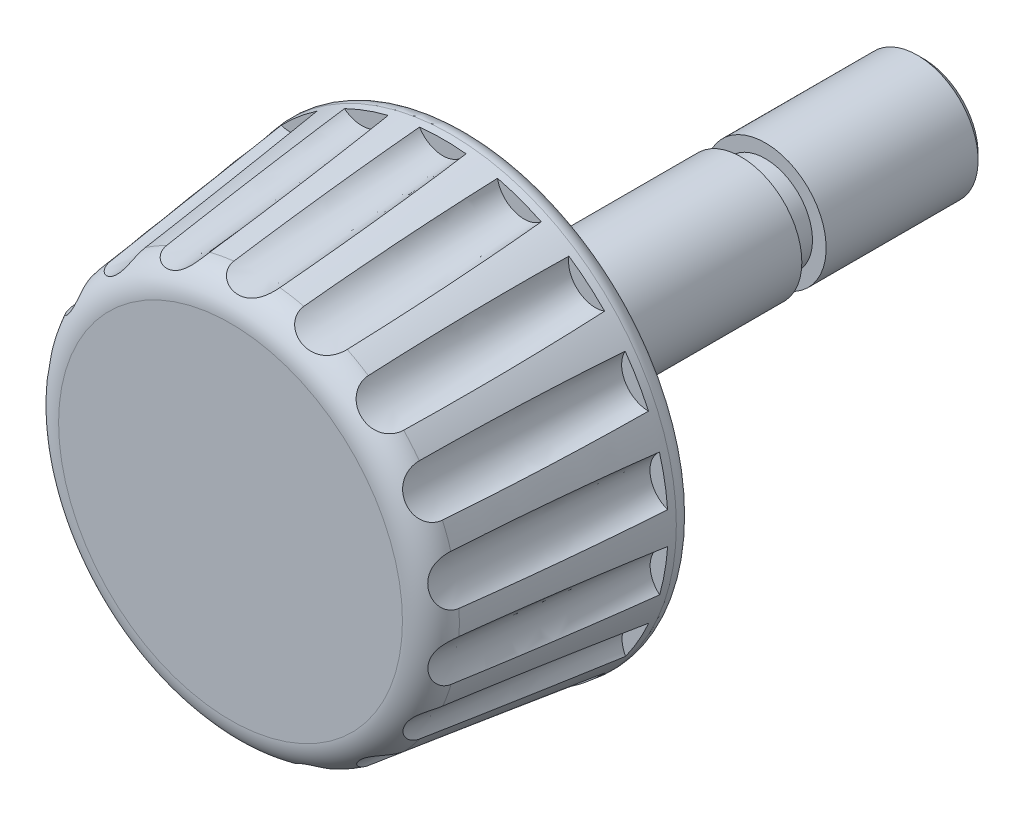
ISO-10303-21;
HEADER;
FILE_DESCRIPTION(('STEP AP214'),'2;1');
FILE_NAME('part.step','',(''),(''),'','','');
FILE_SCHEMA(('AUTOMOTIVE_DESIGN { 1 0 10303 214 1 1 1 1 }'));
ENDSEC;
DATA;
#1=APPLICATION_CONTEXT('core data for automotive mechanical design processes');
#2=APPLICATION_PROTOCOL_DEFINITION('international standard','automotive_design',2000,#1);
#3=PRODUCT_CONTEXT('',#1,'mechanical');
#4=PRODUCT('Part','Part','',(#3));
#5=PRODUCT_RELATED_PRODUCT_CATEGORY('part','',(#4));
#6=PRODUCT_DEFINITION_FORMATION('','',#4);
#7=PRODUCT_DEFINITION_CONTEXT('part definition',#1,'design');
#8=PRODUCT_DEFINITION('design','',#6,#7);
#9=PRODUCT_DEFINITION_SHAPE('','',#8);
#10=(LENGTH_UNIT() NAMED_UNIT(*) SI_UNIT(.MILLI.,.METRE.));
#11=(NAMED_UNIT(*) PLANE_ANGLE_UNIT() SI_UNIT($,.RADIAN.));
#12=(NAMED_UNIT(*) SI_UNIT($,.STERADIAN.) SOLID_ANGLE_UNIT());
#13=UNCERTAINTY_MEASURE_WITH_UNIT(LENGTH_MEASURE(1.E-05),#10,'distance_accuracy_value','');
#14=(GEOMETRIC_REPRESENTATION_CONTEXT(3) GLOBAL_UNCERTAINTY_ASSIGNED_CONTEXT((#13)) GLOBAL_UNIT_ASSIGNED_CONTEXT((#10,
#11,#12)) REPRESENTATION_CONTEXT('',''));
#15=CARTESIAN_POINT('',(0.,0.,0.));
#16=DIRECTION('',(0.,0.,1.));
#17=DIRECTION('',(1.,0.,0.));
#18=AXIS2_PLACEMENT_3D('',#15,#16,#17);
#19=CARTESIAN_POINT('',(0.,0.,-15.));
#20=DIRECTION('',(0.,0.,1.));
#21=DIRECTION('',(1.,0.,0.));
#22=AXIS2_PLACEMENT_3D('',#19,#20,#21);
#23=CYLINDRICAL_SURFACE('',#22,2.);
#24=CARTESIAN_POINT('',(0.,0.,-9.));
#25=DIRECTION('',(0.,0.,1.));
#26=DIRECTION('',(1.,0.,0.));
#27=AXIS2_PLACEMENT_3D('',#24,#25,#26);
#28=CIRCLE('',#27,2.);
#29=CARTESIAN_POINT('',(2.,0.,-9.));
#30=VERTEX_POINT('',#29);
#31=EDGE_CURVE('E283',#30,#30,#28,.T.);
#32=ORIENTED_EDGE('',*,*,#31,.T.);
#33=EDGE_LOOP('',(#32));
#34=FACE_BOUND('',#33,.T.);
#35=CARTESIAN_POINT('',(0.,0.,0.));
#36=DIRECTION('',(0.,0.,1.));
#37=DIRECTION('',(1.,0.,0.));
#38=AXIS2_PLACEMENT_3D('',#35,#36,#37);
#39=CIRCLE('',#38,2.);
#40=CARTESIAN_POINT('',(2.,0.,0.));
#41=VERTEX_POINT('',#40);
#42=EDGE_CURVE('E780',#41,#41,#39,.F.);
#43=ORIENTED_EDGE('',*,*,#42,.T.);
#44=EDGE_LOOP('',(#43));
#45=FACE_BOUND('',#44,.T.);
#46=ADVANCED_FACE('F31',(#34,#45),#23,.T.);
#47=CARTESIAN_POINT('',(0.,0.,0.));
#48=DIRECTION('',(0.,0.,1.));
#49=DIRECTION('',(1.,0.,0.));
#50=AXIS2_PLACEMENT_3D('',#47,#48,#49);
#51=PLANE('',#50);
#52=CARTESIAN_POINT('',(0.,0.,0.));
#53=DIRECTION('',(0.,0.,1.));
#54=DIRECTION('',(1.,0.,0.));
#55=AXIS2_PLACEMENT_3D('',#52,#53,#54);
#56=CIRCLE('',#55,6.93485280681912);
#57=CARTESIAN_POINT('',(6.93485280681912,0.,0.));
#58=VERTEX_POINT('',#57);
#59=EDGE_CURVE('E11',#58,#58,#56,.F.);
#60=ORIENTED_EDGE('',*,*,#59,.T.);
#61=EDGE_LOOP('',(#60));
#62=FACE_BOUND('',#61,.T.);
#63=ORIENTED_EDGE('',*,*,#42,.F.);
#64=EDGE_LOOP('',(#63));
#65=FACE_BOUND('',#64,.T.);
#66=ADVANCED_FACE('F817',(#62,#65),#51,.F.);
#67=CARTESIAN_POINT('',(0.,0.,0.));
#68=DIRECTION('',(0.,0.,-1.));
#69=DIRECTION('',(1.,0.,0.));
#70=AXIS2_PLACEMENT_3D('',#67,#68,#69);
#71=CONICAL_SURFACE('',#70,7.5,0.122173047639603);
#72=CARTESIAN_POINT('',(0.,0.,0.560934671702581));
#73=DIRECTION('',(0.,0.,1.));
#74=DIRECTION('',(1.,0.,0.));
#75=AXIS2_PLACEMENT_3D('',#72,#73,#74);
#76=CIRCLE('',#75,7.43112588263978);
#77=CARTESIAN_POINT('',(7.43112588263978,0.,0.560934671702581));
#78=VERTEX_POINT('',#77);
#79=EDGE_CURVE('E40',#78,#78,#76,.T.);
#80=ORIENTED_EDGE('',*,*,#79,.T.);
#81=EDGE_LOOP('',(#80));
#82=FACE_BOUND('',#81,.T.);
#83=CARTESIAN_POINT('',(0.,0.,6.92186934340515));
#84=DIRECTION('',(0.,0.,-1.));
#85=DIRECTION('',(-1.,0.,0.));
#86=AXIS2_PLACEMENT_3D('',#83,#84,#85);
#87=CIRCLE('',#86,6.65010131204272);
#88=CARTESIAN_POINT('',(-3.67535515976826,5.54216671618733,6.9218693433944));
#89=VERTEX_POINT('',#88);
#90=CARTESIAN_POINT('',(-2.98278076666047,5.94364083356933,6.92186934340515));
#91=VERTEX_POINT('',#90);
#92=EDGE_CURVE('E959',#89,#91,#87,.T.);
#93=ORIENTED_EDGE('',*,*,#92,.T.);
#94=CARTESIAN_POINT('',(-2.9619377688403,5.91202089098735,7.22816281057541));
#95=CARTESIAN_POINT('',(-2.99244231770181,5.9573335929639,6.78688198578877));
#96=CARTESIAN_POINT('',(-3.02076608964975,6.00374488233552,6.34556300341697));
#97=CARTESIAN_POINT('',(-3.07307662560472,6.09873921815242,5.46297584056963));
#98=CARTESIAN_POINT('',(-3.09706410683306,6.14732190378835,5.02170766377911));
#99=CARTESIAN_POINT('',(-3.1357570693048,6.23532323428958,4.23982769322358));
#100=CARTESIAN_POINT('',(-3.15133180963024,6.27430519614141,3.89920947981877));
#101=CARTESIAN_POINT('',(-3.179792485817,6.35359957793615,3.2180159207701));
#102=CARTESIAN_POINT('',(-3.19267842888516,6.3939119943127,2.87744057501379));
#103=CARTESIAN_POINT('',(-3.21557424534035,6.47594358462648,2.19627313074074));
#104=CARTESIAN_POINT('',(-3.22558338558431,6.51766311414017,1.85568105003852));
#105=CARTESIAN_POINT('',(-3.24235694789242,6.60262740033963,1.17460283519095));
#106=CARTESIAN_POINT('',(-3.24912132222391,6.6458721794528,0.834116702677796));
#107=CARTESIAN_POINT('',(-3.25408102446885,6.689943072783,0.493706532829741));
#108=B_SPLINE_CURVE_WITH_KNOTS('',3,(#94,#95,#96,#97,#98,#99,#100,#101,#102,#103,#104,#105,#106,
#107),.UNSPECIFIED.,.F.,.F.,(4,2,2,2,2,2,4),(0.,1.33394026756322,2.66765969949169,
3.69723340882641,4.72680435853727,5.7566374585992,6.78648570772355),.UNSPECIFIED.);
#109=CARTESIAN_POINT('',(-3.24915122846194,6.6505075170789,0.799999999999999));
#110=VERTEX_POINT('',#109);
#111=EDGE_CURVE('E47',#91,#110,#108,.T.);
#112=ORIENTED_EDGE('',*,*,#111,.T.);
#113=CARTESIAN_POINT('',(0.,0.,0.799999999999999));
#114=DIRECTION('',(0.,0.,1.));
#115=DIRECTION('',(1.,0.,0.));
#116=AXIS2_PLACEMENT_3D('',#113,#114,#115);
#117=CIRCLE('',#116,7.40177235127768);
#118=CARTESIAN_POINT('',(-1.81097558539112,7.17680997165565,0.799999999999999));
#119=VERTEX_POINT('',#118);
#120=EDGE_CURVE('E875',#119,#110,#117,.T.);
#121=ORIENTED_EDGE('',*,*,#120,.F.);
#122=CARTESIAN_POINT('',(-1.83266440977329,7.21011253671,0.493706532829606));
#123=CARTESIAN_POINT('',(-1.81369155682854,7.18177410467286,0.755447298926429));
#124=CARTESIAN_POINT('',(-1.79586425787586,7.15311428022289,1.01723384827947));
#125=CARTESIAN_POINT('',(-1.76231367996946,7.09522689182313,1.5408505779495));
#126=CARTESIAN_POINT('',(-1.74659017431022,7.06599938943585,1.80268075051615));
#127=CARTESIAN_POINT('',(-1.70756830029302,6.98810671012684,2.49463514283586));
#128=CARTESIAN_POINT('',(-1.68589380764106,6.93901807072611,2.92480364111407));
#129=CARTESIAN_POINT('',(-1.64722909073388,6.83967767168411,3.78522186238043));
#130=CARTESIAN_POINT('',(-1.63023894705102,6.78942589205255,4.21547158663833));
#131=CARTESIAN_POINT('',(-1.60069858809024,6.6878358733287,5.07615197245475));
#132=CARTESIAN_POINT('',(-1.58814996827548,6.63649725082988,5.50658264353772));
#133=CARTESIAN_POINT('',(-1.56754051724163,6.53274462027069,6.36740838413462));
#134=CARTESIAN_POINT('',(-1.55947954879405,6.4803306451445,6.79780345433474));
#135=CARTESIAN_POINT('',(-1.55368170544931,6.42737423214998,7.2281628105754));
#136=B_SPLINE_CURVE_WITH_KNOTS('',3,(#122,#123,#124,#125,#126,#127,#128,#129,#130,#131,#132,
#133,#134,#135),.UNSPECIFIED.,.F.,.F.,(4,2,2,2,2,2,4),(0.,0.791852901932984,1.58362040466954,
2.88409624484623,4.1845944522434,5.48555934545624,6.78648445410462),.UNSPECIFIED.);
#137=CARTESIAN_POINT('',(-1.5581714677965,6.46497866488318,6.9218693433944));
#138=VERTEX_POINT('',#137);
#139=EDGE_CURVE('E800',#119,#138,#136,.T.);
#140=ORIENTED_EDGE('',*,*,#139,.T.);
#141=CARTESIAN_POINT('',(-0.770052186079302,6.60536653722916,6.92186934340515));
#142=VERTEX_POINT('',#141);
#143=EDGE_CURVE('E770',#138,#142,#87,.T.);
#144=ORIENTED_EDGE('',*,*,#143,.T.);
#145=CARTESIAN_POINT('',(-0.761280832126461,6.56852478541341,7.22816281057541));
#146=CARTESIAN_POINT('',(-0.774447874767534,6.62153796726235,6.78688198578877));
#147=CARTESIAN_POINT('',(-0.785189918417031,6.67483761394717,6.34556300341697));
#148=CARTESIAN_POINT('',(-0.801855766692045,6.78199434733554,5.46297584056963));
#149=CARTESIAN_POINT('',(-0.80778036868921,6.83585134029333,5.02170766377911));
#150=CARTESIAN_POINT('',(-0.814041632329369,6.93177931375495,4.23982769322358));
#151=CARTESIAN_POINT('',(-0.815344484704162,6.97373725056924,3.89920947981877));
#152=CARTESIAN_POINT('',(-0.814968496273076,7.05798372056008,3.2180159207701));
#153=CARTESIAN_POINT('',(-0.813289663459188,7.10027225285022,2.87744057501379));
#154=CARTESIAN_POINT('',(-0.806748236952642,7.18518756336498,2.19627313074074));
#155=CARTESIAN_POINT('',(-0.801884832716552,7.22781442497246,1.85568105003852));
#156=CARTESIAN_POINT('',(-0.788587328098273,7.31339163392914,1.17460283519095));
#157=CARTESIAN_POINT('',(-0.780153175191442,7.35634198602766,0.834116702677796));
#158=CARTESIAN_POINT('',(-0.769740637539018,7.39945139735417,0.493706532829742));
#159=B_SPLINE_CURVE_WITH_KNOTS('',3,(#145,#146,#147,#148,#149,#150,#151,#152,#153,#154,#155,
#156,#157,#158),.UNSPECIFIED.,.F.,.F.,(4,2,2,2,2,2,4),(0.,1.33394026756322,2.66765969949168,
3.69723340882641,4.72680435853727,5.7566374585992,6.78648570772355),.UNSPECIFIED.);
#160=CARTESIAN_POINT('',(-0.778595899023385,7.36070800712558,0.799999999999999));
#161=VERTEX_POINT('',#160);
#162=EDGE_CURVE('E783',#142,#161,#159,.T.);
#163=ORIENTED_EDGE('',*,*,#162,.T.);
#164=CARTESIAN_POINT('',(0.,0.,0.799999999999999));
#165=DIRECTION('',(0.,0.,1.));
#166=DIRECTION('',(1.,0.,0.));
#167=AXIS2_PLACEMENT_3D('',#164,#165,#166);
#168=CIRCLE('',#167,7.40177235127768);
#169=CARTESIAN_POINT('',(0.752853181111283,7.36338550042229,0.799999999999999));
#170=VERTEX_POINT('',#169);
#171=EDGE_CURVE('E328',#170,#161,#168,.T.);
#172=ORIENTED_EDGE('',*,*,#171,.F.);
#173=CARTESIAN_POINT('',(0.743862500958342,7.4020976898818,0.493706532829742));
#174=CARTESIAN_POINT('',(0.751998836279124,7.36897917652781,0.755447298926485));
#175=CARTESIAN_POINT('',(0.758948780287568,7.33595045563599,1.01723384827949));
#176=CARTESIAN_POINT('',(0.770677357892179,7.27007913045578,1.5408505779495));
#177=CARTESIAN_POINT('',(0.775456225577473,7.23723650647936,1.80268075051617));
#178=CARTESIAN_POINT('',(0.785483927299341,7.15069506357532,2.49463514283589));
#179=CARTESIAN_POINT('',(0.789061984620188,7.09715371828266,2.92480364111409));
#180=CARTESIAN_POINT('',(0.791418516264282,6.9905801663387,3.78522186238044));
#181=CARTESIAN_POINT('',(0.790196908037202,6.93754796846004,4.21547158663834));
#182=CARTESIAN_POINT('',(0.783209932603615,6.83198117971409,5.07615197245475));
#183=CARTESIAN_POINT('',(0.777442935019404,6.77944677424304,5.50658264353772));
#184=CARTESIAN_POINT('',(0.761323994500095,6.67490234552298,6.36740838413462));
#185=CARTESIAN_POINT('',(0.750972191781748,6.62289230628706,6.79780345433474));
#186=CARTESIAN_POINT('',(0.738308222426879,6.57114657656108,7.22816281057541));
#187=B_SPLINE_CURVE_WITH_KNOTS('',3,(#173,#174,#175,#176,#177,#178,#179,#180,#181,#182,#183,
#184,#185,#186),.UNSPECIFIED.,.F.,.F.,(4,2,2,2,2,2,4),(0.,0.791852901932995,1.58362040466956,
2.88409624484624,4.1845944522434,5.48555934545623,6.78648445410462),.UNSPECIFIED.);
#188=CARTESIAN_POINT('',(0.746950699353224,6.60801877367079,6.9218693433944));
#189=VERTEX_POINT('',#188);
#190=EDGE_CURVE('E789',#170,#189,#187,.T.);
#191=ORIENTED_EDGE('',*,*,#190,.T.);
#192=CARTESIAN_POINT('',(1.53555605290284,6.47038755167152,6.92186934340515));
#193=VERTEX_POINT('',#192);
#194=EDGE_CURVE('E289',#189,#193,#87,.T.);
#195=ORIENTED_EDGE('',*,*,#194,.T.);
#196=CARTESIAN_POINT('',(1.53119780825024,6.43276764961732,7.22816281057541));
#197=CARTESIAN_POINT('',(1.53695641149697,6.48708713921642,6.78688198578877));
#198=CARTESIAN_POINT('',(1.54509174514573,6.54084641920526,6.34556300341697));
#199=CARTESIAN_POINT('',(1.56608073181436,6.64724086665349,5.46297584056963));
#200=CARTESIAN_POINT('',(1.57893360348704,6.69987621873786,5.02170766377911));
#201=CARTESIAN_POINT('',(1.60585923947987,6.79216050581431,4.23982769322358));
#202=CARTESIAN_POINT('',(1.61898541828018,6.83203367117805,3.89920947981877));
#203=CARTESIAN_POINT('',(1.64815272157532,6.91107086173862,3.2180159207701));
#204=CARTESIAN_POINT('',(1.66419383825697,6.95023488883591,2.87744057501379));
#205=CARTESIAN_POINT('',(1.69938351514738,7.02779187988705,2.19627313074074));
#206=CARTESIAN_POINT('',(1.71853286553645,7.06618464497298,1.85568105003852));
#207=CARTESIAN_POINT('',(1.76029756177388,7.14205290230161,1.17460283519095));
#208=CARTESIAN_POINT('',(1.78291295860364,7.17952838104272,0.834116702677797));
#209=CARTESIAN_POINT('',(1.80744183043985,7.2164766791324,0.493706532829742));
#210=B_SPLINE_CURVE_WITH_KNOTS('',3,(#196,#197,#198,#199,#200,#201,#202,#203,#204,#205,#206,
#207,#208,#209),.UNSPECIFIED.,.F.,.F.,(4,2,2,2,2,2,4),(0.,1.33394026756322,2.66765969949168,
3.69723340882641,4.72680435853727,5.7566374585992,6.78648570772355),.UNSPECIFIED.);
#211=CARTESIAN_POINT('',(1.78586958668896,7.18309847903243,0.799999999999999));
#212=VERTEX_POINT('',#211);
#213=EDGE_CURVE('E279',#193,#212,#210,.T.);
#214=ORIENTED_EDGE('',*,*,#213,.T.);
#215=CARTESIAN_POINT('',(0.,0.,0.799999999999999));
#216=DIRECTION('',(0.,0.,1.));
#217=DIRECTION('',(1.,0.,0.));
#218=AXIS2_PLACEMENT_3D('',#215,#216,#217);
#219=CIRCLE('',#218,7.40177235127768);
#220=CARTESIAN_POINT('',(3.22587674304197,6.66182806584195,0.799999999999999));
#221=VERTEX_POINT('',#220);
#222=EDGE_CURVE('E267',#221,#212,#219,.T.);
#223=ORIENTED_EDGE('',*,*,#222,.F.);
#224=CARTESIAN_POINT('',(3.2306686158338,6.70128061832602,0.493706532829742));
#225=CARTESIAN_POINT('',(3.22698707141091,6.66737660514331,0.755447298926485));
#226=CARTESIAN_POINT('',(3.22222139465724,6.63396273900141,1.01723384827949));
#227=CARTESIAN_POINT('',(3.21071333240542,6.56805253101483,1.5408505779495));
#228=CARTESIAN_POINT('',(3.2039711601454,6.53555609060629,1.80268075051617));
#229=CARTESIAN_POINT('',(3.18379520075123,6.45080405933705,2.49463514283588));
#230=CARTESIAN_POINT('',(3.16884525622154,6.39926788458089,2.92480364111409));
#231=CARTESIAN_POINT('',(3.13460937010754,6.29831552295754,3.78522186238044));
#232=CARTESIAN_POINT('',(3.11532335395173,6.24889937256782,4.21547158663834));
#233=CARTESIAN_POINT('',(3.07265177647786,6.15208872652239,5.07615197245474));
#234=CARTESIAN_POINT('',(3.04926474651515,6.10469496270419,5.50658264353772));
#235=CARTESIAN_POINT('',(2.99836159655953,6.01196833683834,6.36740838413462));
#236=CARTESIAN_POINT('',(2.97084560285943,5.96663541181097,6.79780345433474));
#237=CARTESIAN_POINT('',(2.94124728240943,5.9223416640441,7.2281628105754));
#238=B_SPLINE_CURVE_WITH_KNOTS('',3,(#224,#225,#226,#227,#228,#229,#230,#231,#232,#233,#234,
#235,#236,#237),.UNSPECIFIED.,.F.,.F.,(4,2,2,2,2,2,4),(0.,0.791852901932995,1.58362040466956,
2.88409624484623,4.1845944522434,5.48555934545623,6.78648445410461),.UNSPECIFIED.);
#239=CARTESIAN_POINT('',(2.96197958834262,5.95403429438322,6.9218693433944));
#240=VERTEX_POINT('',#239);
#241=EDGE_CURVE('E281',#221,#240,#238,.T.);
#242=ORIENTED_EDGE('',*,*,#241,.T.);
#243=CARTESIAN_POINT('',(3.65595356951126,5.55498433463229,6.92186934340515));
#244=VERTEX_POINT('',#243);
#245=EDGE_CURVE('E766',#240,#244,#87,.T.);
#246=ORIENTED_EDGE('',*,*,#245,.T.);
#247=CARTESIAN_POINT('',(3.63899139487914,5.521123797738,7.2281628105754));
#248=CARTESIAN_POINT('',(3.66298107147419,5.57019786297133,6.78688198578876));
#249=CARTESIAN_POINT('',(3.68901254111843,5.61793261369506,6.34556300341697));
#250=CARTESIAN_POINT('',(3.74512478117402,5.7107320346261,5.46297584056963));
#251=CARTESIAN_POINT('',(3.77520488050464,5.75579714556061,5.0217076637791));
#252=CARTESIAN_POINT('',(3.83206978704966,5.83330689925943,4.23982769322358));
#253=CARTESIAN_POINT('',(3.85804178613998,5.86628600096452,3.89920947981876));
#254=CARTESIAN_POINT('',(3.91248239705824,5.93058086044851,3.21801592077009));
#255=CARTESIAN_POINT('',(3.94095100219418,5.96189662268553,2.87744057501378));
#256=CARTESIAN_POINT('',(4.00054453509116,6.022740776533,2.19627313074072));
#257=CARTESIAN_POINT('',(4.03167013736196,6.05226871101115,1.8556810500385));
#258=CARTESIAN_POINT('',(4.09686458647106,6.10927718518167,1.17460283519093));
#259=CARTESIAN_POINT('',(4.13093347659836,6.13675769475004,0.83411670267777));
#260=CARTESIAN_POINT('',(4.16662013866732,6.16308836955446,0.493706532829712));
#261=B_SPLINE_CURVE_WITH_KNOTS('',3,(#247,#248,#249,#250,#251,#252,#253,#254,#255,#256,#257,
#258,#259,#260),.UNSPECIFIED.,.F.,.F.,(4,2,2,2,2,2,4),(0.,1.33394026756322,2.66765969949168,
3.69723340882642,4.72680435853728,5.75663745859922,6.78648570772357),.UNSPECIFIED.);
#262=CARTESIAN_POINT('',(4.13493284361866,6.13910126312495,0.799999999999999));
#263=VERTEX_POINT('',#262);
#264=EDGE_CURVE('E293',#244,#263,#261,.T.);
#265=ORIENTED_EDGE('',*,*,#264,.T.);
#266=CARTESIAN_POINT('',(0.,0.,0.799999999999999));
#267=DIRECTION('',(0.,0.,1.));
#268=DIRECTION('',(1.,0.,0.));
#269=AXIS2_PLACEMENT_3D('',#266,#267,#268);
#270=CIRCLE('',#269,7.40177235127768);
#271=CARTESIAN_POINT('',(5.30981196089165,5.15675584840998,0.799999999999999));
#272=VERTEX_POINT('',#271);
#273=EDGE_CURVE('E274',#272,#263,#270,.T.);
#274=ORIENTED_EDGE('',*,*,#273,.F.);
#275=CARTESIAN_POINT('',(5.32780841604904,5.19219020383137,0.493706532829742));
#276=CARTESIAN_POINT('',(5.31275304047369,5.16159001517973,0.755447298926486));
#277=CARTESIAN_POINT('',(5.2968465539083,5.13182120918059,1.01723384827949));
#278=CARTESIAN_POINT('',(5.26348989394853,5.07382186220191,1.5408505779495));
#279=CARTESIAN_POINT('',(5.24603988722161,5.04559115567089,1.80268075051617));
#280=CARTESIAN_POINT('',(5.19809378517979,4.9728508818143,2.49463514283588));
#281=CARTESIAN_POINT('',(5.16641902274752,4.92953590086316,2.92480364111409));
#282=CARTESIAN_POINT('',(5.09972007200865,4.84638107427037,3.78522186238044));
#283=CARTESIAN_POINT('',(5.06469582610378,4.8065412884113,4.21547158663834));
#284=CARTESIAN_POINT('',(4.99148646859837,4.73016357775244,5.07615197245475));
#285=CARTESIAN_POINT('',(4.95330022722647,4.69362684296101,5.50658264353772));
#286=CARTESIAN_POINT('',(4.87375253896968,4.62390221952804,6.36740838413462));
#287=CARTESIAN_POINT('',(4.83239118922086,4.59071422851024,6.79780345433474));
#288=CARTESIAN_POINT('',(4.78942851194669,4.55921494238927,7.2281628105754));
#289=B_SPLINE_CURVE_WITH_KNOTS('',3,(#275,#276,#277,#278,#279,#280,#281,#282,#283,#284,#285,
#286,#287,#288),.UNSPECIFIED.,.F.,.F.,(4,2,2,2,2,2,4),(0.,0.791852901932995,1.58362040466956,
2.88409624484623,4.1845944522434,5.48555934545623,6.78648445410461),.UNSPECIFIED.);
#290=CARTESIAN_POINT('',(4.81975002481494,4.5819054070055,6.9218693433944));
#291=VERTEX_POINT('',#290);
#292=EDGE_CURVE('E290',#272,#291,#289,.T.);
#293=ORIENTED_EDGE('',*,*,#292,.T.);
#294=CARTESIAN_POINT('',(5.33538912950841,3.96956802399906,6.92186934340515));
#295=VERTEX_POINT('',#294);
#296=EDGE_CURVE('E764',#291,#295,#87,.T.);
#297=ORIENTED_EDGE('',*,*,#296,.T.);
#298=CARTESIAN_POINT('',(5.30786891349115,3.94355093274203,7.22816281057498));
#299=CARTESIAN_POINT('',(5.3471961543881,3.98146051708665,6.78688198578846));
#300=CARTESIAN_POINT('',(5.3879839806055,4.0174132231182,6.34556300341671));
#301=CARTESIAN_POINT('',(5.47245150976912,4.08542463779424,5.46297584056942));
#302=CARTESIAN_POINT('',(5.51613073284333,4.11748399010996,5.0217076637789));
#303=CARTESIAN_POINT('',(5.59607616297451,4.17087039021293,4.2398276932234));
#304=CARTESIAN_POINT('',(5.63176137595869,4.19297766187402,3.8992094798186));
#305=CARTESIAN_POINT('',(5.70490895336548,4.2347752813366,3.21801592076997));
#306=CARTESIAN_POINT('',(5.74237131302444,4.25446563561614,2.87744057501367));
#307=CARTESIAN_POINT('',(5.81918084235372,4.29125824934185,2.19627313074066));
#308=CARTESIAN_POINT('',(5.85852848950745,4.30835984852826,1.85568105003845));
#309=CARTESIAN_POINT('',(5.93928927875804,4.33963247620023,1.17460283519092));
#310=CARTESIAN_POINT('',(5.98070245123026,4.35380346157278,0.834116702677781));
#311=CARTESIAN_POINT('',(6.02324256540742,4.36634064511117,0.493706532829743));
#312=B_SPLINE_CURVE_WITH_KNOTS('',3,(#298,#299,#300,#301,#302,#303,#304,#305,#306,#307,#308,
#309,#310,#311),.UNSPECIFIED.,.F.,.F.,(4,2,2,2,2,2,4),(0.,1.33394026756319,2.66765969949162,
3.6972334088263,4.7268043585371,5.75663745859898,6.78648570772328),.UNSPECIFIED.);
#313=CARTESIAN_POINT('',(5.98526217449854,4.35463783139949,0.799999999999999));
#314=VERTEX_POINT('',#313);
#315=EDGE_CURVE('E718',#295,#314,#312,.T.);
#316=ORIENTED_EDGE('',*,*,#315,.T.);
#317=CARTESIAN_POINT('',(0.,0.,0.799999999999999));
#318=DIRECTION('',(0.,0.,1.));
#319=DIRECTION('',(1.,0.,0.));
#320=AXIS2_PLACEMENT_3D('',#317,#318,#319);
#321=CIRCLE('',#320,7.40177235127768);
#322=CARTESIAN_POINT('',(6.75330549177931,3.02970277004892,0.799999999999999));
#323=VERTEX_POINT('',#322);
#324=EDGE_CURVE('E755',#323,#314,#321,.T.);
#325=ORIENTED_EDGE('',*,*,#324,.F.);
#326=CARTESIAN_POINT('',(6.78233589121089,3.05684502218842,0.493706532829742));
#327=CARTESIAN_POINT('',(6.75772258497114,3.03323949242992,0.755447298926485));
#328=CARTESIAN_POINT('',(6.73259384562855,3.01070630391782,1.01723384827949));
#329=CARTESIAN_POINT('',(6.68141189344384,2.96761339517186,1.5408505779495));
#330=CARTESIAN_POINT('',(6.65535878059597,2.94705346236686,1.80268075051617));
#331=CARTESIAN_POINT('',(6.58542554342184,2.89509849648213,2.49463514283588));
#332=CARTESIAN_POINT('',(6.54084640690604,2.86522913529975,2.92480364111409));
#333=CARTESIAN_POINT('',(6.44972926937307,2.80990154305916,3.78522186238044));
#334=CARTESIAN_POINT('',(6.40319123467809,2.78444338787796,4.21547158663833));
#335=CARTESIAN_POINT('',(6.30827422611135,2.73771089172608,5.07615197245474));
#336=CARTESIAN_POINT('',(6.25989459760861,2.71643805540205,5.50658264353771));
#337=CARTESIAN_POINT('',(6.16129699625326,2.67812525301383,6.36740838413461));
#338=CARTESIAN_POINT('',(6.11107907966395,2.66108515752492,6.79780345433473));
#339=CARTESIAN_POINT('',(6.05993397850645,2.64617961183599,7.22816281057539));
#340=B_SPLINE_CURVE_WITH_KNOTS('',3,(#326,#327,#328,#329,#330,#331,#332,#333,#334,#335,#336,
#337,#338,#339),.UNSPECIFIED.,.F.,.F.,(4,2,2,2,2,2,4),(0.,0.791852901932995,1.58362040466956,
2.88409624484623,4.1845944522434,5.48555934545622,6.78648445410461),.UNSPECIFIED.);
#341=CARTESIAN_POINT('',(6.09618747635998,2.65713110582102,6.9218693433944));
#342=VERTEX_POINT('',#341);
#343=EDGE_CURVE('E724',#323,#342,#340,.T.);
#344=ORIENTED_EDGE('',*,*,#343,.T.);
#345=CARTESIAN_POINT('',(6.37129801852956,1.90536322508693,6.92186934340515));
#346=VERTEX_POINT('',#345);
#347=EDGE_CURVE('E754',#342,#346,#87,.T.);
#348=ORIENTED_EDGE('',*,*,#347,.T.);
#349=CARTESIAN_POINT('',(6.33653910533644,1.89032762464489,7.22816281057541));
#350=CARTESIAN_POINT('',(6.38646046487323,1.91250027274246,6.78688198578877));
#351=CARTESIAN_POINT('',(6.4370850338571,1.93233450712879,6.34556300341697));
#352=CARTESIAN_POINT('',(6.5397198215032,1.96735473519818,5.46297584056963));
#353=CARTESIAN_POINT('',(6.59172980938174,1.98254149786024,5.02170766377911));
#354=CARTESIAN_POINT('',(6.68511316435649,2.00536535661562,4.23982769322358));
#355=CARTESIAN_POINT('',(6.72620742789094,2.01393433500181,3.89920947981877));
#356=CARTESIAN_POINT('',(6.80923929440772,2.02819330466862,3.2180159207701));
#357=CARTESIAN_POINT('',(6.8511768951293,2.03388330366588,2.87744057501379));
#358=CARTESIAN_POINT('',(6.93593805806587,2.04218664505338,2.19627313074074));
#359=CARTESIAN_POINT('',(6.97876184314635,2.04479920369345,1.85568105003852));
#360=CARTESIAN_POINT('',(7.06534802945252,2.0465640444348,1.17460283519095));
#361=CARTESIAN_POINT('',(7.10911044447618,2.04571627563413,0.834116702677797));
#362=CARTESIAN_POINT('',(7.15337304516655,2.04294779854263,0.493706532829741));
#363=B_SPLINE_CURVE_WITH_KNOTS('',3,(#349,#350,#351,#352,#353,#354,#355,#356,#357,#358,#359,
#360,#361,#362),.UNSPECIFIED.,.F.,.F.,(4,2,2,2,2,2,4),(0.,1.33394026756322,2.66765969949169,
3.69723340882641,4.72680435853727,5.7566374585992,6.78648570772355),.UNSPECIFIED.);
#364=CARTESIAN_POINT('',(7.11368055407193,2.04494080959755,0.799999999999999));
#365=VERTEX_POINT('',#364);
#366=EDGE_CURVE('E707',#346,#365,#363,.T.);
#367=ORIENTED_EDGE('',*,*,#366,.T.);
#368=CARTESIAN_POINT('',(0.,0.,0.799999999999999));
#369=DIRECTION('',(0.,0.,1.));
#370=DIRECTION('',(1.,0.,0.));
#371=AXIS2_PLACEMENT_3D('',#368,#369,#370);
#372=CIRCLE('',#371,7.40177235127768);
#373=CARTESIAN_POINT('',(7.38225071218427,0.53722282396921,0.799999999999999));
#374=VERTEX_POINT('',#373);
#375=EDGE_CURVE('E906',#374,#365,#372,.T.);
#376=ORIENTED_EDGE('',*,*,#375,.F.);
#377=CARTESIAN_POINT('',(7.41881356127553,0.55279921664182,0.493706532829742));
#378=CARTESIAN_POINT('',(7.38761105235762,0.539035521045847,0.755447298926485));
#379=CARTESIAN_POINT('',(7.35629095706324,0.526455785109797,1.01723384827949));
#380=CARTESIAN_POINT('',(7.29345701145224,0.503466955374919,1.5408505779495));
#381=CARTESIAN_POINT('',(7.26194318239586,0.493057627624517,1.80268075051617));
#382=CARTESIAN_POINT('',(7.17845779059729,0.468154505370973,2.49463514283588));
#383=CARTESIAN_POINT('',(7.12635118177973,0.455333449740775,2.92480364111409));
#384=CARTESIAN_POINT('',(7.02180592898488,0.434506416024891,3.78522186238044));
#385=CARTESIAN_POINT('',(6.96936727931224,0.426500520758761,4.21547158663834));
#386=CARTESIAN_POINT('',(6.86419101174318,0.415049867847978,5.07615197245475));
#387=CARTESIAN_POINT('',(6.8114532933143,0.411606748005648,5.50658264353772));
#388=CARTESIAN_POINT('',(6.70569810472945,0.409326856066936,6.36740838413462));
#389=CARTESIAN_POINT('',(6.65268064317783,0.410489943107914,6.79780345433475));
#390=CARTESIAN_POINT('',(6.59952197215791,0.413975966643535,7.22816281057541));
#391=B_SPLINE_CURVE_WITH_KNOTS('',3,(#377,#378,#379,#380,#381,#382,#383,#384,#385,#386,#387,
#388,#389,#390),.UNSPECIFIED.,.F.,.F.,(4,2,2,2,2,2,4),(0.,0.791852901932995,1.58362040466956,
2.88409624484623,4.1845944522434,5.48555934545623,6.78648445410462),.UNSPECIFIED.);
#392=CARTESIAN_POINT('',(6.63733474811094,0.411867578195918,6.9218693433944));
#393=VERTEX_POINT('',#392);
#394=EDGE_CURVE('E712',#374,#393,#391,.T.);
#395=ORIENTED_EDGE('',*,*,#394,.T.);
#396=CARTESIAN_POINT('',(6.63873433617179,-0.388656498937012,6.92186934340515));
#397=VERTEX_POINT('',#396);
#398=EDGE_CURVE('E765',#393,#397,#87,.T.);
#399=ORIENTED_EDGE('',*,*,#398,.T.);
#400=CARTESIAN_POINT('',(6.60092916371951,-0.390897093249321,7.22816281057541));
#401=CARTESIAN_POINT('',(6.65542338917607,-0.387135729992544,6.78688198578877));
#402=CARTESIAN_POINT('',(6.70977863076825,-0.385812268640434,6.34556300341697));
#403=CARTESIAN_POINT('',(6.81820140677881,-0.388007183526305,5.46297584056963));
#404=CARTESIAN_POINT('',(6.87226898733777,-0.391524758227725,5.02170766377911));
#405=CARTESIAN_POINT('',(6.96782685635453,-0.402016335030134,4.23982769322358));
#406=CARTESIAN_POINT('',(7.00937359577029,-0.408019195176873,3.89920947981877));
#407=CARTESIAN_POINT('',(7.0922748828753,-0.42301871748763,3.2180159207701));
#408=CARTESIAN_POINT('',(7.1336294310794,-0.432015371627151,2.87744057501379));
#409=CARTESIAN_POINT('',(7.21611878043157,-0.453202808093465,2.19627313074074));
#410=CARTESIAN_POINT('',(7.25725352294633,-0.465394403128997,1.85568105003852));
#411=CARTESIAN_POINT('',(7.33922153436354,-0.493350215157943,1.17460283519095));
#412=CARTESIAN_POINT('',(7.38005479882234,-0.509114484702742,0.834116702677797));
#413=CARTESIAN_POINT('',(7.42070116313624,-0.526854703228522,0.493706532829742));
#414=B_SPLINE_CURVE_WITH_KNOTS('',3,(#400,#401,#402,#403,#404,#405,#406,#407,#408,#409,#410,
#411,#412,#413),.UNSPECIFIED.,.F.,.F.,(4,2,2,2,2,2,4),(0.,1.33394026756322,2.66765969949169,
3.69723340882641,4.72680435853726,5.75663745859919,6.78648570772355),.UNSPECIFIED.);
#415=CARTESIAN_POINT('',(7.38408407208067,-0.511406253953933,0.799999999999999));
#416=VERTEX_POINT('',#415);
#417=EDGE_CURVE('E678',#397,#416,#414,.T.);
#418=ORIENTED_EDGE('',*,*,#417,.T.);
#419=CARTESIAN_POINT('',(0.,0.,0.799999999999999));
#420=DIRECTION('',(0.,0.,1.));
#421=DIRECTION('',(1.,0.,0.));
#422=AXIS2_PLACEMENT_3D('',#419,#420,#421);
#423=CIRCLE('',#422,7.40177235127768);
#424=CARTESIAN_POINT('',(7.12078754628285,-2.02005412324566,0.799999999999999));
#425=VERTEX_POINT('',#424);
#426=EDGE_CURVE('E904',#425,#416,#423,.T.);
#427=ORIENTED_EDGE('',*,*,#426,.F.);
#428=CARTESIAN_POINT('',(7.16047282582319,-2.01792233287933,0.493706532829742));
#429=CARTESIAN_POINT('',(7.12644459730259,-2.02018408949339,0.755447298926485));
#430=CARTESIAN_POINT('',(7.09271081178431,-2.02129307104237,1.01723384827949));
#431=CARTESIAN_POINT('',(7.02580357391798,-2.02140502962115,1.5408505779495));
#432=CARTESIAN_POINT('',(6.99263006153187,-2.02040823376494,1.80268075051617));
#433=CARTESIAN_POINT('',(6.90566208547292,-2.01525582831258,2.49463514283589));
#434=CARTESIAN_POINT('',(6.85231283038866,-2.00948216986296,2.92480364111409));
#435=CARTESIAN_POINT('',(6.74694916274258,-1.99329659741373,3.78522186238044));
#436=CARTESIAN_POINT('',(6.69493477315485,-1.98288460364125,4.21547158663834));
#437=CARTESIAN_POINT('',(6.59218505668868,-1.95767229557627,5.07615197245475));
#438=CARTESIAN_POINT('',(6.54145019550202,-1.94287040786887,5.50658264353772));
#439=CARTESIAN_POINT('',(6.44129305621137,-1.90884240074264,6.36740838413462));
#440=CARTESIAN_POINT('',(6.39187073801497,-1.88961641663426,6.79780345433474));
#441=CARTESIAN_POINT('',(6.34311021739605,-1.86815928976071,7.22816281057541));
#442=B_SPLINE_CURVE_WITH_KNOTS('',3,(#428,#429,#430,#431,#432,#433,#434,#435,#436,#437,#438,
#439,#440,#441),.UNSPECIFIED.,.F.,.F.,(4,2,2,2,2,2,4),(0.,0.791852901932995,1.58362040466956,
2.88409624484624,4.1845944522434,5.48555934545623,6.78648445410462),.UNSPECIFIED.);
#443=CARTESIAN_POINT('',(6.37792149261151,-1.88307325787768,6.9218693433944));
#444=VERTEX_POINT('',#443);
#445=EDGE_CURVE('E684',#425,#444,#442,.T.);
#446=ORIENTED_EDGE('',*,*,#445,.T.);
#447=CARTESIAN_POINT('',(6.10544131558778,-2.63579851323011,6.92186934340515));
#448=VERTEX_POINT('',#447);
#449=EDGE_CURVE('E768',#444,#448,#87,.T.);
#450=ORIENTED_EDGE('',*,*,#449,.T.);
#451=CARTESIAN_POINT('',(6.0691497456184,-2.62497385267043,7.22816281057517));
#452=CARTESIAN_POINT('',(6.12164402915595,-2.64007745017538,6.7868819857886));
#453=CARTESIAN_POINT('',(6.17317389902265,-2.65742439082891,6.34556300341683));
#454=CARTESIAN_POINT('',(6.27430727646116,-2.69656970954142,5.46297584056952));
#455=CARTESIAN_POINT('',(6.32391110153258,-2.71836735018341,5.021707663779));
#456=CARTESIAN_POINT('',(6.41011779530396,-2.76090892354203,4.23982769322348));
#457=CARTESIAN_POINT('',(6.44710586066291,-2.78075958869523,3.89920947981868));
#458=CARTESIAN_POINT('',(6.51987744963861,-2.8232084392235,3.21801592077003));
#459=CARTESIAN_POINT('',(6.55566097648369,-2.84580661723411,2.87744057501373));
#460=CARTESIAN_POINT('',(6.62592907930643,-2.89392931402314,2.1962731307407));
#461=CARTESIAN_POINT('',(6.66041332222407,-2.91945457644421,1.85568105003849));
#462=CARTESIAN_POINT('',(6.72787660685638,-2.97375915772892,1.17460283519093));
#463=CARTESIAN_POINT('',(6.76085562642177,-3.0025385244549,0.83411670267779));
#464=CARTESIAN_POINT('',(6.79298320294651,-3.03311075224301,0.493706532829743));
#465=B_SPLINE_CURVE_WITH_KNOTS('',3,(#451,#452,#453,#454,#455,#456,#457,#458,#459,#460,#461,
#462,#463,#464),.UNSPECIFIED.,.F.,.F.,(4,2,2,2,2,2,4),(0.,1.3339402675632,2.66765969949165,
3.69723340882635,4.72680435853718,5.75663745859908,6.7864857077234),.UNSPECIFIED.);
#466=CARTESIAN_POINT('',(6.763858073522,-3.0060701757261,0.799999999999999));
#467=VERTEX_POINT('',#466);
#468=EDGE_CURVE('E667',#448,#467,#465,.T.);
#469=ORIENTED_EDGE('',*,*,#468,.T.);
#470=CARTESIAN_POINT('',(0.,0.,0.799999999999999));
#471=DIRECTION('',(0.,0.,1.));
#472=DIRECTION('',(1.,0.,0.));
#473=AXIS2_PLACEMENT_3D('',#470,#471,#472);
#474=CIRCLE('',#473,7.40177235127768);
#475=CARTESIAN_POINT('',(6.00045231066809,-4.3336827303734,0.799999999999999));
#476=VERTEX_POINT('',#475);
#477=EDGE_CURVE('E902',#476,#467,#474,.T.);
#478=ORIENTED_EDGE('',*,*,#477,.F.);
#479=CARTESIAN_POINT('',(6.03847339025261,-4.3452526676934,0.493706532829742));
#480=CARTESIAN_POINT('',(6.00572374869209,-4.33573968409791,0.755447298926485));
#481=CARTESIAN_POINT('',(5.97364506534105,-4.3252441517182,1.01723384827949));
#482=CARTESIAN_POINT('',(5.91073453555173,-4.30246573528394,1.5408505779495));
#483=CARTESIAN_POINT('',(5.87990255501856,-4.29018304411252,1.80268075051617));
#484=CARTESIAN_POINT('',(5.79994161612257,-4.25559656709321,2.49463514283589));
#485=CARTESIAN_POINT('',(5.75178442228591,-4.23192458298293,2.92480364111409));
#486=CARTESIAN_POINT('',(5.65831075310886,-4.18067862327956,3.78522186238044));
#487=CARTESIAN_POINT('',(5.61299432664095,-4.15310458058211,4.21547158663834));
#488=CARTESIAN_POINT('',(5.5250642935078,-4.09427028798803,5.07615197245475));
#489=CARTESIAN_POINT('',(5.48245166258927,-4.06300871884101,5.50658264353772));
#490=CARTESIAN_POINT('',(5.39997300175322,-3.99677709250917,6.36740838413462));
#491=CARTESIAN_POINT('',(5.36010688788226,-3.96180714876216,6.79780345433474));
#492=CARTESIAN_POINT('',(5.32162575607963,-3.9249669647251,7.2281628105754));
#493=B_SPLINE_CURVE_WITH_KNOTS('',3,(#479,#480,#481,#482,#483,#484,#485,#486,#487,#488,#489,
#490,#491,#492),.UNSPECIFIED.,.F.,.F.,(4,2,2,2,2,2,4),(0.,0.791852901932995,1.58362040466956,
2.88409624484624,4.1845944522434,5.48555934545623,6.78648445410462),.UNSPECIFIED.);
#494=CARTESIAN_POINT('',(5.34923677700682,-3.95088766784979,6.9218693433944));
#495=VERTEX_POINT('',#494);
#496=EDGE_CURVE('E672',#476,#495,#493,.T.);
#497=ORIENTED_EDGE('',*,*,#496,.T.);
#498=CARTESIAN_POINT('',(4.83574196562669,-4.5650243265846,6.92186934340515));
#499=VERTEX_POINT('',#498);
#500=EDGE_CURVE('E1298',#495,#499,#87,.T.);
#501=ORIENTED_EDGE('',*,*,#500,.T.);
#502=CARTESIAN_POINT('',(4.80534129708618,-4.54244002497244,7.2281628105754));
#503=CARTESIAN_POINT('',(4.84950405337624,-4.57458686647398,6.78688198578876));
#504=CARTESIAN_POINT('',(4.89199328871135,-4.60851191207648,6.34556300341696));
#505=CARTESIAN_POINT('',(4.97363908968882,-4.67988613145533,5.46297584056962));
#506=CARTESIAN_POINT('',(5.01279620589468,-4.71733472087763,5.0217076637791));
#507=CARTESIAN_POINT('',(5.0792539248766,-4.7867951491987,4.23982769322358));
#508=CARTESIAN_POINT('',(5.10722200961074,-4.81809933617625,3.89920947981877));
#509=CARTESIAN_POINT('',(5.16108657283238,-4.88287755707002,3.2180159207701));
#510=CARTESIAN_POINT('',(5.18698305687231,-4.91635158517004,2.87744057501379));
#511=CARTESIAN_POINT('',(5.23655454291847,-4.98560523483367,2.19627313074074));
#512=CARTESIAN_POINT('',(5.26022897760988,-5.02138544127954,1.85568105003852));
#513=CARTESIAN_POINT('',(5.30505046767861,-5.09548885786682,1.17460283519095));
#514=CARTESIAN_POINT('',(5.32619748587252,-5.13381210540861,0.834116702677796));
#515=CARTESIAN_POINT('',(5.34593121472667,-5.17352888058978,0.493706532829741));
#516=B_SPLINE_CURVE_WITH_KNOTS('',3,(#502,#503,#504,#505,#506,#507,#508,#509,#510,#511,#512,
#513,#514,#515),.UNSPECIFIED.,.F.,.F.,(4,2,2,2,2,2,4),(0.,1.33394026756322,2.66765969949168,
3.69723340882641,4.72680435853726,5.75663745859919,6.78648570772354),.UNSPECIFIED.);
#517=CARTESIAN_POINT('',(5.32781096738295,-5.13815766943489,0.799999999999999));
#518=VERTEX_POINT('',#517);
#519=EDGE_CURVE('E638',#499,#518,#516,.T.);
#520=ORIENTED_EDGE('',*,*,#519,.T.);
#521=CARTESIAN_POINT('',(0.,0.,0.799999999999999));
#522=DIRECTION('',(0.,0.,1.));
#523=DIRECTION('',(1.,0.,0.));
#524=AXIS2_PLACEMENT_3D('',#521,#522,#523);
#525=CIRCLE('',#524,7.40177235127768);
#526=CARTESIAN_POINT('',(4.15637396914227,-6.12460524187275,0.799999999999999));
#527=VERTEX_POINT('',#526);
#528=EDGE_CURVE('E900',#527,#518,#525,.T.);
#529=ORIENTED_EDGE('',*,*,#528,.F.);
#530=CARTESIAN_POINT('',(4.18814494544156,-6.14848140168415,0.493706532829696));
#531=CARTESIAN_POINT('',(4.16062398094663,-6.12834108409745,0.75544729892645));
#532=CARTESIAN_POINT('',(4.13406956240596,-6.10750695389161,1.01723384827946));
#533=CARTESIAN_POINT('',(4.08274367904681,-6.06458557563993,1.54085057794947));
#534=CARTESIAN_POINT('',(4.05797202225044,-6.04249846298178,1.80268075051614));
#535=CARTESIAN_POINT('',(3.99466258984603,-5.98264955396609,2.49463514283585));
#536=CARTESIAN_POINT('',(3.95750592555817,-5.94393443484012,2.92480364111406));
#537=CARTESIAN_POINT('',(3.88719655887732,-5.86380910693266,3.78522186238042));
#538=CARTESIAN_POINT('',(3.85404392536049,-5.82239885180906,4.21547158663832));
#539=CARTESIAN_POINT('',(3.7915392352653,-5.73703885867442,5.07615197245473));
#540=CARTESIAN_POINT('',(3.76218854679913,-5.69308821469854,5.50658264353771));
#541=CARTESIAN_POINT('',(3.7073365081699,-5.60264148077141,6.36740838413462));
#542=CARTESIAN_POINT('',(3.68183504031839,-5.55614546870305,6.79780345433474));
#543=CARTESIAN_POINT('',(3.65827468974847,-5.50836569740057,7.2281628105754));
#544=B_SPLINE_CURVE_WITH_KNOTS('',3,(#530,#531,#532,#533,#534,#535,#536,#537,#538,#539,#540,
#541,#542,#543),.UNSPECIFIED.,.F.,.F.,(4,2,2,2,2,2,4),(0.,0.791852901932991,1.58362040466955,
2.88409624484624,4.18459445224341,5.48555934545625,6.78648445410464),.UNSPECIFIED.);
#545=CARTESIAN_POINT('',(3.6753551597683,-5.54216671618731,6.9218693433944));
#546=VERTEX_POINT('',#545);
#547=EDGE_CURVE('E644',#527,#546,#544,.T.);
#548=ORIENTED_EDGE('',*,*,#547,.T.);
#549=CARTESIAN_POINT('',(2.98278076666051,-5.94364083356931,6.92186934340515));
#550=VERTEX_POINT('',#549);
#551=EDGE_CURVE('E1295',#546,#550,#87,.T.);
#552=ORIENTED_EDGE('',*,*,#551,.T.);
#553=CARTESIAN_POINT('',(2.96193776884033,-5.91202089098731,7.2281628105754));
#554=CARTESIAN_POINT('',(2.99244231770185,-5.95733359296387,6.78688198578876));
#555=CARTESIAN_POINT('',(3.02076608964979,-6.00374488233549,6.34556300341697));
#556=CARTESIAN_POINT('',(3.07307662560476,-6.0987392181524,5.46297584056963));
#557=CARTESIAN_POINT('',(3.0970641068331,-6.14732190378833,5.0217076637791));
#558=CARTESIAN_POINT('',(3.13575706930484,-6.23532323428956,4.23982769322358));
#559=CARTESIAN_POINT('',(3.15133180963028,-6.27430519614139,3.89920947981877));
#560=CARTESIAN_POINT('',(3.17979248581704,-6.35359957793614,3.2180159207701));
#561=CARTESIAN_POINT('',(3.1926784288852,-6.39391199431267,2.87744057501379));
#562=CARTESIAN_POINT('',(3.21557424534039,-6.47594358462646,2.19627313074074));
#563=CARTESIAN_POINT('',(3.22558338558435,-6.51766311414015,1.85568105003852));
#564=CARTESIAN_POINT('',(3.24235694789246,-6.60262740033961,1.17460283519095));
#565=CARTESIAN_POINT('',(3.24912132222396,-6.64587217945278,0.834116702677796));
#566=CARTESIAN_POINT('',(3.2540810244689,-6.68994307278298,0.493706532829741));
#567=B_SPLINE_CURVE_WITH_KNOTS('',3,(#553,#554,#555,#556,#557,#558,#559,#560,#561,#562,#563,
#564,#565,#566),.UNSPECIFIED.,.F.,.F.,(4,2,2,2,2,2,4),(0.,1.33394026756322,2.66765969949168,
3.69723340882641,4.72680435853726,5.75663745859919,6.78648570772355),.UNSPECIFIED.);
#568=CARTESIAN_POINT('',(3.24915122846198,-6.65050751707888,0.799999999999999));
#569=VERTEX_POINT('',#568);
#570=EDGE_CURVE('E627',#550,#569,#567,.T.);
#571=ORIENTED_EDGE('',*,*,#570,.T.);
#572=CARTESIAN_POINT('',(0.,0.,0.799999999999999));
#573=DIRECTION('',(0.,0.,1.));
#574=DIRECTION('',(1.,0.,0.));
#575=AXIS2_PLACEMENT_3D('',#572,#573,#574);
#576=CIRCLE('',#575,7.40177235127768);
#577=CARTESIAN_POINT('',(1.81097558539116,-7.17680997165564,0.799999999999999));
#578=VERTEX_POINT('',#577);
#579=EDGE_CURVE('E898',#578,#569,#576,.T.);
#580=ORIENTED_EDGE('',*,*,#579,.F.);
#581=CARTESIAN_POINT('',(1.83266440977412,-7.2101125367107,0.493706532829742));
#582=CARTESIAN_POINT('',(1.81369155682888,-7.18177410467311,0.755447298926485));
#583=CARTESIAN_POINT('',(1.79586425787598,-7.15311428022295,1.01723384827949));
#584=CARTESIAN_POINT('',(1.76231367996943,-7.09522689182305,1.5408505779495));
#585=CARTESIAN_POINT('',(1.74659017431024,-7.06599938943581,1.80268075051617));
#586=CARTESIAN_POINT('',(1.7075683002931,-6.98810671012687,2.49463514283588));
#587=CARTESIAN_POINT('',(1.68589380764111,-6.93901807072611,2.92480364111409));
#588=CARTESIAN_POINT('',(1.64722909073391,-6.83967767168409,3.78522186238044));
#589=CARTESIAN_POINT('',(1.63023894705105,-6.78942589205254,4.21547158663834));
#590=CARTESIAN_POINT('',(1.60069858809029,-6.6878358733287,5.07615197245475));
#591=CARTESIAN_POINT('',(1.58814996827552,-6.63649725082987,5.50658264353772));
#592=CARTESIAN_POINT('',(1.56754051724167,-6.53274462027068,6.36740838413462));
#593=CARTESIAN_POINT('',(1.55947954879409,-6.48033064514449,6.79780345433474));
#594=CARTESIAN_POINT('',(1.55368170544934,-6.42737423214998,7.2281628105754));
#595=B_SPLINE_CURVE_WITH_KNOTS('',3,(#581,#582,#583,#584,#585,#586,#587,#588,#589,#590,#591,
#592,#593,#594),.UNSPECIFIED.,.F.,.F.,(4,2,2,2,2,2,4),(0.,0.791852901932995,1.58362040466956,
2.88409624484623,4.1845944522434,5.48555934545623,6.78648445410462),.UNSPECIFIED.);
#596=CARTESIAN_POINT('',(1.55817146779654,-6.46497866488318,6.9218693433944));
#597=VERTEX_POINT('',#596);
#598=EDGE_CURVE('E632',#578,#597,#595,.T.);
#599=ORIENTED_EDGE('',*,*,#598,.T.);
#600=CARTESIAN_POINT('',(0.770052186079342,-6.60536653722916,6.92186934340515));
#601=VERTEX_POINT('',#600);
#602=EDGE_CURVE('E1291',#597,#601,#87,.T.);
#603=ORIENTED_EDGE('',*,*,#602,.T.);
#604=CARTESIAN_POINT('',(0.7612808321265,-6.56852478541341,7.22816281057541));
#605=CARTESIAN_POINT('',(0.774447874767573,-6.62153796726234,6.78688198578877));
#606=CARTESIAN_POINT('',(0.785189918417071,-6.67483761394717,6.34556300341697));
#607=CARTESIAN_POINT('',(0.801855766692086,-6.78199434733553,5.46297584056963));
#608=CARTESIAN_POINT('',(0.807780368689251,-6.83585134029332,5.02170766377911));
#609=CARTESIAN_POINT('',(0.814041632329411,-6.93177931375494,4.23982769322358));
#610=CARTESIAN_POINT('',(0.815344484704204,-6.97373725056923,3.89920947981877));
#611=CARTESIAN_POINT('',(0.814968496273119,-7.05798372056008,3.2180159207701));
#612=CARTESIAN_POINT('',(0.813289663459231,-7.10027225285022,2.87744057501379));
#613=CARTESIAN_POINT('',(0.806748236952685,-7.18518756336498,2.19627313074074));
#614=CARTESIAN_POINT('',(0.801884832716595,-7.22781442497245,1.85568105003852));
#615=CARTESIAN_POINT('',(0.788587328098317,-7.31339163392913,1.17460283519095));
#616=CARTESIAN_POINT('',(0.780153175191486,-7.35634198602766,0.834116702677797));
#617=CARTESIAN_POINT('',(0.769740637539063,-7.39945139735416,0.493706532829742));
#618=B_SPLINE_CURVE_WITH_KNOTS('',3,(#604,#605,#606,#607,#608,#609,#610,#611,#612,#613,#614,
#615,#616,#617),.UNSPECIFIED.,.F.,.F.,(4,2,2,2,2,2,4),(0.,1.33394026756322,2.66765969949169,
3.69723340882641,4.72680435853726,5.75663745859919,6.78648570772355),.UNSPECIFIED.);
#619=CARTESIAN_POINT('',(0.77859589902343,-7.36070800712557,0.799999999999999));
#620=VERTEX_POINT('',#619);
#621=EDGE_CURVE('E598',#601,#620,#618,.T.);
#622=ORIENTED_EDGE('',*,*,#621,.T.);
#623=CARTESIAN_POINT('',(0.,0.,0.799999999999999));
#624=DIRECTION('',(0.,0.,1.));
#625=DIRECTION('',(1.,0.,0.));
#626=AXIS2_PLACEMENT_3D('',#623,#624,#625);
#627=CIRCLE('',#626,7.40177235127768);
#628=CARTESIAN_POINT('',(-0.752853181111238,-7.3633855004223,0.799999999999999));
#629=VERTEX_POINT('',#628);
#630=EDGE_CURVE('E896',#629,#620,#627,.T.);
#631=ORIENTED_EDGE('',*,*,#630,.F.);
#632=CARTESIAN_POINT('',(-0.743862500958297,-7.40209768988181,0.493706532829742));
#633=CARTESIAN_POINT('',(-0.751998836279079,-7.36897917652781,0.755447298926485));
#634=CARTESIAN_POINT('',(-0.758948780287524,-7.335950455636,1.01723384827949));
#635=CARTESIAN_POINT('',(-0.770677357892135,-7.27007913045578,1.5408505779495));
#636=CARTESIAN_POINT('',(-0.775456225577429,-7.23723650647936,1.80268075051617));
#637=CARTESIAN_POINT('',(-0.785483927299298,-7.15069506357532,2.49463514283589));
#638=CARTESIAN_POINT('',(-0.789061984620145,-7.09715371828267,2.92480364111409));
#639=CARTESIAN_POINT('',(-0.79141851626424,-6.99058016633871,3.78522186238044));
#640=CARTESIAN_POINT('',(-0.790196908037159,-6.93754796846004,4.21547158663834));
#641=CARTESIAN_POINT('',(-0.783209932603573,-6.83198117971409,5.07615197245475));
#642=CARTESIAN_POINT('',(-0.777442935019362,-6.77944677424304,5.50658264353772));
#643=CARTESIAN_POINT('',(-0.761323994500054,-6.67490234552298,6.36740838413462));
#644=CARTESIAN_POINT('',(-0.750972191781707,-6.62289230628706,6.79780345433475));
#645=CARTESIAN_POINT('',(-0.738308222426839,-6.57114657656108,7.22816281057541));
#646=B_SPLINE_CURVE_WITH_KNOTS('',3,(#632,#633,#634,#635,#636,#637,#638,#639,#640,#641,#642,
#643,#644,#645),.UNSPECIFIED.,.F.,.F.,(4,2,2,2,2,2,4),(0.,0.791852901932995,1.58362040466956,
2.88409624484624,4.1845944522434,5.48555934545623,6.78648445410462),.UNSPECIFIED.);
#647=CARTESIAN_POINT('',(-0.746950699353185,-6.60801877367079,6.9218693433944));
#648=VERTEX_POINT('',#647);
#649=EDGE_CURVE('E604',#629,#648,#646,.T.);
#650=ORIENTED_EDGE('',*,*,#649,.T.);
#651=CARTESIAN_POINT('',(-1.53555605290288,-6.47038755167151,6.92186934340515));
#652=VERTEX_POINT('',#651);
#653=EDGE_CURVE('E1288',#648,#652,#87,.T.);
#654=ORIENTED_EDGE('',*,*,#653,.T.);
#655=CARTESIAN_POINT('',(-1.53119780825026,-6.43276764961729,7.2281628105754));
#656=CARTESIAN_POINT('',(-1.536956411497,-6.4870871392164,6.78688198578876));
#657=CARTESIAN_POINT('',(-1.54509174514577,-6.54084641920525,6.34556300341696));
#658=CARTESIAN_POINT('',(-1.5660807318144,-6.64724086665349,5.46297584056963));
#659=CARTESIAN_POINT('',(-1.57893360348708,-6.69987621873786,5.0217076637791));
#660=CARTESIAN_POINT('',(-1.60585923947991,-6.7921605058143,4.23982769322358));
#661=CARTESIAN_POINT('',(-1.61898541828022,-6.83203367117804,3.89920947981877));
#662=CARTESIAN_POINT('',(-1.64815272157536,-6.91107086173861,3.2180159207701));
#663=CARTESIAN_POINT('',(-1.66419383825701,-6.9502348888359,2.87744057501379));
#664=CARTESIAN_POINT('',(-1.69938351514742,-7.02779187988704,2.19627313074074));
#665=CARTESIAN_POINT('',(-1.71853286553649,-7.06618464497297,1.85568105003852));
#666=CARTESIAN_POINT('',(-1.76029756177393,-7.1420529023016,1.17460283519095));
#667=CARTESIAN_POINT('',(-1.78291295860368,-7.17952838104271,0.834116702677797));
#668=CARTESIAN_POINT('',(-1.8074418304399,-7.21647667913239,0.493706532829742));
#669=B_SPLINE_CURVE_WITH_KNOTS('',3,(#655,#656,#657,#658,#659,#660,#661,#662,#663,#664,#665,
#666,#667,#668),.UNSPECIFIED.,.F.,.F.,(4,2,2,2,2,2,4),(0.,1.33394026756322,2.66765969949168,
3.69723340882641,4.72680435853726,5.75663745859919,6.78648570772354),.UNSPECIFIED.);
#670=CARTESIAN_POINT('',(-1.785869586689,-7.18309847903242,0.799999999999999));
#671=VERTEX_POINT('',#670);
#672=EDGE_CURVE('E587',#652,#671,#669,.T.);
#673=ORIENTED_EDGE('',*,*,#672,.T.);
#674=CARTESIAN_POINT('',(0.,0.,0.799999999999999));
#675=DIRECTION('',(0.,0.,1.));
#676=DIRECTION('',(1.,0.,0.));
#677=AXIS2_PLACEMENT_3D('',#674,#675,#676);
#678=CIRCLE('',#677,7.40177235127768);
#679=CARTESIAN_POINT('',(-3.22587674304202,-6.66182806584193,0.799999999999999));
#680=VERTEX_POINT('',#679);
#681=EDGE_CURVE('E894',#680,#671,#678,.T.);
#682=ORIENTED_EDGE('',*,*,#681,.F.);
#683=CARTESIAN_POINT('',(-3.23066861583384,-6.701280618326,0.493706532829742));
#684=CARTESIAN_POINT('',(-3.22698707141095,-6.66737660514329,0.755447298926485));
#685=CARTESIAN_POINT('',(-3.22222139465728,-6.63396273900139,1.01723384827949));
#686=CARTESIAN_POINT('',(-3.21071333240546,-6.56805253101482,1.5408505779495));
#687=CARTESIAN_POINT('',(-3.20397116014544,-6.53555609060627,1.80268075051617));
#688=CARTESIAN_POINT('',(-3.18379520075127,-6.45080405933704,2.49463514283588));
#689=CARTESIAN_POINT('',(-3.16884525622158,-6.39926788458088,2.92480364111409));
#690=CARTESIAN_POINT('',(-3.13460937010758,-6.29831552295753,3.78522186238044));
#691=CARTESIAN_POINT('',(-3.11532335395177,-6.2488993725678,4.21547158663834));
#692=CARTESIAN_POINT('',(-3.07265177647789,-6.15208872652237,5.07615197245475));
#693=CARTESIAN_POINT('',(-3.04926474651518,-6.10469496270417,5.50658264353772));
#694=CARTESIAN_POINT('',(-2.99836159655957,-6.01196833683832,6.36740838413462));
#695=CARTESIAN_POINT('',(-2.97084560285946,-5.96663541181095,6.79780345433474));
#696=CARTESIAN_POINT('',(-2.94124728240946,-5.92234166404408,7.22816281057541));
#697=B_SPLINE_CURVE_WITH_KNOTS('',3,(#683,#684,#685,#686,#687,#688,#689,#690,#691,#692,#693,
#694,#695,#696),.UNSPECIFIED.,.F.,.F.,(4,2,2,2,2,2,4),(0.,0.791852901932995,1.58362040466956,
2.88409624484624,4.1845944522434,5.48555934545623,6.78648445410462),.UNSPECIFIED.);
#698=CARTESIAN_POINT('',(-2.96197958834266,-5.95403429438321,6.9218693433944));
#699=VERTEX_POINT('',#698);
#700=EDGE_CURVE('E592',#680,#699,#697,.T.);
#701=ORIENTED_EDGE('',*,*,#700,.T.);
#702=CARTESIAN_POINT('',(-3.65595356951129,-5.55498433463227,6.92186934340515));
#703=VERTEX_POINT('',#702);
#704=EDGE_CURVE('E1284',#699,#703,#87,.T.);
#705=ORIENTED_EDGE('',*,*,#704,.T.);
#706=CARTESIAN_POINT('',(-3.63899139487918,-5.521123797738,7.22816281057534));
#707=CARTESIAN_POINT('',(-3.66298107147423,-5.57019786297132,6.7868819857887));
#708=CARTESIAN_POINT('',(-3.68901254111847,-5.61793261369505,6.34556300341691));
#709=CARTESIAN_POINT('',(-3.74512478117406,-5.71073203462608,5.46297584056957));
#710=CARTESIAN_POINT('',(-3.77520488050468,-5.7557971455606,5.02170766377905));
#711=CARTESIAN_POINT('',(-3.8320697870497,-5.83330689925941,4.23982769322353));
#712=CARTESIAN_POINT('',(-3.85804178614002,-5.8662860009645,3.89920947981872));
#713=CARTESIAN_POINT('',(-3.91248239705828,-5.93058086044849,3.21801592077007));
#714=CARTESIAN_POINT('',(-3.94095100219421,-5.96189662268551,2.87744057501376));
#715=CARTESIAN_POINT('',(-4.00054453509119,-6.02274077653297,2.19627313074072));
#716=CARTESIAN_POINT('',(-4.031670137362,-6.05226871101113,1.8556810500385));
#717=CARTESIAN_POINT('',(-4.09686458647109,-6.10927718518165,1.17460283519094));
#718=CARTESIAN_POINT('',(-4.13093347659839,-6.13675769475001,0.834116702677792));
#719=CARTESIAN_POINT('',(-4.16662013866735,-6.16308836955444,0.493706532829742));
#720=B_SPLINE_CURVE_WITH_KNOTS('',3,(#706,#707,#708,#709,#710,#711,#712,#713,#714,#715,#716,
#717,#718,#719),.UNSPECIFIED.,.F.,.F.,(4,2,2,2,2,2,4),(0.,1.33394026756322,2.66765969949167,
3.69723340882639,4.72680435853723,5.75663745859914,6.78648570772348),.UNSPECIFIED.);
#721=CARTESIAN_POINT('',(-4.1349328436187,-6.13910126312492,0.799999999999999));
#722=VERTEX_POINT('',#721);
#723=EDGE_CURVE('E558',#703,#722,#720,.T.);
#724=ORIENTED_EDGE('',*,*,#723,.T.);
#725=CARTESIAN_POINT('',(0.,0.,0.799999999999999));
#726=DIRECTION('',(0.,0.,1.));
#727=DIRECTION('',(1.,0.,0.));
#728=AXIS2_PLACEMENT_3D('',#725,#726,#727);
#729=CIRCLE('',#728,7.40177235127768);
#730=CARTESIAN_POINT('',(-5.30981196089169,-5.15675584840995,0.799999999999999));
#731=VERTEX_POINT('',#730);
#732=EDGE_CURVE('E892',#731,#722,#729,.T.);
#733=ORIENTED_EDGE('',*,*,#732,.F.);
#734=CARTESIAN_POINT('',(-5.32780841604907,-5.19219020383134,0.493706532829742));
#735=CARTESIAN_POINT('',(-5.31275304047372,-5.1615900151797,0.755447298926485));
#736=CARTESIAN_POINT('',(-5.29684655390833,-5.13182120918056,1.01723384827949));
#737=CARTESIAN_POINT('',(-5.26348989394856,-5.07382186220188,1.5408505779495));
#738=CARTESIAN_POINT('',(-5.24603988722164,-5.04559115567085,1.80268075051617));
#739=CARTESIAN_POINT('',(-5.19809378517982,-4.97285088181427,2.49463514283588));
#740=CARTESIAN_POINT('',(-5.16641902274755,-4.92953590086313,2.92480364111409));
#741=CARTESIAN_POINT('',(-5.09972007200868,-4.84638107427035,3.78522186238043));
#742=CARTESIAN_POINT('',(-5.06469582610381,-4.80654128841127,4.21547158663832));
#743=CARTESIAN_POINT('',(-4.9914864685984,-4.73016357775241,5.07615197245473));
#744=CARTESIAN_POINT('',(-4.9533002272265,-4.69362684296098,5.5065826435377));
#745=CARTESIAN_POINT('',(-4.87375253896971,-4.62390221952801,6.36740838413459));
#746=CARTESIAN_POINT('',(-4.8323911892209,-4.59071422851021,6.79780345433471));
#747=CARTESIAN_POINT('',(-4.78942851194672,-4.55921494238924,7.22816281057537));
#748=B_SPLINE_CURVE_WITH_KNOTS('',3,(#734,#735,#736,#737,#738,#739,#740,#741,#742,#743,#744,
#745,#746,#747),.UNSPECIFIED.,.F.,.F.,(4,2,2,2,2,2,4),(0.,0.791852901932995,1.58362040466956,
2.88409624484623,4.18459445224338,5.4855593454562,6.78648445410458),.UNSPECIFIED.);
#749=CARTESIAN_POINT('',(-4.81975002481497,-4.58190540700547,6.9218693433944));
#750=VERTEX_POINT('',#749);
#751=EDGE_CURVE('E564',#731,#750,#748,.T.);
#752=ORIENTED_EDGE('',*,*,#751,.T.);
#753=CARTESIAN_POINT('',(-5.33538912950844,-3.96956802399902,6.92186934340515));
#754=VERTEX_POINT('',#753);
#755=EDGE_CURVE('E1281',#750,#754,#87,.T.);
#756=ORIENTED_EDGE('',*,*,#755,.T.);
#757=CARTESIAN_POINT('',(-5.3078689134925,-3.9435509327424,7.22816281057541));
#758=CARTESIAN_POINT('',(-5.34719615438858,-3.98146051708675,6.78688198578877));
#759=CARTESIAN_POINT('',(-5.38798398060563,-4.01741322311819,6.34556300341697));
#760=CARTESIAN_POINT('',(-5.472451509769,-4.08542463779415,5.46297584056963));
#761=CARTESIAN_POINT('',(-5.5161307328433,-4.1174839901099,5.02170766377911));
#762=CARTESIAN_POINT('',(-5.59607616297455,-4.17087039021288,4.23982769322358));
#763=CARTESIAN_POINT('',(-5.63176137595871,-4.19297766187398,3.89920947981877));
#764=CARTESIAN_POINT('',(-5.70490895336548,-4.23477528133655,3.2180159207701));
#765=CARTESIAN_POINT('',(-5.74237131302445,-4.25446563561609,2.87744057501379));
#766=CARTESIAN_POINT('',(-5.81918084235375,-4.29125824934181,2.19627313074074));
#767=CARTESIAN_POINT('',(-5.85852848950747,-4.30835984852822,1.85568105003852));
#768=CARTESIAN_POINT('',(-5.93928927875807,-4.33963247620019,1.17460283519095));
#769=CARTESIAN_POINT('',(-5.98070245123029,-4.35380346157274,0.834116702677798));
#770=CARTESIAN_POINT('',(-6.02324256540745,-4.36634064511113,0.493706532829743));
#771=B_SPLINE_CURVE_WITH_KNOTS('',3,(#757,#758,#759,#760,#761,#762,#763,#764,#765,#766,#767,
#768,#769,#770),.UNSPECIFIED.,.F.,.F.,(4,2,2,2,2,2,4),(0.,1.33394026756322,2.66765969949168,
3.69723340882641,4.72680435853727,5.75663745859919,6.78648570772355),.UNSPECIFIED.);
#772=CARTESIAN_POINT('',(-5.98526217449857,-4.35463783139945,0.799999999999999));
#773=VERTEX_POINT('',#772);
#774=EDGE_CURVE('E547',#754,#773,#771,.T.);
#775=ORIENTED_EDGE('',*,*,#774,.T.);
#776=CARTESIAN_POINT('',(0.,0.,0.799999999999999));
#777=DIRECTION('',(0.,0.,1.));
#778=DIRECTION('',(1.,0.,0.));
#779=AXIS2_PLACEMENT_3D('',#776,#777,#778);
#780=CIRCLE('',#779,7.40177235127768);
#781=CARTESIAN_POINT('',(-6.75330549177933,-3.02970277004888,0.799999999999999));
#782=VERTEX_POINT('',#781);
#783=EDGE_CURVE('E890',#782,#773,#780,.T.);
#784=ORIENTED_EDGE('',*,*,#783,.F.);
#785=CARTESIAN_POINT('',(-6.7823358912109,-3.05684502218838,0.493706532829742));
#786=CARTESIAN_POINT('',(-6.75772258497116,-3.03323949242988,0.755447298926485));
#787=CARTESIAN_POINT('',(-6.73259384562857,-3.01070630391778,1.01723384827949));
#788=CARTESIAN_POINT('',(-6.68141189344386,-2.96761339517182,1.5408505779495));
#789=CARTESIAN_POINT('',(-6.65535878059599,-2.94705346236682,1.80268075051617));
#790=CARTESIAN_POINT('',(-6.58542554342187,-2.89509849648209,2.49463514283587));
#791=CARTESIAN_POINT('',(-6.54084640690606,-2.86522913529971,2.92480364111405));
#792=CARTESIAN_POINT('',(-6.4497292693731,-2.80990154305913,3.78522186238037));
#793=CARTESIAN_POINT('',(-6.40319123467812,-2.78444338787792,4.21547158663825));
#794=CARTESIAN_POINT('',(-6.30827422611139,-2.73771089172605,5.07615197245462));
#795=CARTESIAN_POINT('',(-6.25989459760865,-2.71643805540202,5.50658264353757));
#796=CARTESIAN_POINT('',(-6.16129699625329,-2.6781252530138,6.36740838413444));
#797=CARTESIAN_POINT('',(-6.11107907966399,-2.66108515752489,6.79780345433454));
#798=CARTESIAN_POINT('',(-6.05993397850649,-2.64617961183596,7.22816281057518));
#799=B_SPLINE_CURVE_WITH_KNOTS('',3,(#785,#786,#787,#788,#789,#790,#791,#792,#793,#794,#795,
#796,#797,#798),.UNSPECIFIED.,.F.,.F.,(4,2,2,2,2,2,4),(0.,0.791852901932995,1.58362040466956,
2.88409624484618,4.18459445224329,5.48555934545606,6.78648445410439),.UNSPECIFIED.);
#800=CARTESIAN_POINT('',(-6.09618747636,-2.65713110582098,6.92186934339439));
#801=VERTEX_POINT('',#800);
#802=EDGE_CURVE('E552',#782,#801,#799,.T.);
#803=ORIENTED_EDGE('',*,*,#802,.T.);
#804=CARTESIAN_POINT('',(-6.37129801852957,-1.90536322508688,6.92186934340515));
#805=VERTEX_POINT('',#804);
#806=EDGE_CURVE('E1279',#801,#805,#87,.T.);
#807=ORIENTED_EDGE('',*,*,#806,.T.);
#808=CARTESIAN_POINT('',(-6.33653910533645,-1.89032762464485,7.22816281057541));
#809=CARTESIAN_POINT('',(-6.38646046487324,-1.91250027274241,6.78688198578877));
#810=CARTESIAN_POINT('',(-6.43708503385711,-1.93233450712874,6.34556300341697));
#811=CARTESIAN_POINT('',(-6.53971982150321,-1.96735473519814,5.46297584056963));
#812=CARTESIAN_POINT('',(-6.59172980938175,-1.9825414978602,5.02170766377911));
#813=CARTESIAN_POINT('',(-6.6851131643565,-2.00536535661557,4.23982769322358));
#814=CARTESIAN_POINT('',(-6.72620742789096,-2.01393433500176,3.89920947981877));
#815=CARTESIAN_POINT('',(-6.80923929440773,-2.02819330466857,3.2180159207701));
#816=CARTESIAN_POINT('',(-6.85117689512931,-2.03388330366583,2.87744057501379));
#817=CARTESIAN_POINT('',(-6.93593805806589,-2.04218664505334,2.19627313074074));
#818=CARTESIAN_POINT('',(-6.97876184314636,-2.0447992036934,1.85568105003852));
#819=CARTESIAN_POINT('',(-7.06534802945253,-2.04656404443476,1.17460283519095));
#820=CARTESIAN_POINT('',(-7.1091104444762,-2.04571627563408,0.834116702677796));
#821=CARTESIAN_POINT('',(-7.15337304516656,-2.04294779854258,0.493706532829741));
#822=B_SPLINE_CURVE_WITH_KNOTS('',3,(#808,#809,#810,#811,#812,#813,#814,#815,#816,#817,#818,
#819,#820,#821),.UNSPECIFIED.,.F.,.F.,(4,2,2,2,2,2,4),(0.,1.33394026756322,2.66765969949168,
3.69723340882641,4.72680435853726,5.7566374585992,6.78648570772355),.UNSPECIFIED.);
#823=CARTESIAN_POINT('',(-7.11368055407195,-2.0449408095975,0.799999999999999));
#824=VERTEX_POINT('',#823);
#825=EDGE_CURVE('E518',#805,#824,#822,.T.);
#826=ORIENTED_EDGE('',*,*,#825,.T.);
#827=CARTESIAN_POINT('',(0.,0.,0.799999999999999));
#828=DIRECTION('',(0.,0.,1.));
#829=DIRECTION('',(1.,0.,0.));
#830=AXIS2_PLACEMENT_3D('',#827,#828,#829);
#831=CIRCLE('',#830,7.40177235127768);
#832=CARTESIAN_POINT('',(-7.38225071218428,-0.53722282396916,0.799999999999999));
#833=VERTEX_POINT('',#832);
#834=EDGE_CURVE('E888',#833,#824,#831,.T.);
#835=ORIENTED_EDGE('',*,*,#834,.F.);
#836=CARTESIAN_POINT('',(-7.41881356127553,-0.552799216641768,0.493706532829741));
#837=CARTESIAN_POINT('',(-7.38761105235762,-0.539035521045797,0.755447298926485));
#838=CARTESIAN_POINT('',(-7.35629095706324,-0.526455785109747,1.01723384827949));
#839=CARTESIAN_POINT('',(-7.29345701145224,-0.503466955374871,1.5408505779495));
#840=CARTESIAN_POINT('',(-7.26194318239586,-0.493057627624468,1.80268075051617));
#841=CARTESIAN_POINT('',(-7.17845779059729,-0.468154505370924,2.49463514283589));
#842=CARTESIAN_POINT('',(-7.12635118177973,-0.455333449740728,2.92480364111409));
#843=CARTESIAN_POINT('',(-7.02180592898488,-0.434506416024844,3.78522186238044));
#844=CARTESIAN_POINT('',(-6.96936727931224,-0.426500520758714,4.21547158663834));
#845=CARTESIAN_POINT('',(-6.86419101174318,-0.415049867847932,5.07615197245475));
#846=CARTESIAN_POINT('',(-6.8114532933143,-0.411606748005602,5.50658264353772));
#847=CARTESIAN_POINT('',(-6.70569810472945,-0.409326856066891,6.36740838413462));
#848=CARTESIAN_POINT('',(-6.65268064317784,-0.41048994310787,6.79780345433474));
#849=CARTESIAN_POINT('',(-6.59952197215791,-0.413975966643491,7.22816281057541));
#850=B_SPLINE_CURVE_WITH_KNOTS('',3,(#836,#837,#838,#839,#840,#841,#842,#843,#844,#845,#846,
#847,#848,#849),.UNSPECIFIED.,.F.,.F.,(4,2,2,2,2,2,4),(0.,0.791852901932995,1.58362040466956,
2.88409624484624,4.1845944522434,5.48555934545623,6.78648445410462),.UNSPECIFIED.);
#851=CARTESIAN_POINT('',(-6.63733474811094,-0.411867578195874,6.9218693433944));
#852=VERTEX_POINT('',#851);
#853=EDGE_CURVE('E524',#833,#852,#850,.T.);
#854=ORIENTED_EDGE('',*,*,#853,.T.);
#855=CARTESIAN_POINT('',(-6.63873433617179,0.388656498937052,6.92186934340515));
#856=VERTEX_POINT('',#855);
#857=EDGE_CURVE('E1277',#852,#856,#87,.T.);
#858=ORIENTED_EDGE('',*,*,#857,.T.);
#859=CARTESIAN_POINT('',(-6.6009291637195,0.390897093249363,7.22816281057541));
#860=CARTESIAN_POINT('',(-6.65542338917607,0.387135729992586,6.78688198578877));
#861=CARTESIAN_POINT('',(-6.70977863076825,0.385812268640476,6.34556300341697));
#862=CARTESIAN_POINT('',(-6.8182014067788,0.388007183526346,5.46297584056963));
#863=CARTESIAN_POINT('',(-6.87226898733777,0.391524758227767,5.02170766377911));
#864=CARTESIAN_POINT('',(-6.96782685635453,0.402016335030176,4.23982769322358));
#865=CARTESIAN_POINT('',(-7.00937359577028,0.408019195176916,3.89920947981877));
#866=CARTESIAN_POINT('',(-7.0922748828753,0.423018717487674,3.2180159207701));
#867=CARTESIAN_POINT('',(-7.1336294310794,0.432015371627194,2.87744057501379));
#868=CARTESIAN_POINT('',(-7.21611878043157,0.453202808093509,2.19627313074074));
#869=CARTESIAN_POINT('',(-7.25725352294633,0.465394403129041,1.85568105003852));
#870=CARTESIAN_POINT('',(-7.33922153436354,0.493350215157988,1.17460283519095));
#871=CARTESIAN_POINT('',(-7.38005479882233,0.509114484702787,0.834116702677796));
#872=CARTESIAN_POINT('',(-7.42070116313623,0.526854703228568,0.493706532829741));
#873=B_SPLINE_CURVE_WITH_KNOTS('',3,(#859,#860,#861,#862,#863,#864,#865,#866,#867,#868,#869,
#870,#871,#872),.UNSPECIFIED.,.F.,.F.,(4,2,2,2,2,2,4),(0.,1.33394026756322,2.66765969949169,
3.69723340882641,4.72680435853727,5.7566374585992,6.78648570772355),.UNSPECIFIED.);
#874=CARTESIAN_POINT('',(-7.38408407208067,0.511406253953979,0.799999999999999));
#875=VERTEX_POINT('',#874);
#876=EDGE_CURVE('E507',#856,#875,#873,.T.);
#877=ORIENTED_EDGE('',*,*,#876,.T.);
#878=CARTESIAN_POINT('',(0.,0.,0.799999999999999));
#879=DIRECTION('',(0.,0.,1.));
#880=DIRECTION('',(1.,0.,0.));
#881=AXIS2_PLACEMENT_3D('',#878,#879,#880);
#882=CIRCLE('',#881,7.40177235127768);
#883=CARTESIAN_POINT('',(-7.12078754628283,2.0200541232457,0.799999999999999));
#884=VERTEX_POINT('',#883);
#885=EDGE_CURVE('E886',#884,#875,#882,.T.);
#886=ORIENTED_EDGE('',*,*,#885,.F.);
#887=CARTESIAN_POINT('',(-7.16047282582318,2.01792233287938,0.493706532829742));
#888=CARTESIAN_POINT('',(-7.12644459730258,2.02018408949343,0.755447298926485));
#889=CARTESIAN_POINT('',(-7.0927108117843,2.02129307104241,1.01723384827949));
#890=CARTESIAN_POINT('',(-7.02580357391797,2.02140502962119,1.5408505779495));
#891=CARTESIAN_POINT('',(-6.99263006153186,2.02040823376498,1.80268075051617));
#892=CARTESIAN_POINT('',(-6.90566208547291,2.01525582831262,2.49463514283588));
#893=CARTESIAN_POINT('',(-6.85231283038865,2.009482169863,2.92480364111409));
#894=CARTESIAN_POINT('',(-6.74694916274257,1.99329659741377,3.78522186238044));
#895=CARTESIAN_POINT('',(-6.69493477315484,1.98288460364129,4.21547158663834));
#896=CARTESIAN_POINT('',(-6.59218505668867,1.9576722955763,5.07615197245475));
#897=CARTESIAN_POINT('',(-6.54145019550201,1.94287040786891,5.50658264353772));
#898=CARTESIAN_POINT('',(-6.44129305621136,1.90884240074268,6.36740838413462));
#899=CARTESIAN_POINT('',(-6.39187073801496,1.8896164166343,6.79780345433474));
#900=CARTESIAN_POINT('',(-6.34311021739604,1.86815928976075,7.2281628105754));
#901=B_SPLINE_CURVE_WITH_KNOTS('',3,(#887,#888,#889,#890,#891,#892,#893,#894,#895,#896,#897,
#898,#899,#900),.UNSPECIFIED.,.F.,.F.,(4,2,2,2,2,2,4),(0.,0.791852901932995,1.58362040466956,
2.88409624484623,4.1845944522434,5.48555934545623,6.78648445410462),.UNSPECIFIED.);
#902=CARTESIAN_POINT('',(-6.3779214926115,1.88307325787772,6.9218693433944));
#903=VERTEX_POINT('',#902);
#904=EDGE_CURVE('E512',#884,#903,#901,.T.);
#905=ORIENTED_EDGE('',*,*,#904,.T.);
#906=CARTESIAN_POINT('',(-6.10544131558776,2.63579851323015,6.92186934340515));
#907=VERTEX_POINT('',#906);
#908=EDGE_CURVE('E963',#903,#907,#87,.T.);
#909=ORIENTED_EDGE('',*,*,#908,.T.);
#910=CARTESIAN_POINT('',(-6.06914974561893,2.62497385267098,7.22816281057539));
#911=CARTESIAN_POINT('',(-6.12164402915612,2.64007745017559,6.78688198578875));
#912=CARTESIAN_POINT('',(-6.17317389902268,2.65742439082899,6.34556300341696));
#913=CARTESIAN_POINT('',(-6.27430727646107,2.6965697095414,5.46297584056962));
#914=CARTESIAN_POINT('',(-6.32391110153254,2.71836735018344,5.0217076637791));
#915=CARTESIAN_POINT('',(-6.41011779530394,2.76090892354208,4.23982769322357));
#916=CARTESIAN_POINT('',(-6.44710586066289,2.78075958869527,3.89920947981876));
#917=CARTESIAN_POINT('',(-6.51987744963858,2.82320843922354,3.2180159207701));
#918=CARTESIAN_POINT('',(-6.55566097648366,2.84580661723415,2.87744057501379));
#919=CARTESIAN_POINT('',(-6.62592907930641,2.89392931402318,2.19627313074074));
#920=CARTESIAN_POINT('',(-6.66041332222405,2.91945457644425,1.85568105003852));
#921=CARTESIAN_POINT('',(-6.72787660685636,2.97375915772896,1.17460283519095));
#922=CARTESIAN_POINT('',(-6.76085562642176,3.00253852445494,0.834116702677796));
#923=CARTESIAN_POINT('',(-6.79298320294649,3.03311075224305,0.493706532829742));
#924=B_SPLINE_CURVE_WITH_KNOTS('',3,(#910,#911,#912,#913,#914,#915,#916,#917,#918,#919,#920,
#921,#922,#923),.UNSPECIFIED.,.F.,.F.,(4,2,2,2,2,2,4),(0.,1.33394026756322,2.66765969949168,
3.69723340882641,4.72680435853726,5.75663745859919,6.78648570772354),.UNSPECIFIED.);
#925=CARTESIAN_POINT('',(-6.76385807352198,3.00607017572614,0.799999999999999));
#926=VERTEX_POINT('',#925);
#927=EDGE_CURVE('E478',#907,#926,#924,.T.);
#928=ORIENTED_EDGE('',*,*,#927,.T.);
#929=CARTESIAN_POINT('',(0.,0.,0.799999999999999));
#930=DIRECTION('',(0.,0.,1.));
#931=DIRECTION('',(1.,0.,0.));
#932=AXIS2_PLACEMENT_3D('',#929,#930,#931);
#933=CIRCLE('',#932,7.40177235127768);
#934=CARTESIAN_POINT('',(-6.00045231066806,4.33368273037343,0.799999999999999));
#935=VERTEX_POINT('',#934);
#936=EDGE_CURVE('E882',#935,#926,#933,.T.);
#937=ORIENTED_EDGE('',*,*,#936,.F.);
#938=CARTESIAN_POINT('',(-6.03847339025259,4.34525266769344,0.493706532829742));
#939=CARTESIAN_POINT('',(-6.00572374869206,4.33573968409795,0.755447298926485));
#940=CARTESIAN_POINT('',(-5.97364506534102,4.32524415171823,1.01723384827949));
#941=CARTESIAN_POINT('',(-5.9107345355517,4.30246573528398,1.5408505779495));
#942=CARTESIAN_POINT('',(-5.87990255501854,4.29018304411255,1.80268075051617));
#943=CARTESIAN_POINT('',(-5.79994161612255,4.25559656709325,2.49463514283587));
#944=CARTESIAN_POINT('',(-5.75178442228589,4.23192458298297,2.92480364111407));
#945=CARTESIAN_POINT('',(-5.65831075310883,4.1806786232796,3.78522186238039));
#946=CARTESIAN_POINT('',(-5.61299432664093,4.15310458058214,4.21547158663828));
#947=CARTESIAN_POINT('',(-5.52506429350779,4.09427028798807,5.07615197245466));
#948=CARTESIAN_POINT('',(-5.48245166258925,4.06300871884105,5.50658264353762));
#949=CARTESIAN_POINT('',(-5.39997300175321,3.99677709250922,6.3674083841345));
#950=CARTESIAN_POINT('',(-5.36010688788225,3.9618071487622,6.79780345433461));
#951=CARTESIAN_POINT('',(-5.32162575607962,3.92496696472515,7.22816281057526));
#952=B_SPLINE_CURVE_WITH_KNOTS('',3,(#938,#939,#940,#941,#942,#943,#944,#945,#946,#947,#948,
#949,#950,#951),.UNSPECIFIED.,.F.,.F.,(4,2,2,2,2,2,4),(0.,0.791852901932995,1.58362040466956,
2.8840962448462,4.18459445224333,5.48555934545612,6.78648445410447),.UNSPECIFIED.);
#953=CARTESIAN_POINT('',(-5.34923677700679,3.95088766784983,6.9218693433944));
#954=VERTEX_POINT('',#953);
#955=EDGE_CURVE('E484',#935,#954,#952,.T.);
#956=ORIENTED_EDGE('',*,*,#955,.T.);
#957=CARTESIAN_POINT('',(-4.83574196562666,4.56502432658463,6.92186934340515));
#958=VERTEX_POINT('',#957);
#959=EDGE_CURVE('E961',#954,#958,#87,.T.);
#960=ORIENTED_EDGE('',*,*,#959,.T.);
#961=CARTESIAN_POINT('',(-4.80534129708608,4.54244002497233,7.22816281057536));
#962=CARTESIAN_POINT('',(-4.84950405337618,4.57458686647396,6.78688198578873));
#963=CARTESIAN_POINT('',(-4.89199328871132,4.6085119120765,6.34556300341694));
#964=CARTESIAN_POINT('',(-4.9736390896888,4.67988613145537,5.46297584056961));
#965=CARTESIAN_POINT('',(-5.01279620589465,4.71733472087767,5.02170766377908));
#966=CARTESIAN_POINT('',(-5.07925392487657,4.78679514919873,4.23982769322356));
#967=CARTESIAN_POINT('',(-5.10722200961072,4.81809933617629,3.89920947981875));
#968=CARTESIAN_POINT('',(-5.16108657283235,4.88287755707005,3.21801592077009));
#969=CARTESIAN_POINT('',(-5.18698305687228,4.91635158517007,2.87744057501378));
#970=CARTESIAN_POINT('',(-5.23655454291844,4.98560523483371,2.19627313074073));
#971=CARTESIAN_POINT('',(-5.26022897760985,5.02138544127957,1.85568105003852));
#972=CARTESIAN_POINT('',(-5.30505046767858,5.09548885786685,1.17460283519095));
#973=CARTESIAN_POINT('',(-5.32619748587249,5.13381210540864,0.834116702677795));
#974=CARTESIAN_POINT('',(-5.34593121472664,5.17352888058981,0.493706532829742));
#975=B_SPLINE_CURVE_WITH_KNOTS('',3,(#961,#962,#963,#964,#965,#966,#967,#968,#969,#970,#971,
#972,#973,#974),.UNSPECIFIED.,.F.,.F.,(4,2,2,2,2,2,4),(0.,1.33394026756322,2.66765969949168,
3.6972334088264,4.72680435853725,5.75663745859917,6.78648570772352),.UNSPECIFIED.);
#976=CARTESIAN_POINT('',(-5.32781096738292,5.13815766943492,0.799999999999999));
#977=VERTEX_POINT('',#976);
#978=EDGE_CURVE('E55',#958,#977,#975,.T.);
#979=ORIENTED_EDGE('',*,*,#978,.T.);
#980=CARTESIAN_POINT('',(0.,0.,0.799999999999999));
#981=DIRECTION('',(0.,0.,1.));
#982=DIRECTION('',(1.,0.,0.));
#983=AXIS2_PLACEMENT_3D('',#980,#981,#982);
#984=CIRCLE('',#983,7.40177235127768);
#985=CARTESIAN_POINT('',(-4.15637396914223,6.12460524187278,0.799999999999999));
#986=VERTEX_POINT('',#985);
#987=EDGE_CURVE('E878',#986,#977,#984,.T.);
#988=ORIENTED_EDGE('',*,*,#987,.F.);
#989=CARTESIAN_POINT('',(-4.18814494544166,6.14848140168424,0.493706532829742));
#990=CARTESIAN_POINT('',(-4.16062398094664,6.1283410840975,0.755447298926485));
#991=CARTESIAN_POINT('',(-4.13406956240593,6.10750695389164,1.01723384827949));
#992=CARTESIAN_POINT('',(-4.08274367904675,6.06458557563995,1.5408505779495));
#993=CARTESIAN_POINT('',(-4.05797202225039,6.0424984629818,1.80268075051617));
#994=CARTESIAN_POINT('',(-3.99466258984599,5.98264955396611,2.49463514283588));
#995=CARTESIAN_POINT('',(-3.95750592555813,5.94393443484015,2.92480364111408));
#996=CARTESIAN_POINT('',(-3.88719655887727,5.86380910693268,3.78522186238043));
#997=CARTESIAN_POINT('',(-3.85404392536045,5.82239885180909,4.21547158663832));
#998=CARTESIAN_POINT('',(-3.79153923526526,5.73703885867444,5.07615197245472));
#999=CARTESIAN_POINT('',(-3.76218854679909,5.69308821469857,5.50658264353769));
#1000=CARTESIAN_POINT('',(-3.70733650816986,5.60264148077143,6.36740838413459));
#1001=CARTESIAN_POINT('',(-3.68183504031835,5.55614546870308,6.7978034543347));
#1002=CARTESIAN_POINT('',(-3.65827468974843,5.5083656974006,7.22816281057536));
#1003=B_SPLINE_CURVE_WITH_KNOTS('',3,(#989,#990,#991,#992,#993,#994,#995,#996,#997,#998,#999,
#1000,#1001,#1002),.UNSPECIFIED.,.F.,.F.,(4,2,2,2,2,2,4),(0.,0.791852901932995,1.58362040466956,
2.88409624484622,4.18459445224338,5.4855593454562,6.78648445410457),.UNSPECIFIED.);
#1004=EDGE_CURVE('E472',#986,#89,#1003,.T.);
#1005=ORIENTED_EDGE('',*,*,#1004,.T.);
#1006=EDGE_LOOP('',(#93,#112,#121,#140,#144,#163,#172,#191,#195,#214,#223,#242,#246,#265,#274,
#293,#297,#316,#325,#344,#348,#367,#376,#395,#399,#418,#427,#446,#450,#469,#478,#497,#501,#520,
#529,#548,#552,#571,#580,#599,#603,#622,#631,#650,#654,#673,#682,#701,#705,#724,#733,#752,#756,
#775,#784,#803,#807,#826,#835,#854,#858,#877,#886,#905,#909,#928,#937,#956,#960,#979,#988,#1005));
#1007=FACE_BOUND('',#1006,.T.);
#1008=ADVANCED_FACE('F33',(#82,#1007),#71,.T.);
#1009=CARTESIAN_POINT('',(0.,0.,7.8));
#1010=DIRECTION('',(0.,0.,1.));
#1011=DIRECTION('',(1.,0.,0.));
#1012=AXIS2_PLACEMENT_3D('',#1009,#1010,#1011);
#1013=PLANE('',#1012);
#1014=CARTESIAN_POINT('',(0.,0.,7.8));
#1015=DIRECTION('',(0.,0.,1.));
#1016=DIRECTION('',(1.,0.,0.));
#1017=AXIS2_PLACEMENT_3D('',#1014,#1015,#1016);
#1018=CIRCLE('',#1017,5.6575551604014);
#1019=CARTESIAN_POINT('',(5.6575551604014,0.,7.8));
#1020=VERTEX_POINT('',#1019);
#1021=EDGE_CURVE('E771',#1020,#1020,#1018,.T.);
#1022=ORIENTED_EDGE('',*,*,#1021,.T.);
#1023=EDGE_LOOP('',(#1022));
#1024=FACE_BOUND('',#1023,.T.);
#1025=ADVANCED_FACE('F340',(#1024),#1013,.T.);
#1026=CARTESIAN_POINT('',(0.,0.,6.8));
#1027=DIRECTION('',(0.,0.,1.));
#1028=DIRECTION('',(1.,0.,0.));
#1029=AXIS2_PLACEMENT_3D('',#1026,#1027,#1028);
#1030=TOROIDAL_SURFACE('',#1029,5.6575551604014,1.);
#1031=CARTESIAN_POINT('',(-2.98279410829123,5.9436615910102,6.92166934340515));
#1032=CARTESIAN_POINT('',(-2.98164454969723,5.94187197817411,6.93893471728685));
#1033=CARTESIAN_POINT('',(-2.97978272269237,5.93993440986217,6.95612976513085));
#1034=CARTESIAN_POINT('',(-2.9746289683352,5.93580116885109,6.99027450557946));
#1035=CARTESIAN_POINT('',(-2.97133688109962,5.93360546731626,7.00722417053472));
#1036=CARTESIAN_POINT('',(-2.95932247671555,5.92669715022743,7.0574795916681));
#1037=CARTESIAN_POINT('',(-2.94845775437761,5.92165635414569,7.09025703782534));
#1038=CARTESIAN_POINT('',(-2.92118225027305,5.91123169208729,7.1534008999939));
#1039=CARTESIAN_POINT('',(-2.90476319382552,5.90584732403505,7.1837636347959));
#1040=CARTESIAN_POINT('',(-2.86684921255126,5.89545125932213,7.24117597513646));
#1041=CARTESIAN_POINT('',(-2.84535797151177,5.89043929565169,7.26822796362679));
#1042=CARTESIAN_POINT('',(-2.79864484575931,5.88165508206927,7.31780350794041));
#1043=CARTESIAN_POINT('',(-2.7735302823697,5.87785484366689,7.34042377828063));
#1044=CARTESIAN_POINT('',(-2.72006808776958,5.87195065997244,7.38172373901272));
#1045=CARTESIAN_POINT('',(-2.69171870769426,5.86984763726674,7.40040128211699));
#1046=CARTESIAN_POINT('',(-2.63073637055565,5.86774236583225,7.43497007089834));
#1047=CARTESIAN_POINT('',(-2.59794329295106,5.86789227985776,7.4505864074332));
#1048=CARTESIAN_POINT('',(-2.53081224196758,5.87100999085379,7.47762822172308));
#1049=CARTESIAN_POINT('',(-2.49647361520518,5.87397899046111,7.48905190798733));
#1050=CARTESIAN_POINT('',(-2.42186965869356,5.88356478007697,7.50951662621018));
#1051=CARTESIAN_POINT('',(-2.38149564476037,5.89066671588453,7.51793310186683));
#1052=CARTESIAN_POINT('',(-2.30093341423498,5.90881907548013,7.53016677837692));
#1053=CARTESIAN_POINT('',(-2.26074535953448,5.91987245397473,7.53398052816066));
#1054=CARTESIAN_POINT('',(-2.17546398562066,5.94772149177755,7.53750123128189));
#1055=CARTESIAN_POINT('',(-2.13053910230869,5.96512979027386,7.53650635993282));
#1056=CARTESIAN_POINT('',(-2.04322261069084,6.00450946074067,7.52866818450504));
#1057=CARTESIAN_POINT('',(-2.0008330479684,6.02648445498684,7.52182022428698));
#1058=CARTESIAN_POINT('',(-1.91859722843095,6.07487692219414,7.50140485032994));
#1059=CARTESIAN_POINT('',(-1.87886346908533,6.10140668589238,7.48764444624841));
#1060=CARTESIAN_POINT('',(-1.80489182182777,6.15685079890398,7.4523894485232));
#1061=CARTESIAN_POINT('',(-1.77064142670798,6.18575948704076,7.43091282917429));
#1062=CARTESIAN_POINT('',(-1.71767012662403,6.23544861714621,7.38675836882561));
#1063=CARTESIAN_POINT('',(-1.69728253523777,6.25624665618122,7.36608726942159));
#1064=CARTESIAN_POINT('',(-1.66054221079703,6.29664612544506,7.32044177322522));
#1065=CARTESIAN_POINT('',(-1.64418604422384,6.31624856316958,7.29547106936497));
#1066=CARTESIAN_POINT('',(-1.61571056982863,6.35310685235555,7.24154390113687));
#1067=CARTESIAN_POINT('',(-1.60360368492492,6.37035573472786,7.21257608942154));
#1068=CARTESIAN_POINT('',(-1.58369997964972,6.401368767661,7.15143941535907));
#1069=CARTESIAN_POINT('',(-1.57590508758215,6.41513135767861,7.11926912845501));
#1070=CARTESIAN_POINT('',(-1.56565122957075,6.43596031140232,7.05963176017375));
#1071=CARTESIAN_POINT('',(-1.56242220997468,6.44382285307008,7.03256762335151));
#1072=CARTESIAN_POINT('',(-1.55846086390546,6.45663792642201,6.97761592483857));
#1073=CARTESIAN_POINT('',(-1.55772545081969,6.46159404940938,6.94972942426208));
#1074=CARTESIAN_POINT('',(-1.55817467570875,6.46500313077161,6.92166934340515));
#1075=B_SPLINE_CURVE_WITH_KNOTS('',3,(#1031,#1032,#1033,#1034,#1035,#1036,#1037,#1038,#1039,
#1040,#1041,#1042,#1043,#1044,#1045,#1046,#1047,#1048,#1049,#1050,#1051,#1052,#1053,#1054,#1055,
#1056,#1057,#1058,#1059,#1060,#1061,#1062,#1063,#1064,#1065,#1066,#1067,#1068,#1069,#1070,#1071,
#1072,#1073,#1074),.UNSPECIFIED.,.F.,.F.,(4,2,2,2,2,2,2,2,2,2,2,2,2,2,2,2,2,2,2,2,2,4),(0.,
0.0521567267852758,0.104319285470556,0.208449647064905,0.31273582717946,0.416946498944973,
0.51853839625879,0.620185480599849,0.728726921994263,0.83731468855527,0.962379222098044,
1.08753746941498,1.23146935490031,1.37551584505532,1.52382826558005,1.67179742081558,
1.7784849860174,1.8850813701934,1.99198684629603,2.09894009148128,2.18377832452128,
2.26851150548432),.UNSPECIFIED.);
#1076=EDGE_CURVE('E275',#91,#138,#1075,.T.);
#1077=ORIENTED_EDGE('',*,*,#1076,.F.);
#1078=ORIENTED_EDGE('',*,*,#92,.F.);
#1079=CARTESIAN_POINT('',(-4.83576160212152,4.56503926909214,6.92166934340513));
#1080=CARTESIAN_POINT('',(-4.83406928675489,4.56375075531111,6.93893471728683));
#1081=CARTESIAN_POINT('',(-4.83165705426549,4.56256681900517,6.95612976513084));
#1082=CARTESIAN_POINT('',(-4.82540045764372,4.56044553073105,6.99027450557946));
#1083=CARTESIAN_POINT('',(-4.82155593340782,4.55950820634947,7.00722417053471));
#1084=CARTESIAN_POINT('',(-4.80790330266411,4.55712568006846,7.05747959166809));
#1085=CARTESIAN_POINT('',(-4.7959697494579,4.55610483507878,7.09025703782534));
#1086=CARTESIAN_POINT('',(-4.7667737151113,4.55563762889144,7.1534008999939));
#1087=CARTESIAN_POINT('',(-4.74950328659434,4.5561936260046,7.18376363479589));
#1088=CARTESIAN_POINT('',(-4.71032013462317,4.55939186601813,7.24117597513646));
#1089=CARTESIAN_POINT('',(-4.68841078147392,4.56203259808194,7.26822796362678));
#1090=CARTESIAN_POINT('',(-4.64151042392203,4.56975496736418,7.31780350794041));
#1091=CARTESIAN_POINT('',(-4.61661069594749,4.57477359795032,7.34042377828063));
#1092=CARTESIAN_POINT('',(-4.56435331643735,4.58751062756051,7.38172373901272));
#1093=CARTESIAN_POINT('',(-4.53699433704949,4.59523049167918,7.40040128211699));
#1094=CARTESIAN_POINT('',(-4.4789696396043,4.61410937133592,7.43497007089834));
#1095=CARTESIAN_POINT('',(-4.44820550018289,4.62546613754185,7.45058640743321));
#1096=CARTESIAN_POINT('',(-4.38618926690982,4.65135599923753,7.47762822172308));
#1097=CARTESIAN_POINT('',(-4.35493697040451,4.66589044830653,7.48905190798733));
#1098=CARTESIAN_POINT('',(-4.28811071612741,4.70041419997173,7.50951662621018));
#1099=CARTESIAN_POINT('',(-4.25260055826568,4.72089656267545,7.51793310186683));
#1100=CARTESIAN_POINT('',(-4.1831052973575,4.76550810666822,7.53016677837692));
#1101=CARTESIAN_POINT('',(-4.14912135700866,4.78964000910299,7.53398052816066));
#1102=CARTESIAN_POINT('',(-4.07850801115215,4.8449774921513,7.53750123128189));
#1103=CARTESIAN_POINT('',(-4.042246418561,4.87670115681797,7.53650635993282));
#1104=CARTESIAN_POINT('',(-3.97366439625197,4.94356994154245,7.52866818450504));
#1105=CARTESIAN_POINT('',(-3.941347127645,4.97871776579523,7.52182022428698));
#1106=CARTESIAN_POINT('',(-3.8806219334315,5.05231811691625,7.50140485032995));
#1107=CARTESIAN_POINT('',(-3.8523581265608,5.09083768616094,7.48764444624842));
#1108=CARTESIAN_POINT('',(-3.80181051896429,5.16823790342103,7.45238944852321));
#1109=CARTESIAN_POINT('',(-3.77951302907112,5.20711750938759,7.4309128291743));
#1110=CARTESIAN_POINT('',(-3.7467309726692,5.27192726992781,7.38675836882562));
#1111=CARTESIAN_POINT('',(-3.73468625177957,5.29844400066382,7.36608726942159));
#1112=CARTESIAN_POINT('',(-3.71397907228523,5.34897301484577,7.32044177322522));
#1113=CARTESIAN_POINT('',(-3.70531373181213,5.37298741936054,7.29547106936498));
#1114=CARTESIAN_POINT('',(-3.69116181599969,5.41736206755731,7.24154390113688));
#1115=CARTESIAN_POINT('',(-3.68568453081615,5.43771151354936,7.21257608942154));
#1116=CARTESIAN_POINT('',(-3.67758824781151,5.47366169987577,7.15143941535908));
#1117=CARTESIAN_POINT('',(-3.67497052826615,5.48926031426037,7.11926912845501));
#1118=CARTESIAN_POINT('',(-3.67245897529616,5.51234015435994,7.05963176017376));
#1119=CARTESIAN_POINT('',(-3.67211383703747,5.5208329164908,7.03256762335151));
#1120=CARTESIAN_POINT('',(-3.6727744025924,5.5342300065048,6.97761592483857));
#1121=CARTESIAN_POINT('',(-3.67377843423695,5.53913876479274,6.94972942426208));
#1122=CARTESIAN_POINT('',(-3.67536654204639,5.54218860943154,6.92166934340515));
#1123=B_SPLINE_CURVE_WITH_KNOTS('',3,(#1079,#1080,#1081,#1082,#1083,#1084,#1085,#1086,#1087,
#1088,#1089,#1090,#1091,#1092,#1093,#1094,#1095,#1096,#1097,#1098,#1099,#1100,#1101,#1102,#1103,
#1104,#1105,#1106,#1107,#1108,#1109,#1110,#1111,#1112,#1113,#1114,#1115,#1116,#1117,#1118,#1119,
#1120,#1121,#1122),.UNSPECIFIED.,.F.,.F.,(4,2,2,2,2,2,2,2,2,2,2,2,2,2,2,2,2,2,2,2,2,4),(0.,
0.0521567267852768,0.104319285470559,0.208449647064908,0.312735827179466,0.416946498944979,
0.518538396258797,0.620185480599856,0.728726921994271,0.837314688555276,0.96237922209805,
1.08753746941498,1.23146935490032,1.37551584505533,1.52382826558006,1.67179742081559,
1.77848498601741,1.8850813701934,1.99198684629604,2.09894009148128,2.18377832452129,
2.26851150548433),.UNSPECIFIED.);
#1124=EDGE_CURVE('E447',#958,#89,#1123,.T.);
#1125=ORIENTED_EDGE('',*,*,#1124,.F.);
#1126=ORIENTED_EDGE('',*,*,#959,.F.);
#1127=CARTESIAN_POINT('',(-6.1054648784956,2.63580583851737,6.92166934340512));
#1128=CARTESIAN_POINT('',(-6.10343392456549,2.63517383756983,6.93893471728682));
#1129=CARTESIAN_POINT('',(-6.10076223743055,2.63488633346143,6.95612976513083));
#1130=CARTESIAN_POINT('',(-6.09415743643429,2.63503285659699,6.99027450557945));
#1131=CARTESIAN_POINT('',(-6.09022418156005,2.63546696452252,7.0072241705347));
#1132=CARTESIAN_POINT('',(-6.07658003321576,2.63789759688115,7.05747959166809));
#1133=CARTESIAN_POINT('',(-6.06501701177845,2.64101983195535,7.09025703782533));
#1134=CARTESIAN_POINT('',(-6.03742191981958,2.65056643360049,7.15340089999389));
#1135=CARTESIAN_POINT('',(-6.02138318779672,2.65699573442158,7.18376363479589));
#1136=CARTESIAN_POINT('',(-5.98565693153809,2.67340252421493,7.24117597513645));
#1137=CARTESIAN_POINT('',(-5.9659720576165,2.68337744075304,7.26822796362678));
#1138=CARTESIAN_POINT('',(-5.92454134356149,2.70667496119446,7.3178035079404));
#1139=CARTESIAN_POINT('',(-5.90285972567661,2.71990713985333,7.34042377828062));
#1140=CARTESIAN_POINT('',(-5.85811017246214,2.74974910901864,7.38172373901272));
#1141=CARTESIAN_POINT('',(-5.83504149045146,2.7663607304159,7.40040128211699));
#1142=CARTESIAN_POINT('',(-5.7869730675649,2.80394668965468,7.43497007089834));
#1143=CARTESIAN_POINT('',(-5.76194847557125,2.82514051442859,7.4505864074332));
#1144=CARTESIAN_POINT('',(-5.71252713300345,2.87067982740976,7.47762822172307));
#1145=CARTESIAN_POINT('',(-5.68813065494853,2.89502665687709,7.48905190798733));
#1146=CARTESIAN_POINT('',(-5.63714233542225,2.95032429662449,7.50951662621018));
#1147=CARTESIAN_POINT('',(-5.61077908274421,2.98171661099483,7.51793310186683));
#1148=CARTESIAN_POINT('',(-5.56073294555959,3.04740652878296,7.53016677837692));
#1149=CARTESIAN_POINT('',(-5.53705208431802,3.08170629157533,7.53398052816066));
#1150=CARTESIAN_POINT('',(-5.48962377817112,3.15785770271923,7.53750123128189));
#1151=CARTESIAN_POINT('',(-5.46639915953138,3.20007039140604,7.53650635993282));
#1152=CARTESIAN_POINT('',(-5.42482361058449,3.28636292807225,7.52866818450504));
#1153=CARTESIAN_POINT('',(-5.40647657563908,3.33044423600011,7.52182022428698));
#1154=CARTESIAN_POINT('',(-5.3745863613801,3.42037518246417,7.50140485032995));
#1155=CARTESIAN_POINT('',(-5.3612015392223,3.4662385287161,7.48764444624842));
#1156=CARTESIAN_POINT('',(-5.34017475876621,3.55625924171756,7.45238944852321));
#1157=CARTESIAN_POINT('',(-5.33251958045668,3.60042031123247,7.4309128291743));
#1158=CARTESIAN_POINT('',(-5.32388076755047,3.67253368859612,7.38675836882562));
#1159=CARTESIAN_POINT('',(-5.32163168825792,3.7015708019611,7.3660872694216));
#1160=CARTESIAN_POINT('',(-5.31945524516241,3.75613481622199,7.32044177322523));
#1161=CARTESIAN_POINT('',(-5.31952589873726,3.78166469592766,7.29547106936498));
#1162=CARTESIAN_POINT('',(-5.32140447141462,3.82820346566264,7.24154390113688));
#1163=CARTESIAN_POINT('',(-5.32321742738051,3.84919903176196,7.21257608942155));
#1164=CARTESIAN_POINT('',(-5.32790509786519,3.88575024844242,7.15143941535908));
#1165=CARTESIAN_POINT('',(-5.33078028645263,3.90130346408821,7.11926912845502));
#1166=CARTESIAN_POINT('',(-5.33631396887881,3.92385042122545,7.05963176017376));
#1167=CARTESIAN_POINT('',(-5.33889434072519,3.93194905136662,7.03256762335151));
#1168=CARTESIAN_POINT('',(-5.34409714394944,3.94431227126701,6.97761592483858));
#1169=CARTESIAN_POINT('',(-5.34671951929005,3.94858159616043,6.94972942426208));
#1170=CARTESIAN_POINT('',(-5.34925496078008,3.95090434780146,6.92166934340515));
#1171=B_SPLINE_CURVE_WITH_KNOTS('',3,(#1127,#1128,#1129,#1130,#1131,#1132,#1133,#1134,#1135,
#1136,#1137,#1138,#1139,#1140,#1141,#1142,#1143,#1144,#1145,#1146,#1147,#1148,#1149,#1150,#1151,
#1152,#1153,#1154,#1155,#1156,#1157,#1158,#1159,#1160,#1161,#1162,#1163,#1164,#1165,#1166,#1167,
#1168,#1169,#1170),.UNSPECIFIED.,.F.,.F.,(4,2,2,2,2,2,2,2,2,2,2,2,2,2,2,2,2,2,2,2,2,4),(0.,
0.0521567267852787,0.104319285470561,0.20844964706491,0.312735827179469,0.416946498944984,
0.518538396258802,0.620185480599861,0.728726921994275,0.837314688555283,0.962379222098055,
1.08753746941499,1.23146935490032,1.37551584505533,1.52382826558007,1.6717974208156,
1.77848498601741,1.88508137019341,1.99198684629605,2.09894009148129,2.1837783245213,
2.26851150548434),.UNSPECIFIED.);
#1172=EDGE_CURVE('E441',#907,#954,#1171,.T.);
#1173=ORIENTED_EDGE('',*,*,#1172,.F.);
#1174=ORIENTED_EDGE('',*,*,#908,.F.);
#1175=CARTESIAN_POINT('',(-6.63875898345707,0.388655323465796,6.92166934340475));
#1176=CARTESIAN_POINT('',(-6.63663435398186,0.388756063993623,6.93893471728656));
#1177=CARTESIAN_POINT('',(-6.63402545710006,0.389399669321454,6.95612976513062));
#1178=CARTESIAN_POINT('',(-6.62786908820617,0.39179633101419,6.99027450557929));
#1179=CARTESIAN_POINT('',(-6.62432151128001,0.393549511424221,7.00722417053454));
#1180=CARTESIAN_POINT('',(-6.61233153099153,0.40050013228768,7.05747959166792));
#1181=CARTESIAN_POINT('',(-6.60253371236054,0.407388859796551,7.09025703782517));
#1182=CARTESIAN_POINT('',(-6.57986793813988,0.425797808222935,7.15340089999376));
#1183=CARTESIAN_POINT('',(-6.56699541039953,0.437324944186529,7.18376363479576));
#1184=CARTESIAN_POINT('',(-6.53903516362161,0.464961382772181,7.24117597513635));
#1185=CARTESIAN_POINT('',(-6.52394905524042,0.481067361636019,7.26822796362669));
#1186=CARTESIAN_POINT('',(-6.49298514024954,0.517130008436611,7.31780350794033));
#1187=CARTESIAN_POINT('',(-6.47713675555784,0.536979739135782,7.34042377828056));
#1188=CARTESIAN_POINT('',(-6.44529248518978,0.58032726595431,7.38172373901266));
#1189=CARTESIAN_POINT('',(-6.42929652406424,0.603827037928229,7.40040128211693));
#1190=CARTESIAN_POINT('',(-6.39698213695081,0.655586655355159,7.43497007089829));
#1191=CARTESIAN_POINT('',(-6.38071542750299,0.684061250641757,7.45058640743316));
#1192=CARTESIAN_POINT('',(-6.34984991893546,0.743757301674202,7.47762822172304));
#1193=CARTESIAN_POINT('',(-6.33525183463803,0.774979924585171,7.48905190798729));
#1194=CARTESIAN_POINT('',(-6.30625139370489,0.844381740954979,7.50951662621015));
#1195=CARTESIAN_POINT('',(-6.29221484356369,0.882897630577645,7.51793310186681));
#1196=CARTESIAN_POINT('',(-6.2676541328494,0.961742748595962,7.5301667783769));
#1197=CARTESIAN_POINT('',(-6.25713261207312,1.00207331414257,7.53398052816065));
#1198=CARTESIAN_POINT('',(-6.23860989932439,1.08985366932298,7.53750123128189));
#1199=CARTESIAN_POINT('',(-6.23122348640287,1.13746390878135,7.53650635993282));
#1200=CARTESIAN_POINT('',(-6.22166903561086,1.23277204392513,7.52866818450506));
#1201=CARTESIAN_POINT('',(-6.21950515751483,1.28046997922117,7.521820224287));
#1202=CARTESIAN_POINT('',(-6.22029635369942,1.37588452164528,7.50140485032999));
#1203=CARTESIAN_POINT('',(-6.22340492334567,1.42355984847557,7.48764444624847));
#1204=CARTESIAN_POINT('',(-6.23443511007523,1.51534323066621,7.45238944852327));
#1205=CARTESIAN_POINT('',(-6.24234557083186,1.55945928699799,7.43091282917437));
#1206=CARTESIAN_POINT('',(-6.25889196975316,1.63017834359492,7.3867583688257));
#1207=CARTESIAN_POINT('',(-6.26670980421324,1.65823353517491,7.36608726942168));
#1208=CARTESIAN_POINT('',(-6.28332660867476,1.71025132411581,7.32044177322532));
#1209=CARTESIAN_POINT('',(-6.2921247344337,1.73421739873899,7.29547106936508));
#1210=CARTESIAN_POINT('',(-6.30980721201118,1.77730702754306,7.24154390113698));
#1211=CARTESIAN_POINT('',(-6.31869173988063,1.79641633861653,7.21257608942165));
#1212=CARTESIAN_POINT('',(-6.33559796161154,1.82915996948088,7.15143941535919));
#1213=CARTESIAN_POINT('',(-6.34361926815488,1.84279183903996,7.11926912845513));
#1214=CARTESIAN_POINT('',(-6.35653074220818,1.86208641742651,7.05963176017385));
#1215=CARTESIAN_POINT('',(-6.36172539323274,1.86881410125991,7.03256762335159));
#1216=CARTESIAN_POINT('',(-6.37084289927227,1.87865226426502,6.97761592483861));
#1217=CARTESIAN_POINT('',(-6.37476732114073,1.88176721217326,6.9497294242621));
#1218=CARTESIAN_POINT('',(-6.37794428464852,1.88308271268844,6.92166934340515));
#1219=B_SPLINE_CURVE_WITH_KNOTS('',3,(#1175,#1176,#1177,#1178,#1179,#1180,#1181,#1182,#1183,
#1184,#1185,#1186,#1187,#1188,#1189,#1190,#1191,#1192,#1193,#1194,#1195,#1196,#1197,#1198,#1199,
#1200,#1201,#1202,#1203,#1204,#1205,#1206,#1207,#1208,#1209,#1210,#1211,#1212,#1213,#1214,#1215,
#1216,#1217,#1218),.UNSPECIFIED.,.F.,.F.,(4,2,2,2,2,2,2,2,2,2,2,2,2,2,2,2,2,2,2,2,2,4),(0.,
0.0521567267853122,0.104319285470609,0.208449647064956,0.312735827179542,0.416946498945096,
0.518538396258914,0.62018548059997,0.728726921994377,0.837314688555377,0.962379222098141,
1.08753746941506,1.23146935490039,1.37551584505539,1.52382826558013,1.67179742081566,
1.77848498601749,1.88508137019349,1.99198684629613,2.09894009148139,2.18377832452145,
2.26851150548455),.UNSPECIFIED.);
#1220=EDGE_CURVE('E435',#856,#903,#1219,.T.);
#1221=ORIENTED_EDGE('',*,*,#1220,.F.);
#1222=ORIENTED_EDGE('',*,*,#857,.F.);
#1223=CARTESIAN_POINT('',(-6.37132077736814,-1.90537275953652,6.92166934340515));
#1224=CARTESIAN_POINT('',(-6.3693587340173,-1.90455142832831,6.93893471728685));
#1225=CARTESIAN_POINT('',(-6.36712729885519,-1.90305434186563,6.95612976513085));
#1226=CARTESIAN_POINT('',(-6.36216191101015,-1.898696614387,6.99027450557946));
#1227=CARTESIAN_POINT('',(-6.35942790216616,-1.89583582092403,7.00722417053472));
#1228=CARTESIAN_POINT('',(-6.35053825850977,-1.885203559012,7.0574795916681));
#1229=CARTESIAN_POINT('',(-6.34368740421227,-1.87537922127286,7.09025703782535));
#1230=CARTESIAN_POINT('',(-6.32868477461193,-1.8503283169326,7.1534008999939));
#1231=CARTESIAN_POINT('',(-6.32053106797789,-1.83509368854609,7.1837636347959));
#1232=CARTESIAN_POINT('',(-6.30370924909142,-1.79956096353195,7.24117597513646));
#1233=CARTESIAN_POINT('',(-6.29504151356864,-1.7792665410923,7.26822796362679));
#1234=CARTESIAN_POINT('',(-6.27827910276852,-1.73478845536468,7.31780350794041));
#1235=CARTESIAN_POINT('',(-6.27017550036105,-1.71071534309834,7.34042377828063));
#1236=CARTESIAN_POINT('',(-6.25507740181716,-1.65909061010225,7.38172373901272));
#1237=CARTESIAN_POINT('',(-6.24808351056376,-1.63153710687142,7.40040128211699));
#1238=CARTESIAN_POINT('',(-6.23542075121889,-1.5718468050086,7.43497007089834));
#1239=CARTESIAN_POINT('',(-6.22987392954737,-1.53952589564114,7.45058640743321));
#1240=CARTESIAN_POINT('',(-6.22128709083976,-1.47287333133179,7.47762822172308));
#1241=CARTESIAN_POINT('',(-6.21824814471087,-1.43854082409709,7.48905190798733));
#1242=CARTESIAN_POINT('',(-6.21473346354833,-1.36340571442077,7.50951662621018));
#1243=CARTESIAN_POINT('',(-6.21471663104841,-1.32241183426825,7.51793310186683));
#1244=CARTESIAN_POINT('',(-6.2186037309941,-1.23992140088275,7.53016677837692));
#1245=CARTESIAN_POINT('',(-6.22251060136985,-1.19842449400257,7.53398052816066));
#1246=CARTESIAN_POINT('',(-6.23512759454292,-1.10960280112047,7.53750123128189));
#1247=CARTESIAN_POINT('',(-6.24447029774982,-1.06233750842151,7.53650635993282));
#1248=CARTESIAN_POINT('',(-6.2680893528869,-0.969509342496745,7.52866818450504));
#1249=CARTESIAN_POINT('',(-6.28236962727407,-0.923947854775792,7.52182022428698));
#1250=CARTESIAN_POINT('',(-6.31574680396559,-0.83455811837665,7.50140485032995));
#1251=CARTESIAN_POINT('',(-6.33497382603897,-0.790821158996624,7.48764444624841));
#1252=CARTESIAN_POINT('',(-6.37673057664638,-0.708345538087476,7.4523894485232));
#1253=CARTESIAN_POINT('',(-6.39925255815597,-0.669595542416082,7.4309128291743));
#1254=CARTESIAN_POINT('',(-6.43898842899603,-0.608800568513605,7.38675836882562));
#1255=CARTESIAN_POINT('',(-6.45593023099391,-0.585111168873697,7.36608726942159));
#1256=CARTESIAN_POINT('',(-6.48933605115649,-0.541913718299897,7.32044177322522));
#1257=CARTESIAN_POINT('',(-6.50580046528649,-0.522402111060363,7.29547106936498));
#1258=CARTESIAN_POINT('',(-6.53715408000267,-0.487958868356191,7.24154390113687));
#1259=CARTESIAN_POINT('',(-6.55203857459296,-0.473040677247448,7.21257608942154));
#1260=CARTESIAN_POINT('',(-6.57912420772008,-0.448053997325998,7.15143941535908));
#1261=CARTESIAN_POINT('',(-6.59132414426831,-0.437987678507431,7.11926912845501));
#1262=CARTESIAN_POINT('',(-6.61005609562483,-0.424272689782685,7.05963176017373));
#1263=CARTESIAN_POINT('',(-6.61723847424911,-0.419727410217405,7.03256762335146));
#1264=CARTESIAN_POINT('',(-6.6291709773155,-0.413600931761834,6.97761592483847));
#1265=CARTESIAN_POINT('',(-6.63392410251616,-0.412016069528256,6.94972942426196));
#1266=CARTESIAN_POINT('',(-6.63735939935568,-0.411866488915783,6.921669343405));
#1267=B_SPLINE_CURVE_WITH_KNOTS('',3,(#1223,#1224,#1225,#1226,#1227,#1228,#1229,#1230,#1231,
#1232,#1233,#1234,#1235,#1236,#1237,#1238,#1239,#1240,#1241,#1242,#1243,#1244,#1245,#1246,#1247,
#1248,#1249,#1250,#1251,#1252,#1253,#1254,#1255,#1256,#1257,#1258,#1259,#1260,#1261,#1262,#1263,
#1264,#1265,#1266),.UNSPECIFIED.,.F.,.F.,(4,2,2,2,2,2,2,2,2,2,2,2,2,2,2,2,2,2,2,2,2,4),(0.,
0.052156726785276,0.104319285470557,0.208449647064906,0.312735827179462,0.416946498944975,
0.518538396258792,0.620185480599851,0.728726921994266,0.837314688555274,0.962379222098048,
1.08753746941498,1.23146935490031,1.37551584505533,1.52382826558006,1.67179742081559,
1.77848498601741,1.8850813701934,1.99198684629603,2.09894009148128,2.18377832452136,
2.26851150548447),.UNSPECIFIED.);
#1268=EDGE_CURVE('E428',#805,#852,#1267,.T.);
#1269=ORIENTED_EDGE('',*,*,#1268,.F.);
#1270=ORIENTED_EDGE('',*,*,#806,.F.);
#1271=CARTESIAN_POINT('',(-5.33540725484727,-3.96958476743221,6.92166934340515));
#1272=CARTESIAN_POINT('',(-5.33384444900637,-3.96814191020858,6.93893471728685));
#1273=CARTESIAN_POINT('',(-5.33225961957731,-3.96597191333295,6.95612976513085));
#1274=CARTESIAN_POINT('',(-5.3290841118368,-3.96017872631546,6.99027450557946));
#1275=CARTESIAN_POINT('',(-5.32749343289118,-3.95655537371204,7.00722417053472));
#1276=CARTESIAN_POINT('',(-5.32277634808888,-3.94352387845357,7.0574795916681));
#1277=CARTESIAN_POINT('',(-5.31969877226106,-3.93194889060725,7.09025703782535));
#1278=CARTESIAN_POINT('',(-5.31416882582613,-3.90327753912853,7.1534008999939));
#1279=CARTESIAN_POINT('',(-5.31171739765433,-3.8861729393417,7.1837636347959));
#1280=CARTESIAN_POINT('',(-5.30806296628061,-3.84702969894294,7.24117597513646));
#1281=CARTESIAN_POINT('',(-5.30685906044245,-3.82499463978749,7.26822796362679));
#1282=CARTESIAN_POINT('',(-5.3063199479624,-3.77746582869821,7.31780350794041));
#1283=CARTESIAN_POINT('',(-5.30693854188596,-3.75207290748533,7.34042377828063));
#1284=CARTESIAN_POINT('',(-5.31040766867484,-3.69839767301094,7.38172373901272));
#1285=CARTESIAN_POINT('',(-5.31325941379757,-3.67011379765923,7.40040128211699));
#1286=CARTESIAN_POINT('',(-5.32177559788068,-3.60969234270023,7.43497007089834));
#1287=CARTESIAN_POINT('',(-5.32761769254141,-3.57742349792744,7.45058640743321));
#1288=CARTESIAN_POINT('',(-5.3423452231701,-3.511853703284,7.47762822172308));
#1289=CARTESIAN_POINT('',(-5.35123195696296,-3.4785523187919,7.48905190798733));
#1290=CARTESIAN_POINT('',(-5.37362695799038,-3.40674631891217,7.50951662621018));
#1291=CARTESIAN_POINT('',(-5.38763187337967,-3.36821891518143,7.51793310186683));
#1292=CARTESIAN_POINT('',(-5.41949794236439,-3.2920327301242,7.53016677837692));
#1293=CARTESIAN_POINT('',(-5.43736197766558,-3.25437462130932,7.53398052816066));
#1294=CARTESIAN_POINT('',(-5.47959688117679,-3.17522479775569,7.53750123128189));
#1295=CARTESIAN_POINT('',(-5.50454183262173,-3.13400534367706,7.53650635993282));
#1296=CARTESIAN_POINT('',(-5.55848558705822,-3.05485359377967,7.52866818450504));
#1297=CARTESIAN_POINT('',(-5.5874876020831,-3.01692394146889,7.52182022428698));
#1298=CARTESIAN_POINT('',(-5.64942497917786,-2.94434073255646,7.50140485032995));
#1299=CARTESIAN_POINT('',(-5.68245139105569,-2.9098174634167,7.48764444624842));
#1300=CARTESIAN_POINT('',(-5.74989822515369,-2.8465973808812,7.45238944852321));
#1301=CARTESIAN_POINT('',(-5.78431524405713,-2.81788726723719,7.4309128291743));
#1302=CARTESIAN_POINT('',(-5.84244785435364,-2.77434914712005,7.38675836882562));
#1303=CARTESIAN_POINT('',(-5.86647019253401,-2.75788283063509,7.36608726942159));
#1304=CARTESIAN_POINT('',(-5.91263579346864,-2.72871596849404,7.32044177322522));
#1305=CARTESIAN_POINT('',(-5.93478064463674,-2.7160122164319,7.29547106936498));
#1306=CARTESIAN_POINT('',(-5.97602368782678,-2.69436972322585,7.24154390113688));
#1307=CARTESIAN_POINT('',(-5.99511285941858,-2.6854420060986,7.21257608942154));
#1308=CARTESIAN_POINT('',(-6.02911097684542,-2.67122603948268,7.15143941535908));
#1309=CARTESIAN_POINT('',(-6.04401805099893,-2.66593941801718,7.11926912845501));
#1310=CARTESIAN_POINT('',(-6.06631112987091,-2.6594582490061,7.05963176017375));
#1311=CARTESIAN_POINT('',(-6.07461493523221,-2.65764360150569,7.0325676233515));
#1312=CARTESIAN_POINT('',(-6.08792319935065,-2.65596775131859,6.97761592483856));
#1313=CARTESIAN_POINT('',(-6.09293173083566,-2.65610413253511,6.94972942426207));
#1314=CARTESIAN_POINT('',(-6.09621101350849,-2.65713851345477,6.92166934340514));
#1315=B_SPLINE_CURVE_WITH_KNOTS('',3,(#1271,#1272,#1273,#1274,#1275,#1276,#1277,#1278,#1279,
#1280,#1281,#1282,#1283,#1284,#1285,#1286,#1287,#1288,#1289,#1290,#1291,#1292,#1293,#1294,#1295,
#1296,#1297,#1298,#1299,#1300,#1301,#1302,#1303,#1304,#1305,#1306,#1307,#1308,#1309,#1310,#1311,
#1312,#1313,#1314),.UNSPECIFIED.,.F.,.F.,(4,2,2,2,2,2,2,2,2,2,2,2,2,2,2,2,2,2,2,2,2,4),(0.,
0.0521567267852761,0.104319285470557,0.208449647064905,0.312735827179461,0.416946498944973,
0.51853839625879,0.62018548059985,0.728726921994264,0.837314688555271,0.962379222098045,
1.08753746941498,1.23146935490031,1.37551584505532,1.52382826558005,1.67179742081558,
1.7784849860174,1.8850813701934,1.99198684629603,2.09894009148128,2.18377832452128,
2.26851150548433),.UNSPECIFIED.);
#1316=EDGE_CURVE('E421',#754,#801,#1315,.T.);
#1317=ORIENTED_EDGE('',*,*,#1316,.F.);
#1318=ORIENTED_EDGE('',*,*,#755,.F.);
#1319=CARTESIAN_POINT('',(-3.65596487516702,-5.55500626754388,6.92166934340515));
#1320=CARTESIAN_POINT('',(-3.65498980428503,-5.55311591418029,6.93893471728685));
#1321=CARTESIAN_POINT('',(-3.65424273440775,-5.55053474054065,6.95612976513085));
#1322=CARTESIAN_POINT('',(-3.65324011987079,-5.54400483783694,6.99027450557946));
#1323=CARTESIAN_POINT('',(-3.65298463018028,-5.54005595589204,7.00722417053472));
#1324=CARTESIAN_POINT('',(-3.65300905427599,-5.52619701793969,7.0574795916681));
#1325=CARTESIAN_POINT('',(-3.65407595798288,-5.51426749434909,7.09025703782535));
#1326=CARTESIAN_POINT('',(-3.65868568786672,-5.48543388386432,7.1534008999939));
#1327=CARTESIAN_POINT('',(-3.66223221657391,-5.46852237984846,7.1837636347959));
#1328=CARTESIAN_POINT('',(-3.67218595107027,-5.43048987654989,7.24117597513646));
#1329=CARTESIAN_POINT('',(-3.67859108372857,-5.40937193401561,7.26822796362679));
#1330=CARTESIAN_POINT('',(-3.69434029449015,-5.3645250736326,7.31780350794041));
#1331=CARTESIAN_POINT('',(-3.70360647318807,-5.34087510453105,7.34042377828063));
#1332=CARTESIAN_POINT('',(-3.72522439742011,-5.29162339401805,7.38172373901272));
#1333=CARTESIAN_POINT('',(-3.73757781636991,-5.26602059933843,7.40040128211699));
#1334=CARTESIAN_POINT('',(-3.76624576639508,-5.21215571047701,7.43497007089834));
#1335=CARTESIAN_POINT('',(-3.78277213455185,-5.18383102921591,7.45058640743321));
#1336=CARTESIAN_POINT('',(-3.81903767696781,-5.12725268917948,7.47762822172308));
#1337=CARTESIAN_POINT('',(-3.83877821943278,-5.09899906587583,7.48905190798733));
#1338=CARTESIAN_POINT('',(-3.88438173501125,-5.03918303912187,7.50951662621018));
#1339=CARTESIAN_POINT('',(-3.91071919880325,-5.00776908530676,7.51793310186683));
#1340=CARTESIAN_POINT('',(-3.96672071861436,-4.94707632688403,7.53016677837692));
#1341=CARTESIAN_POINT('',(-3.99638725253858,-4.91779913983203,7.53398052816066));
#1342=CARTESIAN_POINT('',(-4.06314591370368,-4.85786782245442,7.53750123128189));
#1343=CARTESIAN_POINT('',(-4.10068438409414,-4.82766588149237,7.53650635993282));
#1344=CARTESIAN_POINT('',(-4.17844642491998,-4.77173741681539,7.52866818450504));
#1345=CARTESIAN_POINT('',(-4.2186721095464,-4.74601447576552,7.52182022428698));
#1346=CARTESIAN_POINT('',(-4.30169912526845,-4.69899240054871,7.50140485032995));
#1347=CARTESIAN_POINT('',(-4.34454145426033,-4.67784683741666,7.48764444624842));
#1348=CARTESIAN_POINT('',(-4.42954328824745,-4.64150756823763,7.45238944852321));
#1349=CARTESIAN_POINT('',(-4.47170414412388,-4.62630020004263,7.4309128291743));
#1350=CARTESIAN_POINT('',(-4.54122184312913,-4.60527027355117,7.38675836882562));
#1351=CARTESIAN_POINT('',(-4.56942726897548,-4.5980131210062,7.36608726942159));
#1352=CARTESIAN_POINT('',(-4.62278439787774,-4.58639480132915,7.32044177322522));
#1353=CARTESIAN_POINT('',(-4.64793869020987,-4.5820311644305,7.29547106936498));
#1354=CARTESIAN_POINT('',(-4.69409664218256,-4.57579982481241,7.24154390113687));
#1355=CARTESIAN_POINT('',(-4.71508805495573,-4.57393939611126,7.21257608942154));
#1356=CARTESIAN_POINT('',(-4.75189798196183,-4.57220879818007,7.15143941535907));
#1357=CARTESIAN_POINT('',(-4.76771418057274,-4.5723395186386,7.11926912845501));
#1358=CARTESIAN_POINT('',(-4.79087951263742,-4.57387389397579,7.05963176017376));
#1359=CARTESIAN_POINT('',(-4.79930318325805,-4.57500875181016,7.03256762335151));
#1360=CARTESIAN_POINT('',(-4.8123820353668,-4.57798566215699,6.97761592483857));
#1361=CARTESIAN_POINT('',(-4.81704187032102,-4.57982683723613,6.94972942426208));
#1362=CARTESIAN_POINT('',(-4.81976960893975,-4.58192041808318,6.92166934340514));
#1363=B_SPLINE_CURVE_WITH_KNOTS('',3,(#1319,#1320,#1321,#1322,#1323,#1324,#1325,#1326,#1327,
#1328,#1329,#1330,#1331,#1332,#1333,#1334,#1335,#1336,#1337,#1338,#1339,#1340,#1341,#1342,#1343,
#1344,#1345,#1346,#1347,#1348,#1349,#1350,#1351,#1352,#1353,#1354,#1355,#1356,#1357,#1358,#1359,
#1360,#1361,#1362),.UNSPECIFIED.,.F.,.F.,(4,2,2,2,2,2,2,2,2,2,2,2,2,2,2,2,2,2,2,2,2,4),(0.,
0.0521567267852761,0.104319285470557,0.208449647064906,0.312735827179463,0.416946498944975,
0.518538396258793,0.620185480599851,0.728726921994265,0.837314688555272,0.962379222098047,
1.08753746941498,1.23146935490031,1.37551584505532,1.52382826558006,1.67179742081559,
1.77848498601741,1.8850813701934,1.99198684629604,2.09894009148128,2.18377832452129,
2.26851150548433),.UNSPECIFIED.);
#1364=EDGE_CURVE('E414',#703,#750,#1363,.T.);
#1365=ORIENTED_EDGE('',*,*,#1364,.F.);
#1366=ORIENTED_EDGE('',*,*,#704,.F.);
#1367=CARTESIAN_POINT('',(-1.53555917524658,-6.47041202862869,6.92166934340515));
#1368=CARTESIAN_POINT('',(-1.53528944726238,-6.46830218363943,6.93893471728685));
#1369=CARTESIAN_POINT('',(-1.53547024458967,-6.4656211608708,6.95612976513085));
#1370=CARTESIAN_POINT('',(-1.53676145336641,-6.45914214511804,6.99027450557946));
#1371=CARTESIAN_POINT('',(-1.53787196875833,-6.4553440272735,7.00722417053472));
#1372=CARTESIAN_POINT('',(-1.54263495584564,-6.44232923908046,7.0574795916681));
#1373=CARTESIAN_POINT('',(-1.54771765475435,-6.43148405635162,7.09025703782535));
#1374=CARTESIAN_POINT('',(-1.56191105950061,-6.40596594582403,7.1534008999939));
#1375=CARTESIAN_POINT('',(-1.57102778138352,-6.39128731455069,7.1837636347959));
#1376=CARTESIAN_POINT('',(-1.59338911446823,-6.35895282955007,7.24117597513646));
#1377=CARTESIAN_POINT('',(-1.6066307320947,-6.34129913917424,7.26822796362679));
#1378=CARTESIAN_POINT('',(-1.63676867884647,-6.30454342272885,7.31780350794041));
#1379=CARTESIAN_POINT('',(-1.65356480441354,-6.28548894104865,7.34042377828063));
#1380=CARTESIAN_POINT('',(-1.69072408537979,-6.24660123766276,7.38172373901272));
#1381=CARTESIAN_POINT('',(-1.71108917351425,-6.22676759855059,7.40040128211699));
#1382=CARTESIAN_POINT('',(-1.75645111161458,-6.18595617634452,7.43497007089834));
#1383=CARTESIAN_POINT('',(-1.78166842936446,-6.16499203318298,7.45058640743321));
#1384=CARTESIAN_POINT('',(-1.83509782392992,-6.12422933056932,7.47762822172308));
#1385=CARTESIAN_POINT('',(-1.86331117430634,-6.10443127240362,7.48905190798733));
#1386=CARTESIAN_POINT('',(-1.92662274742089,-6.06381991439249,7.50951662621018));
#1387=CARTESIAN_POINT('',(-1.96211607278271,-6.0433083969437,7.51793310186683));
#1388=CARTESIAN_POINT('',(-2.03549843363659,-6.00542950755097,7.53016677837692));
#1389=CARTESIAN_POINT('',(-2.07338924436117,-5.98806450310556,7.53398052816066));
#1390=CARTESIAN_POINT('',(-2.15661958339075,-5.95458029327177,7.53750123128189));
#1391=CARTESIAN_POINT('',(-2.20222387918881,-5.93903866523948,7.53650635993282));
#1392=CARTESIAN_POINT('',(-2.29442495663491,-5.91307928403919,7.52866818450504));
#1393=CARTESIAN_POINT('',(-2.34102249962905,-5.90266562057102,7.52182022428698));
#1394=CARTESIAN_POINT('',(-2.43512487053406,-5.8868762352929,7.50140485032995));
#1395=CARTESIAN_POINT('',(-2.48261569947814,-5.88165884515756,7.48764444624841));
#1396=CARTESIAN_POINT('',(-2.57492005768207,-5.8765834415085,7.4523894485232));
#1397=CARTESIAN_POINT('',(-2.61973952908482,-5.87671305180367,7.4309128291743));
#1398=CARTESIAN_POINT('',(-2.69225745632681,-5.88072783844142,7.38675836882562));
#1399=CARTESIAN_POINT('',(-2.72124397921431,-5.88355516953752,7.36608726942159));
#1400=CARTESIAN_POINT('',(-2.77535697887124,-5.89088673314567,7.32044177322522));
#1401=CARTESIAN_POINT('',(-2.80048673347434,-5.89538953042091,7.29547106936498));
#1402=CARTESIAN_POINT('',(-2.84599226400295,-5.9053209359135,7.24154390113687));
#1403=CARTESIAN_POINT('',(-2.86635404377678,-5.91075219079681,7.21257608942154));
#1404=CARTESIAN_POINT('',(-2.90153595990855,-5.92171569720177,7.15143941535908));
#1405=CARTESIAN_POINT('',(-2.91635361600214,-5.9272479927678,7.11926912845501));
#1406=CARTESIAN_POINT('',(-2.93759712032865,-5.93661284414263,7.05963176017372));
#1407=CARTESIAN_POINT('',(-2.94512463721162,-5.94056032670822,7.03256762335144));
#1408=CARTESIAN_POINT('',(-2.95639657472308,-5.94783093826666,6.97761592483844));
#1409=CARTESIAN_POINT('',(-2.96014566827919,-5.95115483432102,6.94972942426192));
#1410=CARTESIAN_POINT('',(-2.96199285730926,-5.95405509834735,6.92166934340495));
#1411=B_SPLINE_CURVE_WITH_KNOTS('',3,(#1367,#1368,#1369,#1370,#1371,#1372,#1373,#1374,#1375,
#1376,#1377,#1378,#1379,#1380,#1381,#1382,#1383,#1384,#1385,#1386,#1387,#1388,#1389,#1390,#1391,
#1392,#1393,#1394,#1395,#1396,#1397,#1398,#1399,#1400,#1401,#1402,#1403,#1404,#1405,#1406,#1407,
#1408,#1409,#1410),.UNSPECIFIED.,.F.,.F.,(4,2,2,2,2,2,2,2,2,2,2,2,2,2,2,2,2,2,2,2,2,4),(0.,
0.0521567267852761,0.104319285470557,0.208449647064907,0.312735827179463,0.416946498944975,
0.518538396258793,0.620185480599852,0.728726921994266,0.837314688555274,0.962379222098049,
1.08753746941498,1.23146935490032,1.37551584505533,1.52382826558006,1.67179742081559,
1.77848498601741,1.8850813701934,1.99198684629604,2.09894009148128,2.18377832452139,
2.26851150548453),.UNSPECIFIED.);
#1412=EDGE_CURVE('E407',#652,#699,#1411,.T.);
#1413=ORIENTED_EDGE('',*,*,#1412,.F.);
#1414=ORIENTED_EDGE('',*,*,#653,.F.);
#1415=CARTESIAN_POINT('',(0.770057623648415,-6.60539060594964,6.92166934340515));
#1416=CARTESIAN_POINT('',(0.769589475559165,-6.60331574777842,6.93893471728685));
#1417=CARTESIAN_POINT('',(0.768502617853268,-6.60085824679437,6.95612976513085));
#1418=CARTESIAN_POINT('',(0.7650733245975,-6.59521158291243,6.99027450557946));
#1419=CARTESIAN_POINT('',(0.762730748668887,-6.59202233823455,7.00722417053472));
#1420=CARTESIAN_POINT('',(0.753803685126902,-6.58142147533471,7.0574795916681));
#1421=CARTESIAN_POINT('',(0.745318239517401,-6.57296872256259,7.09025703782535));
#1422=CARTESIAN_POINT('',(0.723253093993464,-6.55384397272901,7.1534008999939));
#1423=CARTESIAN_POINT('',(0.709665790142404,-6.54316867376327,7.1837636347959));
#1424=CARTESIAN_POINT('',(0.677593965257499,-6.52043222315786,7.24117597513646));
#1425=CARTESIAN_POINT('',(0.659112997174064,-6.50837208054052,7.26822796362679));
#1426=CARTESIAN_POINT('',(0.618221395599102,-6.48414078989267,7.31780350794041));
#1427=CARTESIAN_POINT('',(0.595921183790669,-6.47198004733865,7.34042377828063));
#1428=CARTESIAN_POINT('',(0.547702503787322,-6.44814678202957,7.38172373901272));
#1429=CARTESIAN_POINT('',(0.521782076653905,-6.43647452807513,7.40040128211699));
#1430=CARTESIAN_POINT('',(0.465197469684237,-6.4136390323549,7.43497007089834));
#1431=CARTESIAN_POINT('',(0.434330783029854,-6.40256401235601,7.45058640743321));
#1432=CARTESIAN_POINT('',(0.370181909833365,-6.38253353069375,7.47762822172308));
#1433=CARTESIAN_POINT('',(0.336898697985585,-6.37357897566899,7.48905190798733));
#1434=CARTESIAN_POINT('',(0.263515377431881,-6.35707061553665,7.50951662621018));
#1435=CARTESIAN_POINT('',(0.223147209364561,-6.34993552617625,7.51793310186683));
#1436=CARTESIAN_POINT('',(0.14123500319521,-6.33943925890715,7.53016677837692));
#1437=CARTESIAN_POINT('',(0.0996901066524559,-6.33608091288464,7.53398052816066));
#1438=CARTESIAN_POINT('',(0.0100268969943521,-6.33308250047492,7.53750123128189));
#1439=CARTESIAN_POINT('',(-0.038142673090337,-6.3340757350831,7.53650635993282));
#1440=CARTESIAN_POINT('',(-0.133661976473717,-6.34121652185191,7.52866818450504));
#1441=CARTESIAN_POINT('',(-0.181011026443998,-6.34736817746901,7.52182022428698));
#1442=CARTESIAN_POINT('',(-0.27483861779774,-6.36471591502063,7.50140485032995));
#1443=CARTESIAN_POINT('',(-0.321249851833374,-6.3760559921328,7.48764444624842));
#1444=CARTESIAN_POINT('',(-0.40972346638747,-6.40285662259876,7.45238944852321));
#1445=CARTESIAN_POINT('',(-0.451795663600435,-6.41830757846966,7.4309128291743));
#1446=CARTESIAN_POINT('',(-0.518567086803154,-6.44688283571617,7.38675836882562));
#1447=CARTESIAN_POINT('',(-0.544838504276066,-6.45945363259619,7.36608726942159));
#1448=CARTESIAN_POINT('',(-0.593180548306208,-6.48485078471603,7.32044177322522));
#1449=CARTESIAN_POINT('',(-0.615254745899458,-6.49767691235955,7.29547106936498));
#1450=CARTESIAN_POINT('',(-0.654619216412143,-6.52257318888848,7.24154390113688));
#1451=CARTESIAN_POINT('',(-0.671895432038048,-6.53464103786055,7.21257608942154));
#1452=CARTESIAN_POINT('',(-0.701205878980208,-6.55697628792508,7.15143941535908));
#1453=CARTESIAN_POINT('',(-0.713237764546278,-6.56724288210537,7.11926912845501));
#1454=CARTESIAN_POINT('',(-0.729997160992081,-6.58330867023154,7.05963176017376));
#1455=CARTESIAN_POINT('',(-0.735720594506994,-6.5895926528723,7.03256762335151));
#1456=CARTESIAN_POINT('',(-0.743826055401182,-6.60028002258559,6.97761592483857));
#1457=CARTESIAN_POINT('',(-0.746212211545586,-6.60468572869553,6.94972942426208));
#1458=CARTESIAN_POINT('',(-0.746956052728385,-6.60804286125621,6.92166934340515));
#1459=B_SPLINE_CURVE_WITH_KNOTS('',3,(#1415,#1416,#1417,#1418,#1419,#1420,#1421,#1422,#1423,
#1424,#1425,#1426,#1427,#1428,#1429,#1430,#1431,#1432,#1433,#1434,#1435,#1436,#1437,#1438,#1439,
#1440,#1441,#1442,#1443,#1444,#1445,#1446,#1447,#1448,#1449,#1450,#1451,#1452,#1453,#1454,#1455,
#1456,#1457,#1458),.UNSPECIFIED.,.F.,.F.,(4,2,2,2,2,2,2,2,2,2,2,2,2,2,2,2,2,2,2,2,2,4),(0.,
0.052156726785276,0.104319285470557,0.208449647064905,0.312735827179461,0.416946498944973,
0.518538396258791,0.62018548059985,0.728726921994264,0.837314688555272,0.962379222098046,
1.08753746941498,1.23146935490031,1.37551584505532,1.52382826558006,1.67179742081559,
1.7784849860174,1.8850813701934,1.99198684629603,2.09894009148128,2.18377832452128,
2.26851150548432),.UNSPECIFIED.);
#1460=EDGE_CURVE('E400',#601,#648,#1459,.T.);
#1461=ORIENTED_EDGE('',*,*,#1460,.F.);
#1462=ORIENTED_EDGE('',*,*,#602,.F.);
#1463=CARTESIAN_POINT('',(2.98279410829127,-5.94366159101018,6.92166934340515));
#1464=CARTESIAN_POINT('',(2.98164454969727,-5.94187197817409,6.93893471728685));
#1465=CARTESIAN_POINT('',(2.97978272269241,-5.93993440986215,6.95612976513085));
#1466=CARTESIAN_POINT('',(2.97462896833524,-5.93580116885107,6.99027450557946));
#1467=CARTESIAN_POINT('',(2.97133688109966,-5.93360546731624,7.00722417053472));
#1468=CARTESIAN_POINT('',(2.95932247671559,-5.92669715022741,7.0574795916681));
#1469=CARTESIAN_POINT('',(2.94845775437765,-5.92165635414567,7.09025703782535));
#1470=CARTESIAN_POINT('',(2.92118225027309,-5.91123169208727,7.1534008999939));
#1471=CARTESIAN_POINT('',(2.90476319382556,-5.90584732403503,7.1837636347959));
#1472=CARTESIAN_POINT('',(2.8668492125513,-5.89545125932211,7.24117597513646));
#1473=CARTESIAN_POINT('',(2.84535797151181,-5.89043929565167,7.26822796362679));
#1474=CARTESIAN_POINT('',(2.79864484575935,-5.88165508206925,7.31780350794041));
#1475=CARTESIAN_POINT('',(2.77353028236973,-5.87785484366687,7.34042377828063));
#1476=CARTESIAN_POINT('',(2.72006808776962,-5.87195065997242,7.38172373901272));
#1477=CARTESIAN_POINT('',(2.6917187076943,-5.86984763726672,7.40040128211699));
#1478=CARTESIAN_POINT('',(2.63073637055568,-5.86774236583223,7.43497007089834));
#1479=CARTESIAN_POINT('',(2.5979432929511,-5.86789227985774,7.45058640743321));
#1480=CARTESIAN_POINT('',(2.53081224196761,-5.87100999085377,7.47762822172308));
#1481=CARTESIAN_POINT('',(2.49647361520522,-5.87397899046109,7.48905190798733));
#1482=CARTESIAN_POINT('',(2.4218696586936,-5.88356478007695,7.50951662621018));
#1483=CARTESIAN_POINT('',(2.38149564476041,-5.89066671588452,7.51793310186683));
#1484=CARTESIAN_POINT('',(2.30093341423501,-5.90881907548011,7.53016677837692));
#1485=CARTESIAN_POINT('',(2.26074535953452,-5.91987245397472,7.53398052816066));
#1486=CARTESIAN_POINT('',(2.17546398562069,-5.94772149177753,7.53750123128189));
#1487=CARTESIAN_POINT('',(2.13053910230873,-5.96512979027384,7.53650635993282));
#1488=CARTESIAN_POINT('',(2.04322261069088,-6.00450946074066,7.52866818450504));
#1489=CARTESIAN_POINT('',(2.00083304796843,-6.02648445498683,7.52182022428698));
#1490=CARTESIAN_POINT('',(1.91859722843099,-6.07487692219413,7.50140485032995));
#1491=CARTESIAN_POINT('',(1.87886346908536,-6.10140668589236,7.48764444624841));
#1492=CARTESIAN_POINT('',(1.80489182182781,-6.15685079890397,7.4523894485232));
#1493=CARTESIAN_POINT('',(1.77064142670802,-6.18575948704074,7.4309128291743));
#1494=CARTESIAN_POINT('',(1.71767012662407,-6.2354486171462,7.38675836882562));
#1495=CARTESIAN_POINT('',(1.69728253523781,-6.25624665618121,7.36608726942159));
#1496=CARTESIAN_POINT('',(1.66054221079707,-6.29664612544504,7.32044177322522));
#1497=CARTESIAN_POINT('',(1.64418604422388,-6.31624856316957,7.29547106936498));
#1498=CARTESIAN_POINT('',(1.61571056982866,-6.35310685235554,7.24154390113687));
#1499=CARTESIAN_POINT('',(1.60360368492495,-6.37035573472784,7.21257608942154));
#1500=CARTESIAN_POINT('',(1.58369997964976,-6.40136876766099,7.15143941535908));
#1501=CARTESIAN_POINT('',(1.57590508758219,-6.4151313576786,7.11926912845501));
#1502=CARTESIAN_POINT('',(1.56565122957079,-6.43596031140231,7.05963176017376));
#1503=CARTESIAN_POINT('',(1.56242220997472,-6.44382285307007,7.03256762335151));
#1504=CARTESIAN_POINT('',(1.5584608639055,-6.456637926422,6.97761592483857));
#1505=CARTESIAN_POINT('',(1.55772545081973,-6.46159404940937,6.94972942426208));
#1506=CARTESIAN_POINT('',(1.55817467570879,-6.4650031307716,6.92166934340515));
#1507=B_SPLINE_CURVE_WITH_KNOTS('',3,(#1463,#1464,#1465,#1466,#1467,#1468,#1469,#1470,#1471,
#1472,#1473,#1474,#1475,#1476,#1477,#1478,#1479,#1480,#1481,#1482,#1483,#1484,#1485,#1486,#1487,
#1488,#1489,#1490,#1491,#1492,#1493,#1494,#1495,#1496,#1497,#1498,#1499,#1500,#1501,#1502,#1503,
#1504,#1505,#1506),.UNSPECIFIED.,.F.,.F.,(4,2,2,2,2,2,2,2,2,2,2,2,2,2,2,2,2,2,2,2,2,4),(0.,
0.0521567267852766,0.104319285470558,0.208449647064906,0.31273582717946,0.416946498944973,
0.518538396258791,0.62018548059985,0.728726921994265,0.837314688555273,0.962379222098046,
1.08753746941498,1.23146935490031,1.37551584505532,1.52382826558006,1.67179742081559,
1.7784849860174,1.8850813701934,1.99198684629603,2.09894009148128,2.18377832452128,
2.26851150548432),.UNSPECIFIED.);
#1508=EDGE_CURVE('E393',#550,#597,#1507,.T.);
#1509=ORIENTED_EDGE('',*,*,#1508,.F.);
#1510=ORIENTED_EDGE('',*,*,#551,.F.);
#1511=CARTESIAN_POINT('',(4.83576160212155,-4.56503926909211,6.92166934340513));
#1512=CARTESIAN_POINT('',(4.83406928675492,-4.56375075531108,6.93893471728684));
#1513=CARTESIAN_POINT('',(4.83165705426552,-4.56256681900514,6.95612976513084));
#1514=CARTESIAN_POINT('',(4.82540045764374,-4.56044553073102,6.99027450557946));
#1515=CARTESIAN_POINT('',(4.82155593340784,-4.55950820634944,7.00722417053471));
#1516=CARTESIAN_POINT('',(4.80790330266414,-4.55712568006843,7.05747959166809));
#1517=CARTESIAN_POINT('',(4.79596974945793,-4.55610483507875,7.09025703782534));
#1518=CARTESIAN_POINT('',(4.76677371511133,-4.55563762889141,7.1534008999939));
#1519=CARTESIAN_POINT('',(4.74950328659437,-4.55619362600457,7.18376363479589));
#1520=CARTESIAN_POINT('',(4.7103201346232,-4.5593918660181,7.24117597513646));
#1521=CARTESIAN_POINT('',(4.68841078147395,-4.56203259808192,7.26822796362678));
#1522=CARTESIAN_POINT('',(4.64151042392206,-4.56975496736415,7.31780350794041));
#1523=CARTESIAN_POINT('',(4.61661069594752,-4.57477359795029,7.34042377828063));
#1524=CARTESIAN_POINT('',(4.56435331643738,-4.58751062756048,7.38172373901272));
#1525=CARTESIAN_POINT('',(4.53699433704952,-4.59523049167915,7.40040128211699));
#1526=CARTESIAN_POINT('',(4.47896963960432,-4.61410937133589,7.43497007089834));
#1527=CARTESIAN_POINT('',(4.44820550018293,-4.62546613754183,7.4505864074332));
#1528=CARTESIAN_POINT('',(4.38618926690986,-4.65135599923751,7.47762822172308));
#1529=CARTESIAN_POINT('',(4.35493697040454,-4.66589044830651,7.48905190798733));
#1530=CARTESIAN_POINT('',(4.28811071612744,-4.7004141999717,7.50951662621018));
#1531=CARTESIAN_POINT('',(4.25260055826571,-4.72089656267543,7.51793310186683));
#1532=CARTESIAN_POINT('',(4.18310529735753,-4.76550810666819,7.53016677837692));
#1533=CARTESIAN_POINT('',(4.14912135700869,-4.78964000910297,7.53398052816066));
#1534=CARTESIAN_POINT('',(4.07850801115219,-4.84497749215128,7.53750123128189));
#1535=CARTESIAN_POINT('',(4.04224641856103,-4.87670115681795,7.53650635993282));
#1536=CARTESIAN_POINT('',(3.973664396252,-4.94356994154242,7.52866818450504));
#1537=CARTESIAN_POINT('',(3.94134712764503,-4.97871776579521,7.52182022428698));
#1538=CARTESIAN_POINT('',(3.88062193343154,-5.05231811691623,7.50140485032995));
#1539=CARTESIAN_POINT('',(3.85235812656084,-5.09083768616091,7.48764444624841));
#1540=CARTESIAN_POINT('',(3.80181051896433,-5.168237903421,7.4523894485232));
#1541=CARTESIAN_POINT('',(3.77951302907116,-5.20711750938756,7.4309128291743));
#1542=CARTESIAN_POINT('',(3.74673097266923,-5.27192726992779,7.38675836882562));
#1543=CARTESIAN_POINT('',(3.73468625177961,-5.2984440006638,7.36608726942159));
#1544=CARTESIAN_POINT('',(3.71397907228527,-5.34897301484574,7.32044177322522));
#1545=CARTESIAN_POINT('',(3.70531373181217,-5.37298741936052,7.29547106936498));
#1546=CARTESIAN_POINT('',(3.69116181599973,-5.41736206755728,7.24154390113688));
#1547=CARTESIAN_POINT('',(3.68568453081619,-5.43771151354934,7.21257608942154));
#1548=CARTESIAN_POINT('',(3.67758824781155,-5.47366169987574,7.15143941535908));
#1549=CARTESIAN_POINT('',(3.67497052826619,-5.48926031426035,7.11926912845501));
#1550=CARTESIAN_POINT('',(3.6724589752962,-5.51234015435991,7.05963176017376));
#1551=CARTESIAN_POINT('',(3.67211383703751,-5.52083291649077,7.03256762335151));
#1552=CARTESIAN_POINT('',(3.67277440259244,-5.53423000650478,6.97761592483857));
#1553=CARTESIAN_POINT('',(3.67377843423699,-5.53913876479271,6.94972942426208));
#1554=CARTESIAN_POINT('',(3.67536654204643,-5.54218860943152,6.92166934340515));
#1555=B_SPLINE_CURVE_WITH_KNOTS('',3,(#1511,#1512,#1513,#1514,#1515,#1516,#1517,#1518,#1519,
#1520,#1521,#1522,#1523,#1524,#1525,#1526,#1527,#1528,#1529,#1530,#1531,#1532,#1533,#1534,#1535,
#1536,#1537,#1538,#1539,#1540,#1541,#1542,#1543,#1544,#1545,#1546,#1547,#1548,#1549,#1550,#1551,
#1552,#1553,#1554),.UNSPECIFIED.,.F.,.F.,(4,2,2,2,2,2,2,2,2,2,2,2,2,2,2,2,2,2,2,2,2,4),(0.,
0.0521567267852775,0.104319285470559,0.208449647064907,0.312735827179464,0.416946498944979,
0.518538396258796,0.620185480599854,0.728726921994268,0.837314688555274,0.962379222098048,
1.08753746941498,1.23146935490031,1.37551584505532,1.52382826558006,1.67179742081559,
1.7784849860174,1.8850813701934,1.99198684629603,2.09894009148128,2.18377832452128,
2.26851150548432),.UNSPECIFIED.);
#1556=EDGE_CURVE('E386',#499,#546,#1555,.T.);
#1557=ORIENTED_EDGE('',*,*,#1556,.F.);
#1558=ORIENTED_EDGE('',*,*,#500,.F.);
#1559=CARTESIAN_POINT('',(6.10546487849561,-2.63580583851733,6.92166934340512));
#1560=CARTESIAN_POINT('',(6.10343392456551,-2.63517383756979,6.93893471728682));
#1561=CARTESIAN_POINT('',(6.10076223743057,-2.63488633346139,6.95612976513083));
#1562=CARTESIAN_POINT('',(6.09415743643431,-2.63503285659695,6.99027450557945));
#1563=CARTESIAN_POINT('',(6.09022418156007,-2.63546696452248,7.00722417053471));
#1564=CARTESIAN_POINT('',(6.07658003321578,-2.63789759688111,7.05747959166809));
#1565=CARTESIAN_POINT('',(6.06501701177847,-2.64101983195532,7.09025703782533));
#1566=CARTESIAN_POINT('',(6.0374219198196,-2.65056643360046,7.15340089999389));
#1567=CARTESIAN_POINT('',(6.02138318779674,-2.65699573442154,7.18376363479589));
#1568=CARTESIAN_POINT('',(5.98565693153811,-2.67340252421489,7.24117597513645));
#1569=CARTESIAN_POINT('',(5.96597205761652,-2.683377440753,7.26822796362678));
#1570=CARTESIAN_POINT('',(5.92454134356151,-2.70667496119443,7.3178035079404));
#1571=CARTESIAN_POINT('',(5.90285972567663,-2.71990713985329,7.34042377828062));
#1572=CARTESIAN_POINT('',(5.85811017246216,-2.7497491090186,7.38172373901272));
#1573=CARTESIAN_POINT('',(5.83504149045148,-2.76636073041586,7.40040128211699));
#1574=CARTESIAN_POINT('',(5.78697306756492,-2.80394668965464,7.43497007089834));
#1575=CARTESIAN_POINT('',(5.76194847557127,-2.82514051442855,7.4505864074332));
#1576=CARTESIAN_POINT('',(5.71252713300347,-2.87067982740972,7.47762822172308));
#1577=CARTESIAN_POINT('',(5.68813065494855,-2.89502665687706,7.48905190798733));
#1578=CARTESIAN_POINT('',(5.63714233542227,-2.95032429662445,7.50951662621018));
#1579=CARTESIAN_POINT('',(5.61077908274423,-2.98171661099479,7.51793310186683));
#1580=CARTESIAN_POINT('',(5.56073294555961,-3.04740652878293,7.53016677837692));
#1581=CARTESIAN_POINT('',(5.53705208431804,-3.0817062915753,7.53398052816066));
#1582=CARTESIAN_POINT('',(5.48962377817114,-3.1578577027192,7.53750123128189));
#1583=CARTESIAN_POINT('',(5.4663991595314,-3.20007039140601,7.53650635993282));
#1584=CARTESIAN_POINT('',(5.42482361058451,-3.28636292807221,7.52866818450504));
#1585=CARTESIAN_POINT('',(5.4064765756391,-3.33044423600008,7.52182022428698));
#1586=CARTESIAN_POINT('',(5.37458636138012,-3.42037518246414,7.50140485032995));
#1587=CARTESIAN_POINT('',(5.36120153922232,-3.46623852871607,7.48764444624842));
#1588=CARTESIAN_POINT('',(5.34017475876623,-3.55625924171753,7.45238944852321));
#1589=CARTESIAN_POINT('',(5.3325195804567,-3.60042031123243,7.4309128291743));
#1590=CARTESIAN_POINT('',(5.32388076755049,-3.67253368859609,7.38675836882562));
#1591=CARTESIAN_POINT('',(5.32163168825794,-3.70157080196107,7.36608726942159));
#1592=CARTESIAN_POINT('',(5.31945524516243,-3.75613481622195,7.32044177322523));
#1593=CARTESIAN_POINT('',(5.31952589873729,-3.78166469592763,7.29547106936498));
#1594=CARTESIAN_POINT('',(5.32140447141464,-3.82820346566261,7.24154390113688));
#1595=CARTESIAN_POINT('',(5.32321742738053,-3.84919903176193,7.21257608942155));
#1596=CARTESIAN_POINT('',(5.32790509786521,-3.88575024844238,7.15143941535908));
#1597=CARTESIAN_POINT('',(5.33078028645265,-3.90130346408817,7.11926912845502));
#1598=CARTESIAN_POINT('',(5.33631396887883,-3.92385042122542,7.05963176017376));
#1599=CARTESIAN_POINT('',(5.33889434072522,-3.93194905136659,7.03256762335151));
#1600=CARTESIAN_POINT('',(5.34409714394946,-3.94431227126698,6.97761592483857));
#1601=CARTESIAN_POINT('',(5.34671951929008,-3.9485815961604,6.94972942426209));
#1602=CARTESIAN_POINT('',(5.34925496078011,-3.95090434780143,6.92166934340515));
#1603=B_SPLINE_CURVE_WITH_KNOTS('',3,(#1559,#1560,#1561,#1562,#1563,#1564,#1565,#1566,#1567,
#1568,#1569,#1570,#1571,#1572,#1573,#1574,#1575,#1576,#1577,#1578,#1579,#1580,#1581,#1582,#1583,
#1584,#1585,#1586,#1587,#1588,#1589,#1590,#1591,#1592,#1593,#1594,#1595,#1596,#1597,#1598,#1599,
#1600,#1601,#1602),.UNSPECIFIED.,.F.,.F.,(4,2,2,2,2,2,2,2,2,2,2,2,2,2,2,2,2,2,2,2,2,4),(0.,
0.0521567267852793,0.104319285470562,0.208449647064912,0.312735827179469,0.416946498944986,
0.518538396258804,0.620185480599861,0.728726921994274,0.837314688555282,0.962379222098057,
1.08753746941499,1.23146935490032,1.37551584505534,1.52382826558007,1.6717974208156,
1.77848498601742,1.88508137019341,1.99198684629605,2.09894009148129,2.1837783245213,
2.26851150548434),.UNSPECIFIED.);
#1604=EDGE_CURVE('E379',#448,#495,#1603,.T.);
#1605=ORIENTED_EDGE('',*,*,#1604,.F.);
#1606=ORIENTED_EDGE('',*,*,#449,.F.);
#1607=CARTESIAN_POINT('',(6.63875898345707,-0.388655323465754,6.92166934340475));
#1608=CARTESIAN_POINT('',(6.63663435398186,-0.388756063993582,6.93893471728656));
#1609=CARTESIAN_POINT('',(6.63402545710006,-0.389399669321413,6.95612976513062));
#1610=CARTESIAN_POINT('',(6.62786908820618,-0.391796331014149,6.99027450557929));
#1611=CARTESIAN_POINT('',(6.62432151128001,-0.39354951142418,7.00722417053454));
#1612=CARTESIAN_POINT('',(6.61233153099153,-0.400500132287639,7.05747959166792));
#1613=CARTESIAN_POINT('',(6.60253371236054,-0.407388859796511,7.09025703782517));
#1614=CARTESIAN_POINT('',(6.57986793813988,-0.425797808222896,7.15340089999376));
#1615=CARTESIAN_POINT('',(6.56699541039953,-0.437324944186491,7.18376363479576));
#1616=CARTESIAN_POINT('',(6.53903516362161,-0.464961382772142,7.24117597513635));
#1617=CARTESIAN_POINT('',(6.52394905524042,-0.481067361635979,7.26822796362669));
#1618=CARTESIAN_POINT('',(6.49298514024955,-0.51713000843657,7.31780350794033));
#1619=CARTESIAN_POINT('',(6.47713675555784,-0.536979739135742,7.34042377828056));
#1620=CARTESIAN_POINT('',(6.44529248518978,-0.580327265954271,7.38172373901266));
#1621=CARTESIAN_POINT('',(6.42929652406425,-0.60382703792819,7.40040128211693));
#1622=CARTESIAN_POINT('',(6.39698213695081,-0.655586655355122,7.43497007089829));
#1623=CARTESIAN_POINT('',(6.38071542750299,-0.68406125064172,7.45058640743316));
#1624=CARTESIAN_POINT('',(6.34984991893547,-0.743757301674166,7.47762822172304));
#1625=CARTESIAN_POINT('',(6.33525183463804,-0.774979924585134,7.48905190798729));
#1626=CARTESIAN_POINT('',(6.30625139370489,-0.844381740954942,7.50951662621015));
#1627=CARTESIAN_POINT('',(6.29221484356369,-0.882897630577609,7.51793310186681));
#1628=CARTESIAN_POINT('',(6.2676541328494,-0.961742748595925,7.5301667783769));
#1629=CARTESIAN_POINT('',(6.25713261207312,-1.00207331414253,7.53398052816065));
#1630=CARTESIAN_POINT('',(6.23860989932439,-1.08985366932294,7.53750123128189));
#1631=CARTESIAN_POINT('',(6.23122348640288,-1.13746390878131,7.53650635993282));
#1632=CARTESIAN_POINT('',(6.22166903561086,-1.2327720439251,7.52866818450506));
#1633=CARTESIAN_POINT('',(6.21950515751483,-1.28046997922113,7.521820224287));
#1634=CARTESIAN_POINT('',(6.22029635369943,-1.37588452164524,7.50140485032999));
#1635=CARTESIAN_POINT('',(6.22340492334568,-1.42355984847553,7.48764444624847));
#1636=CARTESIAN_POINT('',(6.23443511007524,-1.51534323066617,7.45238944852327));
#1637=CARTESIAN_POINT('',(6.24234557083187,-1.55945928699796,7.43091282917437));
#1638=CARTESIAN_POINT('',(6.25889196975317,-1.63017834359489,7.3867583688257));
#1639=CARTESIAN_POINT('',(6.26670980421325,-1.65823353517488,7.36608726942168));
#1640=CARTESIAN_POINT('',(6.28332660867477,-1.71025132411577,7.32044177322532));
#1641=CARTESIAN_POINT('',(6.29212473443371,-1.73421739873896,7.29547106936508));
#1642=CARTESIAN_POINT('',(6.30980721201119,-1.77730702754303,7.24154390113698));
#1643=CARTESIAN_POINT('',(6.31869173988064,-1.79641633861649,7.21257608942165));
#1644=CARTESIAN_POINT('',(6.33559796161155,-1.82915996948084,7.15143941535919));
#1645=CARTESIAN_POINT('',(6.34361926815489,-1.84279183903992,7.11926912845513));
#1646=CARTESIAN_POINT('',(6.35653074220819,-1.86208641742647,7.05963176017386));
#1647=CARTESIAN_POINT('',(6.36172539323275,-1.86881410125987,7.03256762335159));
#1648=CARTESIAN_POINT('',(6.37084289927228,-1.87865226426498,6.97761592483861));
#1649=CARTESIAN_POINT('',(6.37476732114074,-1.88176721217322,6.9497294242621));
#1650=CARTESIAN_POINT('',(6.37794428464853,-1.8830827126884,6.92166934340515));
#1651=B_SPLINE_CURVE_WITH_KNOTS('',3,(#1607,#1608,#1609,#1610,#1611,#1612,#1613,#1614,#1615,
#1616,#1617,#1618,#1619,#1620,#1621,#1622,#1623,#1624,#1625,#1626,#1627,#1628,#1629,#1630,#1631,
#1632,#1633,#1634,#1635,#1636,#1637,#1638,#1639,#1640,#1641,#1642,#1643,#1644,#1645,#1646,#1647,
#1648,#1649,#1650),.UNSPECIFIED.,.F.,.F.,(4,2,2,2,2,2,2,2,2,2,2,2,2,2,2,2,2,2,2,2,2,4),(0.,
0.0521567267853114,0.104319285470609,0.208449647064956,0.312735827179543,0.416946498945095,
0.518538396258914,0.62018548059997,0.728726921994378,0.837314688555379,0.962379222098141,
1.08753746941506,1.23146935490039,1.37551584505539,1.52382826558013,1.67179742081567,
1.77848498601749,1.88508137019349,1.99198684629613,2.09894009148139,2.18377832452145,
2.26851150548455),.UNSPECIFIED.);
#1652=EDGE_CURVE('E372',#397,#444,#1651,.T.);
#1653=ORIENTED_EDGE('',*,*,#1652,.F.);
#1654=ORIENTED_EDGE('',*,*,#398,.F.);
#1655=CARTESIAN_POINT('',(6.37132077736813,1.90537275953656,6.92166934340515));
#1656=CARTESIAN_POINT('',(6.36935873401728,1.90455142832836,6.93893471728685));
#1657=CARTESIAN_POINT('',(6.36712729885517,1.90305434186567,6.95612976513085));
#1658=CARTESIAN_POINT('',(6.36216191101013,1.89869661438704,6.99027450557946));
#1659=CARTESIAN_POINT('',(6.35942790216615,1.89583582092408,7.00722417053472));
#1660=CARTESIAN_POINT('',(6.35053825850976,1.88520355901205,7.0574795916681));
#1661=CARTESIAN_POINT('',(6.34368740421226,1.8753792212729,7.09025703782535));
#1662=CARTESIAN_POINT('',(6.32868477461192,1.85032831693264,7.1534008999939));
#1663=CARTESIAN_POINT('',(6.32053106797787,1.83509368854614,7.1837636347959));
#1664=CARTESIAN_POINT('',(6.3037092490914,1.79956096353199,7.24117597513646));
#1665=CARTESIAN_POINT('',(6.29504151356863,1.77926654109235,7.26822796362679));
#1666=CARTESIAN_POINT('',(6.2782791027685,1.73478845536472,7.31780350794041));
#1667=CARTESIAN_POINT('',(6.27017550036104,1.71071534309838,7.34042377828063));
#1668=CARTESIAN_POINT('',(6.25507740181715,1.65909061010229,7.38172373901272));
#1669=CARTESIAN_POINT('',(6.24808351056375,1.63153710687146,7.40040128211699));
#1670=CARTESIAN_POINT('',(6.23542075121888,1.57184680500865,7.43497007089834));
#1671=CARTESIAN_POINT('',(6.22987392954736,1.53952589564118,7.45058640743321));
#1672=CARTESIAN_POINT('',(6.22128709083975,1.47287333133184,7.47762822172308));
#1673=CARTESIAN_POINT('',(6.21824814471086,1.43854082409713,7.48905190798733));
#1674=CARTESIAN_POINT('',(6.21473346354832,1.36340571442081,7.50951662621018));
#1675=CARTESIAN_POINT('',(6.2147166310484,1.32241183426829,7.51793310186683));
#1676=CARTESIAN_POINT('',(6.2186037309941,1.23992140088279,7.53016677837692));
#1677=CARTESIAN_POINT('',(6.22251060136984,1.19842449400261,7.53398052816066));
#1678=CARTESIAN_POINT('',(6.23512759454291,1.10960280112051,7.53750123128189));
#1679=CARTESIAN_POINT('',(6.24447029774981,1.06233750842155,7.53650635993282));
#1680=CARTESIAN_POINT('',(6.26808935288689,0.969509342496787,7.52866818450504));
#1681=CARTESIAN_POINT('',(6.28236962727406,0.923947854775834,7.52182022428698));
#1682=CARTESIAN_POINT('',(6.31574680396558,0.834558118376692,7.50140485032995));
#1683=CARTESIAN_POINT('',(6.33497382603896,0.790821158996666,7.48764444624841));
#1684=CARTESIAN_POINT('',(6.37673057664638,0.708345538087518,7.4523894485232));
#1685=CARTESIAN_POINT('',(6.39925255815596,0.669595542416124,7.4309128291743));
#1686=CARTESIAN_POINT('',(6.43898842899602,0.608800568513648,7.38675836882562));
#1687=CARTESIAN_POINT('',(6.45593023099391,0.58511116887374,7.36608726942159));
#1688=CARTESIAN_POINT('',(6.48933605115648,0.54191371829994,7.32044177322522));
#1689=CARTESIAN_POINT('',(6.50580046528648,0.522402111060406,7.29547106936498));
#1690=CARTESIAN_POINT('',(6.53715408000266,0.487958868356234,7.24154390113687));
#1691=CARTESIAN_POINT('',(6.55203857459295,0.473040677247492,7.21257608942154));
#1692=CARTESIAN_POINT('',(6.57912420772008,0.448053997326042,7.15143941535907));
#1693=CARTESIAN_POINT('',(6.5913241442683,0.437987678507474,7.11926912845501));
#1694=CARTESIAN_POINT('',(6.61005609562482,0.424272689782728,7.05963176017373));
#1695=CARTESIAN_POINT('',(6.61723847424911,0.419727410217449,7.03256762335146));
#1696=CARTESIAN_POINT('',(6.62917097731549,0.413600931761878,6.97761592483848));
#1697=CARTESIAN_POINT('',(6.63392410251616,0.412016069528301,6.94972942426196));
#1698=CARTESIAN_POINT('',(6.63735939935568,0.411866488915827,6.921669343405));
#1699=B_SPLINE_CURVE_WITH_KNOTS('',3,(#1655,#1656,#1657,#1658,#1659,#1660,#1661,#1662,#1663,
#1664,#1665,#1666,#1667,#1668,#1669,#1670,#1671,#1672,#1673,#1674,#1675,#1676,#1677,#1678,#1679,
#1680,#1681,#1682,#1683,#1684,#1685,#1686,#1687,#1688,#1689,#1690,#1691,#1692,#1693,#1694,#1695,
#1696,#1697,#1698),.UNSPECIFIED.,.F.,.F.,(4,2,2,2,2,2,2,2,2,2,2,2,2,2,2,2,2,2,2,2,2,4),(0.,
0.0521567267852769,0.104319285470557,0.208449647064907,0.312735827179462,0.416946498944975,
0.518538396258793,0.620185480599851,0.728726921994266,0.837314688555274,0.962379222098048,
1.08753746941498,1.23146935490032,1.37551584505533,1.52382826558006,1.67179742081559,
1.77848498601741,1.8850813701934,1.99198684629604,2.09894009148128,2.18377832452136,
2.26851150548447),.UNSPECIFIED.);
#1700=EDGE_CURVE('E365',#346,#393,#1699,.T.);
#1701=ORIENTED_EDGE('',*,*,#1700,.F.);
#1702=ORIENTED_EDGE('',*,*,#347,.F.);
#1703=CARTESIAN_POINT('',(5.33540725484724,3.96958476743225,6.92166934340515));
#1704=CARTESIAN_POINT('',(5.33384444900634,3.96814191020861,6.93893471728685));
#1705=CARTESIAN_POINT('',(5.33225961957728,3.96597191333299,6.95612976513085));
#1706=CARTESIAN_POINT('',(5.32908411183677,3.96017872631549,6.99027450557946));
#1707=CARTESIAN_POINT('',(5.32749343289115,3.95655537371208,7.00722417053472));
#1708=CARTESIAN_POINT('',(5.32277634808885,3.9435238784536,7.0574795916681));
#1709=CARTESIAN_POINT('',(5.31969877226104,3.93194889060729,7.09025703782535));
#1710=CARTESIAN_POINT('',(5.3141688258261,3.90327753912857,7.1534008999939));
#1711=CARTESIAN_POINT('',(5.3117173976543,3.88617293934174,7.1837636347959));
#1712=CARTESIAN_POINT('',(5.30806296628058,3.84702969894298,7.24117597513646));
#1713=CARTESIAN_POINT('',(5.30685906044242,3.82499463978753,7.26822796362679));
#1714=CARTESIAN_POINT('',(5.30631994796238,3.77746582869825,7.31780350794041));
#1715=CARTESIAN_POINT('',(5.30693854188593,3.75207290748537,7.34042377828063));
#1716=CARTESIAN_POINT('',(5.31040766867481,3.69839767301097,7.38172373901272));
#1717=CARTESIAN_POINT('',(5.31325941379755,3.67011379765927,7.40040128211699));
#1718=CARTESIAN_POINT('',(5.32177559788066,3.60969234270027,7.43497007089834));
#1719=CARTESIAN_POINT('',(5.32761769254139,3.57742349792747,7.45058640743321));
#1720=CARTESIAN_POINT('',(5.34234522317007,3.51185370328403,7.47762822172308));
#1721=CARTESIAN_POINT('',(5.35123195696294,3.47855231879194,7.48905190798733));
#1722=CARTESIAN_POINT('',(5.37362695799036,3.4067463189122,7.50951662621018));
#1723=CARTESIAN_POINT('',(5.38763187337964,3.36821891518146,7.51793310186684));
#1724=CARTESIAN_POINT('',(5.41949794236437,3.29203273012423,7.53016677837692));
#1725=CARTESIAN_POINT('',(5.43736197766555,3.25437462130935,7.53398052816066));
#1726=CARTESIAN_POINT('',(5.47959688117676,3.17522479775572,7.53750123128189));
#1727=CARTESIAN_POINT('',(5.50454183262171,3.1340053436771,7.53650635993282));
#1728=CARTESIAN_POINT('',(5.5584855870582,3.0548535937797,7.52866818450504));
#1729=CARTESIAN_POINT('',(5.58748760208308,3.01692394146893,7.52182022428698));
#1730=CARTESIAN_POINT('',(5.64942497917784,2.9443407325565,7.50140485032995));
#1731=CARTESIAN_POINT('',(5.68245139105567,2.90981746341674,7.48764444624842));
#1732=CARTESIAN_POINT('',(5.74989822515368,2.84659738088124,7.45238944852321));
#1733=CARTESIAN_POINT('',(5.78431524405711,2.81788726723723,7.4309128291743));
#1734=CARTESIAN_POINT('',(5.84244785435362,2.77434914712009,7.38675836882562));
#1735=CARTESIAN_POINT('',(5.86647019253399,2.75788283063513,7.36608726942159));
#1736=CARTESIAN_POINT('',(5.91263579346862,2.72871596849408,7.32044177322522));
#1737=CARTESIAN_POINT('',(5.93478064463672,2.71601221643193,7.29547106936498));
#1738=CARTESIAN_POINT('',(5.97602368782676,2.69436972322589,7.24154390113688));
#1739=CARTESIAN_POINT('',(5.99511285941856,2.68544200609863,7.21257608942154));
#1740=CARTESIAN_POINT('',(6.0291109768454,2.67122603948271,7.15143941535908));
#1741=CARTESIAN_POINT('',(6.04401805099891,2.66593941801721,7.11926912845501));
#1742=CARTESIAN_POINT('',(6.06631112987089,2.65945824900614,7.05963176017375));
#1743=CARTESIAN_POINT('',(6.07461493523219,2.65764360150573,7.0325676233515));
#1744=CARTESIAN_POINT('',(6.08792319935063,2.65596775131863,6.97761592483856));
#1745=CARTESIAN_POINT('',(6.09293173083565,2.65610413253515,6.94972942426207));
#1746=CARTESIAN_POINT('',(6.09621101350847,2.65713851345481,6.92166934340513));
#1747=B_SPLINE_CURVE_WITH_KNOTS('',3,(#1703,#1704,#1705,#1706,#1707,#1708,#1709,#1710,#1711,
#1712,#1713,#1714,#1715,#1716,#1717,#1718,#1719,#1720,#1721,#1722,#1723,#1724,#1725,#1726,#1727,
#1728,#1729,#1730,#1731,#1732,#1733,#1734,#1735,#1736,#1737,#1738,#1739,#1740,#1741,#1742,#1743,
#1744,#1745,#1746),.UNSPECIFIED.,.F.,.F.,(4,2,2,2,2,2,2,2,2,2,2,2,2,2,2,2,2,2,2,2,2,4),(0.,
0.0521567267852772,0.104319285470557,0.208449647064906,0.312735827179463,0.416946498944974,
0.518538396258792,0.620185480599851,0.728726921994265,0.837314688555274,0.962379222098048,
1.08753746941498,1.23146935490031,1.37551584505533,1.52382826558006,1.67179742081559,
1.77848498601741,1.8850813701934,1.99198684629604,2.09894009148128,2.18377832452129,
2.26851150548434),.UNSPECIFIED.);
#1748=EDGE_CURVE('E358',#295,#342,#1747,.T.);
#1749=ORIENTED_EDGE('',*,*,#1748,.F.);
#1750=ORIENTED_EDGE('',*,*,#296,.F.);
#1751=CARTESIAN_POINT('',(3.65596487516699,5.5550062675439,6.92166934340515));
#1752=CARTESIAN_POINT('',(3.654989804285,5.55311591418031,6.93893471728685));
#1753=CARTESIAN_POINT('',(3.65424273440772,5.55053474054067,6.95612976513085));
#1754=CARTESIAN_POINT('',(3.65324011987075,5.54400483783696,6.99027450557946));
#1755=CARTESIAN_POINT('',(3.65298463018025,5.54005595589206,7.00722417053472));
#1756=CARTESIAN_POINT('',(3.65300905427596,5.52619701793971,7.0574795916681));
#1757=CARTESIAN_POINT('',(3.65407595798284,5.51426749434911,7.09025703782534));
#1758=CARTESIAN_POINT('',(3.65868568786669,5.48543388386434,7.1534008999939));
#1759=CARTESIAN_POINT('',(3.66223221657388,5.46852237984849,7.1837636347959));
#1760=CARTESIAN_POINT('',(3.67218595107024,5.43048987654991,7.24117597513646));
#1761=CARTESIAN_POINT('',(3.67859108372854,5.40937193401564,7.26822796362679));
#1762=CARTESIAN_POINT('',(3.69434029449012,5.36452507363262,7.31780350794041));
#1763=CARTESIAN_POINT('',(3.70360647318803,5.34087510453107,7.34042377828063));
#1764=CARTESIAN_POINT('',(3.72522439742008,5.29162339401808,7.38172373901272));
#1765=CARTESIAN_POINT('',(3.73757781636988,5.26602059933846,7.40040128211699));
#1766=CARTESIAN_POINT('',(3.76624576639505,5.21215571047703,7.43497007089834));
#1767=CARTESIAN_POINT('',(3.78277213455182,5.18383102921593,7.45058640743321));
#1768=CARTESIAN_POINT('',(3.81903767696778,5.1272526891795,7.47762822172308));
#1769=CARTESIAN_POINT('',(3.83877821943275,5.09899906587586,7.48905190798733));
#1770=CARTESIAN_POINT('',(3.88438173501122,5.0391830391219,7.50951662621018));
#1771=CARTESIAN_POINT('',(3.91071919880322,5.00776908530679,7.51793310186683));
#1772=CARTESIAN_POINT('',(3.96672071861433,4.94707632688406,7.53016677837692));
#1773=CARTESIAN_POINT('',(3.99638725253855,4.91779913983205,7.53398052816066));
#1774=CARTESIAN_POINT('',(4.06314591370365,4.85786782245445,7.53750123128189));
#1775=CARTESIAN_POINT('',(4.10068438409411,4.82766588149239,7.53650635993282));
#1776=CARTESIAN_POINT('',(4.17844642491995,4.77173741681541,7.52866818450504));
#1777=CARTESIAN_POINT('',(4.21867210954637,4.74601447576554,7.52182022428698));
#1778=CARTESIAN_POINT('',(4.30169912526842,4.69899240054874,7.50140485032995));
#1779=CARTESIAN_POINT('',(4.34454145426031,4.67784683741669,7.48764444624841));
#1780=CARTESIAN_POINT('',(4.42954328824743,4.64150756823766,7.4523894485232));
#1781=CARTESIAN_POINT('',(4.47170414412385,4.62630020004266,7.4309128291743));
#1782=CARTESIAN_POINT('',(4.5412218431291,4.6052702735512,7.38675836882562));
#1783=CARTESIAN_POINT('',(4.56942726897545,4.59801312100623,7.36608726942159));
#1784=CARTESIAN_POINT('',(4.62278439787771,4.58639480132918,7.32044177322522));
#1785=CARTESIAN_POINT('',(4.64793869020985,4.58203116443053,7.29547106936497));
#1786=CARTESIAN_POINT('',(4.69409664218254,4.57579982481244,7.24154390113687));
#1787=CARTESIAN_POINT('',(4.7150880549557,4.57393939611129,7.21257608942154));
#1788=CARTESIAN_POINT('',(4.75189798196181,4.5722087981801,7.15143941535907));
#1789=CARTESIAN_POINT('',(4.76771418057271,4.57233951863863,7.11926912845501));
#1790=CARTESIAN_POINT('',(4.79087951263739,4.57387389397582,7.05963176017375));
#1791=CARTESIAN_POINT('',(4.79930318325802,4.57500875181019,7.0325676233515));
#1792=CARTESIAN_POINT('',(4.81238203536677,4.57798566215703,6.97761592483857));
#1793=CARTESIAN_POINT('',(4.81704187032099,4.57982683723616,6.94972942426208));
#1794=CARTESIAN_POINT('',(4.81976960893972,4.58192041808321,6.92166934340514));
#1795=B_SPLINE_CURVE_WITH_KNOTS('',3,(#1751,#1752,#1753,#1754,#1755,#1756,#1757,#1758,#1759,
#1760,#1761,#1762,#1763,#1764,#1765,#1766,#1767,#1768,#1769,#1770,#1771,#1772,#1773,#1774,#1775,
#1776,#1777,#1778,#1779,#1780,#1781,#1782,#1783,#1784,#1785,#1786,#1787,#1788,#1789,#1790,#1791,
#1792,#1793,#1794),.UNSPECIFIED.,.F.,.F.,(4,2,2,2,2,2,2,2,2,2,2,2,2,2,2,2,2,2,2,2,2,4),(0.,
0.052156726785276,0.104319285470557,0.208449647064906,0.312735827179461,0.416946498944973,
0.51853839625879,0.62018548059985,0.728726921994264,0.83731468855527,0.962379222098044,
1.08753746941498,1.23146935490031,1.37551584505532,1.52382826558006,1.67179742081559,
1.7784849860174,1.8850813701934,1.99198684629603,2.09894009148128,2.18377832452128,
2.26851150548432),.UNSPECIFIED.);
#1796=EDGE_CURVE('E327',#244,#291,#1795,.T.);
#1797=ORIENTED_EDGE('',*,*,#1796,.F.);
#1798=ORIENTED_EDGE('',*,*,#245,.F.);
#1799=CARTESIAN_POINT('',(1.53555917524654,6.4704120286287,6.92166934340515));
#1800=CARTESIAN_POINT('',(1.53528944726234,6.46830218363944,6.93893471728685));
#1801=CARTESIAN_POINT('',(1.53547024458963,6.46562116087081,6.95612976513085));
#1802=CARTESIAN_POINT('',(1.53676145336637,6.45914214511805,6.99027450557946));
#1803=CARTESIAN_POINT('',(1.53787196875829,6.45534402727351,7.00722417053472));
#1804=CARTESIAN_POINT('',(1.5426349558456,6.44232923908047,7.0574795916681));
#1805=CARTESIAN_POINT('',(1.54771765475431,6.43148405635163,7.09025703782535));
#1806=CARTESIAN_POINT('',(1.56191105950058,6.40596594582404,7.1534008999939));
#1807=CARTESIAN_POINT('',(1.57102778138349,6.3912873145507,7.1837636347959));
#1808=CARTESIAN_POINT('',(1.59338911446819,6.35895282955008,7.24117597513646));
#1809=CARTESIAN_POINT('',(1.60663073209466,6.34129913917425,7.26822796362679));
#1810=CARTESIAN_POINT('',(1.63676867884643,6.30454342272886,7.31780350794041));
#1811=CARTESIAN_POINT('',(1.6535648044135,6.28548894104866,7.34042377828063));
#1812=CARTESIAN_POINT('',(1.69072408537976,6.24660123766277,7.38172373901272));
#1813=CARTESIAN_POINT('',(1.71108917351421,6.2267675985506,7.40040128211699));
#1814=CARTESIAN_POINT('',(1.75645111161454,6.18595617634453,7.43497007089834));
#1815=CARTESIAN_POINT('',(1.78166842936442,6.16499203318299,7.45058640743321));
#1816=CARTESIAN_POINT('',(1.83509782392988,6.12422933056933,7.47762822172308));
#1817=CARTESIAN_POINT('',(1.86331117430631,6.10443127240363,7.48905190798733));
#1818=CARTESIAN_POINT('',(1.92662274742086,6.0638199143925,7.50951662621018));
#1819=CARTESIAN_POINT('',(1.96211607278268,6.04330839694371,7.51793310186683));
#1820=CARTESIAN_POINT('',(2.03549843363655,6.00542950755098,7.53016677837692));
#1821=CARTESIAN_POINT('',(2.07338924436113,5.98806450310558,7.53398052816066));
#1822=CARTESIAN_POINT('',(2.15661958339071,5.95458029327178,7.53750123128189));
#1823=CARTESIAN_POINT('',(2.20222387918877,5.9390386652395,7.53650635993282));
#1824=CARTESIAN_POINT('',(2.29442495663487,5.91307928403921,7.52866818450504));
#1825=CARTESIAN_POINT('',(2.34102249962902,5.90266562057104,7.52182022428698));
#1826=CARTESIAN_POINT('',(2.43512487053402,5.88687623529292,7.50140485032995));
#1827=CARTESIAN_POINT('',(2.4826156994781,5.88165884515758,7.48764444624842));
#1828=CARTESIAN_POINT('',(2.57492005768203,5.87658344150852,7.45238944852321));
#1829=CARTESIAN_POINT('',(2.61973952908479,5.87671305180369,7.4309128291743));
#1830=CARTESIAN_POINT('',(2.69225745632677,5.88072783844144,7.38675836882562));
#1831=CARTESIAN_POINT('',(2.72124397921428,5.88355516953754,7.36608726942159));
#1832=CARTESIAN_POINT('',(2.7753569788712,5.89088673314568,7.32044177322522));
#1833=CARTESIAN_POINT('',(2.8004867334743,5.89538953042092,7.29547106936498));
#1834=CARTESIAN_POINT('',(2.84599226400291,5.90532093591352,7.24154390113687));
#1835=CARTESIAN_POINT('',(2.86635404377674,5.91075219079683,7.21257608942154));
#1836=CARTESIAN_POINT('',(2.90153595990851,5.92171569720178,7.15143941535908));
#1837=CARTESIAN_POINT('',(2.9163536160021,5.92724799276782,7.11926912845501));
#1838=CARTESIAN_POINT('',(2.93759712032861,5.93661284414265,7.05963176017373));
#1839=CARTESIAN_POINT('',(2.94512463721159,5.94056032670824,7.03256762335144));
#1840=CARTESIAN_POINT('',(2.95639657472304,5.94783093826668,6.97761592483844));
#1841=CARTESIAN_POINT('',(2.96014566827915,5.95115483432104,6.94972942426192));
#1842=CARTESIAN_POINT('',(2.96199285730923,5.95405509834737,6.92166934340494));
#1843=B_SPLINE_CURVE_WITH_KNOTS('',3,(#1799,#1800,#1801,#1802,#1803,#1804,#1805,#1806,#1807,
#1808,#1809,#1810,#1811,#1812,#1813,#1814,#1815,#1816,#1817,#1818,#1819,#1820,#1821,#1822,#1823,
#1824,#1825,#1826,#1827,#1828,#1829,#1830,#1831,#1832,#1833,#1834,#1835,#1836,#1837,#1838,#1839,
#1840,#1841,#1842),.UNSPECIFIED.,.F.,.F.,(4,2,2,2,2,2,2,2,2,2,2,2,2,2,2,2,2,2,2,2,2,4),(0.,
0.0521567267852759,0.104319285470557,0.208449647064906,0.312735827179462,0.416946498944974,
0.518538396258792,0.62018548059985,0.728726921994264,0.837314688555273,0.962379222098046,
1.08753746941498,1.23146935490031,1.37551584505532,1.52382826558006,1.67179742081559,
1.7784849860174,1.8850813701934,1.99198684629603,2.09894009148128,2.18377832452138,
2.26851150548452),.UNSPECIFIED.);
#1844=EDGE_CURVE('E320',#193,#240,#1843,.T.);
#1845=ORIENTED_EDGE('',*,*,#1844,.F.);
#1846=ORIENTED_EDGE('',*,*,#194,.F.);
#1847=CARTESIAN_POINT('',(-0.770057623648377,6.60539060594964,6.92166934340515));
#1848=CARTESIAN_POINT('',(-0.769589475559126,6.60331574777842,6.93893471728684));
#1849=CARTESIAN_POINT('',(-0.768502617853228,6.60085824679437,6.95612976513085));
#1850=CARTESIAN_POINT('',(-0.765073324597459,6.59521158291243,6.99027450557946));
#1851=CARTESIAN_POINT('',(-0.762730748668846,6.59202233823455,7.00722417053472));
#1852=CARTESIAN_POINT('',(-0.753803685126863,6.58142147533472,7.0574795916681));
#1853=CARTESIAN_POINT('',(-0.745318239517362,6.5729687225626,7.09025703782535));
#1854=CARTESIAN_POINT('',(-0.723253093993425,6.55384397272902,7.1534008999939));
#1855=CARTESIAN_POINT('',(-0.709665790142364,6.54316867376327,7.1837636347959));
#1856=CARTESIAN_POINT('',(-0.677593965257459,6.52043222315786,7.24117597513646));
#1857=CARTESIAN_POINT('',(-0.659112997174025,6.50837208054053,7.26822796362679));
#1858=CARTESIAN_POINT('',(-0.618221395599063,6.48414078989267,7.31780350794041));
#1859=CARTESIAN_POINT('',(-0.59592118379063,6.47198004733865,7.34042377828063));
#1860=CARTESIAN_POINT('',(-0.547702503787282,6.44814678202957,7.38172373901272));
#1861=CARTESIAN_POINT('',(-0.521782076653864,6.43647452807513,7.40040128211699));
#1862=CARTESIAN_POINT('',(-0.465197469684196,6.4136390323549,7.43497007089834));
#1863=CARTESIAN_POINT('',(-0.434330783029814,6.40256401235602,7.45058640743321));
#1864=CARTESIAN_POINT('',(-0.370181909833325,6.38253353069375,7.47762822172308));
#1865=CARTESIAN_POINT('',(-0.336898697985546,6.37357897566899,7.48905190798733));
#1866=CARTESIAN_POINT('',(-0.263515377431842,6.35707061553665,7.50951662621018));
#1867=CARTESIAN_POINT('',(-0.223147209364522,6.34993552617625,7.51793310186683));
#1868=CARTESIAN_POINT('',(-0.141235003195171,6.33943925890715,7.53016677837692));
#1869=CARTESIAN_POINT('',(-0.0996901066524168,6.33608091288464,7.53398052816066));
#1870=CARTESIAN_POINT('',(-0.010026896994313,6.33308250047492,7.53750123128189));
#1871=CARTESIAN_POINT('',(0.0381426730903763,6.3340757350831,7.53650635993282));
#1872=CARTESIAN_POINT('',(0.133661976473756,6.34121652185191,7.52866818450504));
#1873=CARTESIAN_POINT('',(0.181011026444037,6.34736817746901,7.52182022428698));
#1874=CARTESIAN_POINT('',(0.274838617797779,6.36471591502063,7.50140485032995));
#1875=CARTESIAN_POINT('',(0.321249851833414,6.3760559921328,7.48764444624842));
#1876=CARTESIAN_POINT('',(0.409723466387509,6.40285662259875,7.45238944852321));
#1877=CARTESIAN_POINT('',(0.451795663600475,6.41830757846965,7.4309128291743));
#1878=CARTESIAN_POINT('',(0.518567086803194,6.44688283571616,7.38675836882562));
#1879=CARTESIAN_POINT('',(0.544838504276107,6.45945363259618,7.36608726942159));
#1880=CARTESIAN_POINT('',(0.593180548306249,6.48485078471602,7.32044177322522));
#1881=CARTESIAN_POINT('',(0.615254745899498,6.49767691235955,7.29547106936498));
#1882=CARTESIAN_POINT('',(0.654619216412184,6.52257318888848,7.24154390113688));
#1883=CARTESIAN_POINT('',(0.671895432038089,6.53464103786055,7.21257608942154));
#1884=CARTESIAN_POINT('',(0.701205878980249,6.55697628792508,7.15143941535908));
#1885=CARTESIAN_POINT('',(0.713237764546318,6.56724288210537,7.11926912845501));
#1886=CARTESIAN_POINT('',(0.729997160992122,6.58330867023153,7.05963176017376));
#1887=CARTESIAN_POINT('',(0.735720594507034,6.5895926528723,7.03256762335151));
#1888=CARTESIAN_POINT('',(0.743826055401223,6.60028002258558,6.97761592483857));
#1889=CARTESIAN_POINT('',(0.746212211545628,6.60468572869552,6.94972942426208));
#1890=CARTESIAN_POINT('',(0.746956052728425,6.60804286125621,6.92166934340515));
#1891=B_SPLINE_CURVE_WITH_KNOTS('',3,(#1847,#1848,#1849,#1850,#1851,#1852,#1853,#1854,#1855,
#1856,#1857,#1858,#1859,#1860,#1861,#1862,#1863,#1864,#1865,#1866,#1867,#1868,#1869,#1870,#1871,
#1872,#1873,#1874,#1875,#1876,#1877,#1878,#1879,#1880,#1881,#1882,#1883,#1884,#1885,#1886,#1887,
#1888,#1889,#1890),.UNSPECIFIED.,.F.,.F.,(4,2,2,2,2,2,2,2,2,2,2,2,2,2,2,2,2,2,2,2,2,4),(0.,
0.0521567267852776,0.104319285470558,0.208449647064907,0.312735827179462,0.416946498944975,
0.518538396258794,0.620185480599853,0.728726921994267,0.837314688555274,0.962379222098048,
1.08753746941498,1.23146935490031,1.37551584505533,1.52382826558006,1.67179742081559,
1.77848498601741,1.8850813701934,1.99198684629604,2.09894009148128,2.18377832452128,
2.26851150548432),.UNSPECIFIED.);
#1892=EDGE_CURVE('E348',#142,#189,#1891,.T.);
#1893=ORIENTED_EDGE('',*,*,#1892,.F.);
#1894=ORIENTED_EDGE('',*,*,#143,.F.);
#1895=EDGE_LOOP('',(#1077,#1078,#1125,#1126,#1173,#1174,#1221,#1222,#1269,#1270,#1317,#1318,
#1365,#1366,#1413,#1414,#1461,#1462,#1509,#1510,#1557,#1558,#1605,#1606,#1653,#1654,#1701,#1702,
#1749,#1750,#1797,#1798,#1845,#1846,#1893,#1894));
#1896=FACE_BOUND('',#1895,.T.);
#1897=ORIENTED_EDGE('',*,*,#1021,.F.);
#1898=EDGE_LOOP('',(#1897));
#1899=FACE_BOUND('',#1898,.T.);
#1900=ADVANCED_FACE('F334',(#1896,#1899),#1030,.T.);
#1901=CARTESIAN_POINT('',(-0.0136560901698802,7.81089041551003,0.799999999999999));
#1902=DIRECTION('',(0.,0.,1.));
#1903=DIRECTION('',(1.,0.,0.));
#1904=AXIS2_PLACEMENT_3D('',#1901,#1902,#1903);
#1905=PLANE('',#1904);
#1906=ORIENTED_EDGE('',*,*,#171,.T.);
#1907=CARTESIAN_POINT('',(-0.0136560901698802,7.81089041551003,0.799999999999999));
#1908=DIRECTION('',(0.,0.,1.));
#1909=DIRECTION('',(1.,0.,0.));
#1910=AXIS2_PLACEMENT_3D('',#1907,#1908,#1909);
#1911=CIRCLE('',#1910,0.887579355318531);
#1912=EDGE_CURVE('E794',#161,#170,#1911,.T.);
#1913=ORIENTED_EDGE('',*,*,#1912,.T.);
#1914=EDGE_LOOP('',(#1906,#1913));
#1915=FACE_BOUND('',#1914,.T.);
#1916=ADVANCED_FACE('F339',(#1915),#1905,.T.);
#1917=CARTESIAN_POINT('',(-0.0136560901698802,7.81089041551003,7.8));
#1918=DIRECTION('',(0.,0.,1.));
#1919=DIRECTION('',(1.,0.,0.));
#1920=AXIS2_PLACEMENT_3D('',#1917,#1918,#1919);
#1921=CONICAL_SURFACE('',#1920,1.5,0.0872664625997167);
#1922=ORIENTED_EDGE('',*,*,#1892,.T.);
#1923=ORIENTED_EDGE('',*,*,#190,.F.);
#1924=ORIENTED_EDGE('',*,*,#1912,.F.);
#1925=ORIENTED_EDGE('',*,*,#162,.F.);
#1926=EDGE_LOOP('',(#1922,#1923,#1924,#1925));
#1927=FACE_BOUND('',#1926,.T.);
#1928=ADVANCED_FACE('F314',(#1927),#1921,.F.);
#1929=CARTESIAN_POINT('',(2.65864933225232,7.34450674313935,7.8));
#1930=DIRECTION('',(0.,0.,1.));
#1931=DIRECTION('',(0.939692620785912,-0.342020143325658,0.));
#1932=AXIS2_PLACEMENT_3D('',#1929,#1930,#1931);
#1933=CONICAL_SURFACE('',#1932,1.5,0.0872664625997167);
#1934=ORIENTED_EDGE('',*,*,#1844,.T.);
#1935=ORIENTED_EDGE('',*,*,#241,.F.);
#1936=CARTESIAN_POINT('',(2.65864933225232,7.34450674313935,0.799999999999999));
#1937=DIRECTION('',(0.,0.,1.));
#1938=DIRECTION('',(1.,0.,0.));
#1939=AXIS2_PLACEMENT_3D('',#1936,#1937,#1938);
#1940=CIRCLE('',#1939,0.887579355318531);
#1941=EDGE_CURVE('E270',#212,#221,#1940,.T.);
#1942=ORIENTED_EDGE('',*,*,#1941,.F.);
#1943=ORIENTED_EDGE('',*,*,#213,.F.);
#1944=EDGE_LOOP('',(#1934,#1935,#1942,#1943));
#1945=FACE_BOUND('',#1944,.T.);
#1946=ADVANCED_FACE('F278',(#1945),#1933,.F.);
#1947=CARTESIAN_POINT('',(2.65864933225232,7.34450674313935,0.799999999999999));
#1948=DIRECTION('',(0.,0.,1.));
#1949=DIRECTION('',(0.939692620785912,-0.342020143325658,0.));
#1950=AXIS2_PLACEMENT_3D('',#1947,#1948,#1949);
#1951=PLANE('',#1950);
#1952=ORIENTED_EDGE('',*,*,#222,.T.);
#1953=ORIENTED_EDGE('',*,*,#1941,.T.);
#1954=EDGE_LOOP('',(#1952,#1953));
#1955=FACE_BOUND('',#1954,.T.);
#1956=ADVANCED_FACE('F269',(#1955),#1951,.T.);
#1957=CARTESIAN_POINT('',(5.01028240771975,5.99226716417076,7.8));
#1958=DIRECTION('',(0.,0.,1.));
#1959=DIRECTION('',(0.766044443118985,-0.642787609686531,0.));
#1960=AXIS2_PLACEMENT_3D('',#1957,#1958,#1959);
#1961=CONICAL_SURFACE('',#1960,1.5,0.0872664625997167);
#1962=ORIENTED_EDGE('',*,*,#1796,.T.);
#1963=ORIENTED_EDGE('',*,*,#292,.F.);
#1964=CARTESIAN_POINT('',(5.01028240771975,5.99226716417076,0.799999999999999));
#1965=DIRECTION('',(0.,0.,1.));
#1966=DIRECTION('',(1.,0.,0.));
#1967=AXIS2_PLACEMENT_3D('',#1964,#1965,#1966);
#1968=CIRCLE('',#1967,0.887579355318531);
#1969=EDGE_CURVE('E282',#263,#272,#1968,.T.);
#1970=ORIENTED_EDGE('',*,*,#1969,.F.);
#1971=ORIENTED_EDGE('',*,*,#264,.F.);
#1972=EDGE_LOOP('',(#1962,#1963,#1970,#1971));
#1973=FACE_BOUND('',#1972,.T.);
#1974=ADVANCED_FACE('F737',(#1973),#1961,.F.);
#1975=CARTESIAN_POINT('',(5.01028240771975,5.99226716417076,0.799999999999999));
#1976=DIRECTION('',(0.,0.,1.));
#1977=DIRECTION('',(0.766044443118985,-0.642787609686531,0.));
#1978=AXIS2_PLACEMENT_3D('',#1975,#1976,#1977);
#1979=PLANE('',#1978);
#1980=ORIENTED_EDGE('',*,*,#273,.T.);
#1981=ORIENTED_EDGE('',*,*,#1969,.T.);
#1982=EDGE_LOOP('',(#1980,#1981));
#1983=FACE_BOUND('',#1982,.T.);
#1984=ADVANCED_FACE('F316',(#1983),#1979,.T.);
#1985=CARTESIAN_POINT('',(6.75760148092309,3.91727172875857,7.8));
#1986=DIRECTION('',(0.,0.,1.));
#1987=DIRECTION('',(0.500000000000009,-0.866025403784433,0.));
#1988=AXIS2_PLACEMENT_3D('',#1985,#1986,#1987);
#1989=CONICAL_SURFACE('',#1988,1.5,0.0872664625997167);
#1990=ORIENTED_EDGE('',*,*,#1748,.T.);
#1991=ORIENTED_EDGE('',*,*,#343,.F.);
#1992=CARTESIAN_POINT('',(6.75760148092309,3.91727172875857,0.799999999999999));
#1993=DIRECTION('',(0.,0.,1.));
#1994=DIRECTION('',(1.,0.,0.));
#1995=AXIS2_PLACEMENT_3D('',#1992,#1993,#1994);
#1996=CIRCLE('',#1995,0.887579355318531);
#1997=EDGE_CURVE('E913',#314,#323,#1996,.T.);
#1998=ORIENTED_EDGE('',*,*,#1997,.F.);
#1999=ORIENTED_EDGE('',*,*,#315,.F.);
#2000=EDGE_LOOP('',(#1990,#1991,#1998,#1999));
#2001=FACE_BOUND('',#2000,.T.);
#2002=ADVANCED_FACE('F728',(#2001),#1989,.F.);
#2003=CARTESIAN_POINT('',(6.75760148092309,3.91727172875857,0.799999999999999));
#2004=DIRECTION('',(0.,0.,1.));
#2005=DIRECTION('',(0.500000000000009,-0.866025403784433,0.));
#2006=AXIS2_PLACEMENT_3D('',#2003,#2004,#2005);
#2007=PLANE('',#2006);
#2008=ORIENTED_EDGE('',*,*,#324,.T.);
#2009=ORIENTED_EDGE('',*,*,#1997,.T.);
#2010=EDGE_LOOP('',(#2008,#2009));
#2011=FACE_BOUND('',#2010,.T.);
#2012=ADVANCED_FACE('F703',(#2011),#2007,.T.);
#2013=CARTESIAN_POINT('',(7.68985408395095,1.36979551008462,7.8));
#2014=DIRECTION('',(0.,0.,1.));
#2015=DIRECTION('',(0.17364817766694,-0.984807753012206,0.));
#2016=AXIS2_PLACEMENT_3D('',#2013,#2014,#2015);
#2017=CONICAL_SURFACE('',#2016,1.5,0.0872664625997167);
#2018=ORIENTED_EDGE('',*,*,#1700,.T.);
#2019=ORIENTED_EDGE('',*,*,#394,.F.);
#2020=CARTESIAN_POINT('',(7.68985408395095,1.36979551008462,0.799999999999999));
#2021=DIRECTION('',(0.,0.,1.));
#2022=DIRECTION('',(1.,0.,0.));
#2023=AXIS2_PLACEMENT_3D('',#2020,#2021,#2022);
#2024=CIRCLE('',#2023,0.887579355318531);
#2025=EDGE_CURVE('E915',#365,#374,#2024,.T.);
#2026=ORIENTED_EDGE('',*,*,#2025,.F.);
#2027=ORIENTED_EDGE('',*,*,#366,.F.);
#2028=EDGE_LOOP('',(#2018,#2019,#2026,#2027));
#2029=FACE_BOUND('',#2028,.T.);
#2030=ADVANCED_FACE('F699',(#2029),#2017,.F.);
#2031=CARTESIAN_POINT('',(7.68985408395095,1.36979551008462,0.799999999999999));
#2032=DIRECTION('',(0.,0.,1.));
#2033=DIRECTION('',(0.17364817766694,-0.984807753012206,0.));
#2034=AXIS2_PLACEMENT_3D('',#2031,#2032,#2033);
#2035=PLANE('',#2034);
#2036=ORIENTED_EDGE('',*,*,#375,.T.);
#2037=ORIENTED_EDGE('',*,*,#2025,.T.);
#2038=EDGE_LOOP('',(#2036,#2037));
#2039=FACE_BOUND('',#2038,.T.);
#2040=ADVANCED_FACE('F693',(#2039),#2035,.T.);
#2041=CARTESIAN_POINT('',(7.69459679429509,-1.34289826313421,7.8));
#2042=DIRECTION('',(0.,0.,1.));
#2043=DIRECTION('',(-0.173648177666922,-0.98480775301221,0.));
#2044=AXIS2_PLACEMENT_3D('',#2041,#2042,#2043);
#2045=CONICAL_SURFACE('',#2044,1.5,0.0872664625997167);
#2046=ORIENTED_EDGE('',*,*,#1652,.T.);
#2047=ORIENTED_EDGE('',*,*,#445,.F.);
#2048=CARTESIAN_POINT('',(7.69459679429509,-1.34289826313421,0.799999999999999));
#2049=DIRECTION('',(0.,0.,1.));
#2050=DIRECTION('',(1.,0.,0.));
#2051=AXIS2_PLACEMENT_3D('',#2048,#2049,#2050);
#2052=CIRCLE('',#2051,0.887579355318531);
#2053=EDGE_CURVE('E921',#416,#425,#2052,.T.);
#2054=ORIENTED_EDGE('',*,*,#2053,.F.);
#2055=ORIENTED_EDGE('',*,*,#417,.F.);
#2056=EDGE_LOOP('',(#2046,#2047,#2054,#2055));
#2057=FACE_BOUND('',#2056,.T.);
#2058=ADVANCED_FACE('F689',(#2057),#2045,.F.);
#2059=CARTESIAN_POINT('',(7.69459679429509,-1.34289826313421,0.799999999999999));
#2060=DIRECTION('',(0.,0.,1.));
#2061=DIRECTION('',(-0.173648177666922,-0.98480775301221,0.));
#2062=AXIS2_PLACEMENT_3D('',#2059,#2060,#2061);
#2063=PLANE('',#2062);
#2064=ORIENTED_EDGE('',*,*,#426,.T.);
#2065=ORIENTED_EDGE('',*,*,#2053,.T.);
#2066=EDGE_LOOP('',(#2064,#2065));
#2067=FACE_BOUND('',#2066,.T.);
#2068=ADVANCED_FACE('F663',(#2067),#2063,.T.);
#2069=CARTESIAN_POINT('',(6.77125757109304,-3.89361868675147,7.8));
#2070=DIRECTION('',(0.,0.,1.));
#2071=DIRECTION('',(-0.499999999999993,-0.866025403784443,0.));
#2072=AXIS2_PLACEMENT_3D('',#2069,#2070,#2071);
#2073=CONICAL_SURFACE('',#2072,1.5,0.0872664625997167);
#2074=ORIENTED_EDGE('',*,*,#1604,.T.);
#2075=ORIENTED_EDGE('',*,*,#496,.F.);
#2076=CARTESIAN_POINT('',(6.77125757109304,-3.89361868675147,0.799999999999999));
#2077=DIRECTION('',(0.,0.,1.));
#2078=DIRECTION('',(1.,0.,0.));
#2079=AXIS2_PLACEMENT_3D('',#2076,#2077,#2078);
#2080=CIRCLE('',#2079,0.887579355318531);
#2081=EDGE_CURVE('E924',#467,#476,#2080,.T.);
#2082=ORIENTED_EDGE('',*,*,#2081,.F.);
#2083=ORIENTED_EDGE('',*,*,#468,.F.);
#2084=EDGE_LOOP('',(#2074,#2075,#2082,#2083));
#2085=FACE_BOUND('',#2084,.T.);
#2086=ADVANCED_FACE('F659',(#2085),#2073,.F.);
#2087=CARTESIAN_POINT('',(6.77125757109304,-3.89361868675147,0.799999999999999));
#2088=DIRECTION('',(0.,0.,1.));
#2089=DIRECTION('',(-0.499999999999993,-0.866025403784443,0.));
#2090=AXIS2_PLACEMENT_3D('',#2087,#2088,#2089);
#2091=PLANE('',#2090);
#2092=ORIENTED_EDGE('',*,*,#477,.T.);
#2093=ORIENTED_EDGE('',*,*,#2081,.T.);
#2094=EDGE_LOOP('',(#2092,#2093));
#2095=FACE_BOUND('',#2094,.T.);
#2096=ADVANCED_FACE('F653',(#2095),#2091,.T.);
#2097=CARTESIAN_POINT('',(5.03120475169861,-5.97471123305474,7.8));
#2098=DIRECTION('',(0.,0.,1.));
#2099=DIRECTION('',(-0.766044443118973,-0.642787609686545,0.));
#2100=AXIS2_PLACEMENT_3D('',#2097,#2098,#2099);
#2101=CONICAL_SURFACE('',#2100,1.5,0.0872664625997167);
#2102=ORIENTED_EDGE('',*,*,#1556,.T.);
#2103=ORIENTED_EDGE('',*,*,#547,.F.);
#2104=CARTESIAN_POINT('',(5.03120475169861,-5.97471123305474,0.799999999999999));
#2105=DIRECTION('',(0.,0.,1.));
#2106=DIRECTION('',(1.,0.,0.));
#2107=AXIS2_PLACEMENT_3D('',#2104,#2105,#2106);
#2108=CIRCLE('',#2107,0.887579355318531);
#2109=EDGE_CURVE('E927',#518,#527,#2108,.T.);
#2110=ORIENTED_EDGE('',*,*,#2109,.F.);
#2111=ORIENTED_EDGE('',*,*,#519,.F.);
#2112=EDGE_LOOP('',(#2102,#2103,#2110,#2111));
#2113=FACE_BOUND('',#2112,.T.);
#2114=ADVANCED_FACE('F649',(#2113),#2101,.F.);
#2115=CARTESIAN_POINT('',(5.03120475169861,-5.97471123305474,0.799999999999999));
#2116=DIRECTION('',(0.,0.,1.));
#2117=DIRECTION('',(-0.766044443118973,-0.642787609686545,0.));
#2118=AXIS2_PLACEMENT_3D('',#2115,#2116,#2117);
#2119=PLANE('',#2118);
#2120=ORIENTED_EDGE('',*,*,#528,.T.);
#2121=ORIENTED_EDGE('',*,*,#2109,.T.);
#2122=EDGE_LOOP('',(#2120,#2121));
#2123=FACE_BOUND('',#2122,.T.);
#2124=ADVANCED_FACE('F623',(#2123),#2119,.T.);
#2125=CARTESIAN_POINT('',(2.68431438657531,-7.33516542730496,7.8));
#2126=DIRECTION('',(0.,0.,1.));
#2127=DIRECTION('',(-0.939692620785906,-0.342020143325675,0.));
#2128=AXIS2_PLACEMENT_3D('',#2125,#2126,#2127);
#2129=CONICAL_SURFACE('',#2128,1.5,0.0872664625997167);
#2130=ORIENTED_EDGE('',*,*,#1508,.T.);
#2131=ORIENTED_EDGE('',*,*,#598,.F.);
#2132=CARTESIAN_POINT('',(2.68431438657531,-7.33516542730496,0.799999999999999));
#2133=DIRECTION('',(0.,0.,1.));
#2134=DIRECTION('',(1.,0.,0.));
#2135=AXIS2_PLACEMENT_3D('',#2132,#2133,#2134);
#2136=CIRCLE('',#2135,0.887579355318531);
#2137=EDGE_CURVE('E930',#569,#578,#2136,.T.);
#2138=ORIENTED_EDGE('',*,*,#2137,.F.);
#2139=ORIENTED_EDGE('',*,*,#570,.F.);
#2140=EDGE_LOOP('',(#2130,#2131,#2138,#2139));
#2141=FACE_BOUND('',#2140,.T.);
#2142=ADVANCED_FACE('F619',(#2141),#2129,.F.);
#2143=CARTESIAN_POINT('',(2.68431438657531,-7.33516542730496,0.799999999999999));
#2144=DIRECTION('',(0.,0.,1.));
#2145=DIRECTION('',(-0.939692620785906,-0.342020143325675,0.));
#2146=AXIS2_PLACEMENT_3D('',#2143,#2144,#2145);
#2147=PLANE('',#2146);
#2148=ORIENTED_EDGE('',*,*,#579,.T.);
#2149=ORIENTED_EDGE('',*,*,#2137,.T.);
#2150=EDGE_LOOP('',(#2148,#2149));
#2151=FACE_BOUND('',#2150,.T.);
#2152=ADVANCED_FACE('F613',(#2151),#2147,.T.);
#2153=CARTESIAN_POINT('',(0.0136560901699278,-7.81089041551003,7.8));
#2154=DIRECTION('',(0.,0.,1.));
#2155=DIRECTION('',(-1.,0.,0.));
#2156=AXIS2_PLACEMENT_3D('',#2153,#2154,#2155);
#2157=CONICAL_SURFACE('',#2156,1.5,0.0872664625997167);
#2158=ORIENTED_EDGE('',*,*,#1460,.T.);
#2159=ORIENTED_EDGE('',*,*,#649,.F.);
#2160=CARTESIAN_POINT('',(0.0136560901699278,-7.81089041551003,0.799999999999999));
#2161=DIRECTION('',(0.,0.,1.));
#2162=DIRECTION('',(1.,0.,0.));
#2163=AXIS2_PLACEMENT_3D('',#2160,#2161,#2162);
#2164=CIRCLE('',#2163,0.887579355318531);
#2165=EDGE_CURVE('E933',#620,#629,#2164,.T.);
#2166=ORIENTED_EDGE('',*,*,#2165,.F.);
#2167=ORIENTED_EDGE('',*,*,#621,.F.);
#2168=EDGE_LOOP('',(#2158,#2159,#2166,#2167));
#2169=FACE_BOUND('',#2168,.T.);
#2170=ADVANCED_FACE('F609',(#2169),#2157,.F.);
#2171=CARTESIAN_POINT('',(0.0136560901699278,-7.81089041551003,0.799999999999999));
#2172=DIRECTION('',(0.,0.,1.));
#2173=DIRECTION('',(-1.,0.,0.));
#2174=AXIS2_PLACEMENT_3D('',#2171,#2172,#2173);
#2175=PLANE('',#2174);
#2176=ORIENTED_EDGE('',*,*,#630,.T.);
#2177=ORIENTED_EDGE('',*,*,#2165,.T.);
#2178=EDGE_LOOP('',(#2176,#2177));
#2179=FACE_BOUND('',#2178,.T.);
#2180=ADVANCED_FACE('F583',(#2179),#2175,.T.);
#2181=CARTESIAN_POINT('',(-2.65864933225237,-7.34450674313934,7.8));
#2182=DIRECTION('',(0.,0.,1.));
#2183=DIRECTION('',(-0.93969262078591,0.342020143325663,0.));
#2184=AXIS2_PLACEMENT_3D('',#2181,#2182,#2183);
#2185=CONICAL_SURFACE('',#2184,1.5,0.0872664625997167);
#2186=ORIENTED_EDGE('',*,*,#1412,.T.);
#2187=ORIENTED_EDGE('',*,*,#700,.F.);
#2188=CARTESIAN_POINT('',(-2.65864933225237,-7.34450674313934,0.799999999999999));
#2189=DIRECTION('',(0.,0.,1.));
#2190=DIRECTION('',(1.,0.,0.));
#2191=AXIS2_PLACEMENT_3D('',#2188,#2189,#2190);
#2192=CIRCLE('',#2191,0.887579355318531);
#2193=EDGE_CURVE('E936',#671,#680,#2192,.T.);
#2194=ORIENTED_EDGE('',*,*,#2193,.F.);
#2195=ORIENTED_EDGE('',*,*,#672,.F.);
#2196=EDGE_LOOP('',(#2186,#2187,#2194,#2195));
#2197=FACE_BOUND('',#2196,.T.);
#2198=ADVANCED_FACE('F579',(#2197),#2185,.F.);
#2199=CARTESIAN_POINT('',(-2.65864933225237,-7.34450674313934,0.799999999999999));
#2200=DIRECTION('',(0.,0.,1.));
#2201=DIRECTION('',(-0.93969262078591,0.342020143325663,0.));
#2202=AXIS2_PLACEMENT_3D('',#2199,#2200,#2201);
#2203=PLANE('',#2202);
#2204=ORIENTED_EDGE('',*,*,#681,.T.);
#2205=ORIENTED_EDGE('',*,*,#2193,.T.);
#2206=EDGE_LOOP('',(#2204,#2205));
#2207=FACE_BOUND('',#2206,.T.);
#2208=ADVANCED_FACE('F573',(#2207),#2203,.T.);
#2209=CARTESIAN_POINT('',(-5.01028240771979,-5.99226716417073,7.8));
#2210=DIRECTION('',(0.,0.,1.));
#2211=DIRECTION('',(-0.766044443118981,0.642787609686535,0.));
#2212=AXIS2_PLACEMENT_3D('',#2209,#2210,#2211);
#2213=CONICAL_SURFACE('',#2212,1.5,0.0872664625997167);
#2214=ORIENTED_EDGE('',*,*,#1364,.T.);
#2215=ORIENTED_EDGE('',*,*,#751,.F.);
#2216=CARTESIAN_POINT('',(-5.01028240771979,-5.99226716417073,0.799999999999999));
#2217=DIRECTION('',(0.,0.,1.));
#2218=DIRECTION('',(1.,0.,0.));
#2219=AXIS2_PLACEMENT_3D('',#2216,#2217,#2218);
#2220=CIRCLE('',#2219,0.887579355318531);
#2221=EDGE_CURVE('E939',#722,#731,#2220,.T.);
#2222=ORIENTED_EDGE('',*,*,#2221,.F.);
#2223=ORIENTED_EDGE('',*,*,#723,.F.);
#2224=EDGE_LOOP('',(#2214,#2215,#2222,#2223));
#2225=FACE_BOUND('',#2224,.T.);
#2226=ADVANCED_FACE('F569',(#2225),#2213,.F.);
#2227=CARTESIAN_POINT('',(-5.01028240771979,-5.99226716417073,0.799999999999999));
#2228=DIRECTION('',(0.,0.,1.));
#2229=DIRECTION('',(-0.766044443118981,0.642787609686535,0.));
#2230=AXIS2_PLACEMENT_3D('',#2227,#2228,#2229);
#2231=PLANE('',#2230);
#2232=ORIENTED_EDGE('',*,*,#732,.T.);
#2233=ORIENTED_EDGE('',*,*,#2221,.T.);
#2234=EDGE_LOOP('',(#2232,#2233));
#2235=FACE_BOUND('',#2234,.T.);
#2236=ADVANCED_FACE('F543',(#2235),#2231,.T.);
#2237=CARTESIAN_POINT('',(-6.75760148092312,-3.91727172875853,7.8));
#2238=DIRECTION('',(0.,0.,1.));
#2239=DIRECTION('',(-0.500000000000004,0.866025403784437,0.));
#2240=AXIS2_PLACEMENT_3D('',#2237,#2238,#2239);
#2241=CONICAL_SURFACE('',#2240,1.5,0.0872664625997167);
#2242=ORIENTED_EDGE('',*,*,#1316,.T.);
#2243=ORIENTED_EDGE('',*,*,#802,.F.);
#2244=CARTESIAN_POINT('',(-6.75760148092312,-3.91727172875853,0.799999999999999));
#2245=DIRECTION('',(0.,0.,1.));
#2246=DIRECTION('',(1.,0.,0.));
#2247=AXIS2_PLACEMENT_3D('',#2244,#2245,#2246);
#2248=CIRCLE('',#2247,0.887579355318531);
#2249=EDGE_CURVE('E942',#773,#782,#2248,.T.);
#2250=ORIENTED_EDGE('',*,*,#2249,.F.);
#2251=ORIENTED_EDGE('',*,*,#774,.F.);
#2252=EDGE_LOOP('',(#2242,#2243,#2250,#2251));
#2253=FACE_BOUND('',#2252,.T.);
#2254=ADVANCED_FACE('F539',(#2253),#2241,.F.);
#2255=CARTESIAN_POINT('',(-6.75760148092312,-3.91727172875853,0.799999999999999));
#2256=DIRECTION('',(0.,0.,1.));
#2257=DIRECTION('',(-0.500000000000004,0.866025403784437,0.));
#2258=AXIS2_PLACEMENT_3D('',#2255,#2256,#2257);
#2259=PLANE('',#2258);
#2260=ORIENTED_EDGE('',*,*,#783,.T.);
#2261=ORIENTED_EDGE('',*,*,#2249,.T.);
#2262=EDGE_LOOP('',(#2260,#2261));
#2263=FACE_BOUND('',#2262,.T.);
#2264=ADVANCED_FACE('F533',(#2263),#2259,.T.);
#2265=CARTESIAN_POINT('',(-7.68985408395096,-1.36979551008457,7.8));
#2266=DIRECTION('',(0.,0.,1.));
#2267=DIRECTION('',(-0.173648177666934,0.984807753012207,0.));
#2268=AXIS2_PLACEMENT_3D('',#2265,#2266,#2267);
#2269=CONICAL_SURFACE('',#2268,1.5,0.0872664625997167);
#2270=ORIENTED_EDGE('',*,*,#1268,.T.);
#2271=ORIENTED_EDGE('',*,*,#853,.F.);
#2272=CARTESIAN_POINT('',(-7.68985408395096,-1.36979551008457,0.799999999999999));
#2273=DIRECTION('',(0.,0.,1.));
#2274=DIRECTION('',(1.,0.,0.));
#2275=AXIS2_PLACEMENT_3D('',#2272,#2273,#2274);
#2276=CIRCLE('',#2275,0.887579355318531);
#2277=EDGE_CURVE('E945',#824,#833,#2276,.T.);
#2278=ORIENTED_EDGE('',*,*,#2277,.F.);
#2279=ORIENTED_EDGE('',*,*,#825,.F.);
#2280=EDGE_LOOP('',(#2270,#2271,#2278,#2279));
#2281=FACE_BOUND('',#2280,.T.);
#2282=ADVANCED_FACE('F529',(#2281),#2269,.F.);
#2283=CARTESIAN_POINT('',(-7.68985408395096,-1.36979551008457,0.799999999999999));
#2284=DIRECTION('',(0.,0.,1.));
#2285=DIRECTION('',(-0.173648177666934,0.984807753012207,0.));
#2286=AXIS2_PLACEMENT_3D('',#2283,#2284,#2285);
#2287=PLANE('',#2286);
#2288=ORIENTED_EDGE('',*,*,#834,.T.);
#2289=ORIENTED_EDGE('',*,*,#2277,.T.);
#2290=EDGE_LOOP('',(#2288,#2289));
#2291=FACE_BOUND('',#2290,.T.);
#2292=ADVANCED_FACE('F503',(#2291),#2287,.T.);
#2293=CARTESIAN_POINT('',(-7.69459679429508,1.34289826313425,7.8));
#2294=DIRECTION('',(0.,0.,1.));
#2295=DIRECTION('',(0.173648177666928,0.984807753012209,0.));
#2296=AXIS2_PLACEMENT_3D('',#2293,#2294,#2295);
#2297=CONICAL_SURFACE('',#2296,1.5,0.0872664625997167);
#2298=ORIENTED_EDGE('',*,*,#1220,.T.);
#2299=ORIENTED_EDGE('',*,*,#904,.F.);
#2300=CARTESIAN_POINT('',(-7.69459679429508,1.34289826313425,0.799999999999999));
#2301=DIRECTION('',(0.,0.,1.));
#2302=DIRECTION('',(1.,0.,0.));
#2303=AXIS2_PLACEMENT_3D('',#2300,#2301,#2302);
#2304=CIRCLE('',#2303,0.887579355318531);
#2305=EDGE_CURVE('E948',#875,#884,#2304,.T.);
#2306=ORIENTED_EDGE('',*,*,#2305,.F.);
#2307=ORIENTED_EDGE('',*,*,#876,.F.);
#2308=EDGE_LOOP('',(#2298,#2299,#2306,#2307));
#2309=FACE_BOUND('',#2308,.T.);
#2310=ADVANCED_FACE('F499',(#2309),#2297,.F.);
#2311=CARTESIAN_POINT('',(-7.69459679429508,1.34289826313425,0.799999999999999));
#2312=DIRECTION('',(0.,0.,1.));
#2313=DIRECTION('',(0.173648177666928,0.984807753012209,0.));
#2314=AXIS2_PLACEMENT_3D('',#2311,#2312,#2313);
#2315=PLANE('',#2314);
#2316=ORIENTED_EDGE('',*,*,#885,.T.);
#2317=ORIENTED_EDGE('',*,*,#2305,.T.);
#2318=EDGE_LOOP('',(#2316,#2317));
#2319=FACE_BOUND('',#2318,.T.);
#2320=ADVANCED_FACE('F493',(#2319),#2315,.T.);
#2321=CARTESIAN_POINT('',(-6.77125757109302,3.89361868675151,7.8));
#2322=DIRECTION('',(0.,0.,1.));
#2323=DIRECTION('',(0.499999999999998,0.86602540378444,0.));
#2324=AXIS2_PLACEMENT_3D('',#2321,#2322,#2323);
#2325=CONICAL_SURFACE('',#2324,1.5,0.0872664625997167);
#2326=ORIENTED_EDGE('',*,*,#1172,.T.);
#2327=ORIENTED_EDGE('',*,*,#955,.F.);
#2328=CARTESIAN_POINT('',(-6.77125757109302,3.89361868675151,0.799999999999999));
#2329=DIRECTION('',(0.,0.,1.));
#2330=DIRECTION('',(1.,0.,0.));
#2331=AXIS2_PLACEMENT_3D('',#2328,#2329,#2330);
#2332=CIRCLE('',#2331,0.887579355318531);
#2333=EDGE_CURVE('E951',#926,#935,#2332,.T.);
#2334=ORIENTED_EDGE('',*,*,#2333,.F.);
#2335=ORIENTED_EDGE('',*,*,#927,.F.);
#2336=EDGE_LOOP('',(#2326,#2327,#2334,#2335));
#2337=FACE_BOUND('',#2336,.T.);
#2338=ADVANCED_FACE('F489',(#2337),#2325,.F.);
#2339=CARTESIAN_POINT('',(-6.77125757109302,3.89361868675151,0.799999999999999));
#2340=DIRECTION('',(0.,0.,1.));
#2341=DIRECTION('',(0.499999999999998,0.86602540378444,0.));
#2342=AXIS2_PLACEMENT_3D('',#2339,#2340,#2341);
#2343=PLANE('',#2342);
#2344=ORIENTED_EDGE('',*,*,#936,.T.);
#2345=ORIENTED_EDGE('',*,*,#2333,.T.);
#2346=EDGE_LOOP('',(#2344,#2345));
#2347=FACE_BOUND('',#2346,.T.);
#2348=ADVANCED_FACE('F462',(#2347),#2343,.T.);
#2349=CARTESIAN_POINT('',(-5.03120475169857,5.97471123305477,7.8));
#2350=DIRECTION('',(0.,0.,1.));
#2351=DIRECTION('',(0.766044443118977,0.64278760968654,0.));
#2352=AXIS2_PLACEMENT_3D('',#2349,#2350,#2351);
#2353=CONICAL_SURFACE('',#2352,1.5,0.0872664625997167);
#2354=ORIENTED_EDGE('',*,*,#1124,.T.);
#2355=ORIENTED_EDGE('',*,*,#1004,.F.);
#2356=CARTESIAN_POINT('',(-5.03120475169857,5.97471123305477,0.799999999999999));
#2357=DIRECTION('',(0.,0.,1.));
#2358=DIRECTION('',(1.,0.,0.));
#2359=AXIS2_PLACEMENT_3D('',#2356,#2357,#2358);
#2360=CIRCLE('',#2359,0.887579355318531);
#2361=EDGE_CURVE('E954',#977,#986,#2360,.T.);
#2362=ORIENTED_EDGE('',*,*,#2361,.F.);
#2363=ORIENTED_EDGE('',*,*,#978,.F.);
#2364=EDGE_LOOP('',(#2354,#2355,#2362,#2363));
#2365=FACE_BOUND('',#2364,.T.);
#2366=ADVANCED_FACE('F456',(#2365),#2353,.F.);
#2367=CARTESIAN_POINT('',(-5.03120475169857,5.97471123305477,0.799999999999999));
#2368=DIRECTION('',(0.,0.,1.));
#2369=DIRECTION('',(0.766044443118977,0.64278760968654,0.));
#2370=AXIS2_PLACEMENT_3D('',#2367,#2368,#2369);
#2371=PLANE('',#2370);
#2372=ORIENTED_EDGE('',*,*,#987,.T.);
#2373=ORIENTED_EDGE('',*,*,#2361,.T.);
#2374=EDGE_LOOP('',(#2372,#2373));
#2375=FACE_BOUND('',#2374,.T.);
#2376=ADVANCED_FACE('F461',(#2375),#2371,.T.);
#2377=CARTESIAN_POINT('',(-2.68431438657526,7.33516542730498,0.799999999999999));
#2378=DIRECTION('',(0.,0.,1.));
#2379=DIRECTION('',(0.939692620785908,0.342020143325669,0.));
#2380=AXIS2_PLACEMENT_3D('',#2377,#2378,#2379);
#2381=PLANE('',#2380);
#2382=ORIENTED_EDGE('',*,*,#120,.T.);
#2383=CARTESIAN_POINT('',(-2.68431438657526,7.33516542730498,0.799999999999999));
#2384=DIRECTION('',(0.,0.,1.));
#2385=DIRECTION('',(1.,0.,0.));
#2386=AXIS2_PLACEMENT_3D('',#2383,#2384,#2385);
#2387=CIRCLE('',#2386,0.887579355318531);
#2388=EDGE_CURVE('E295',#110,#119,#2387,.T.);
#2389=ORIENTED_EDGE('',*,*,#2388,.T.);
#2390=EDGE_LOOP('',(#2382,#2389));
#2391=FACE_BOUND('',#2390,.T.);
#2392=ADVANCED_FACE('F463',(#2391),#2381,.T.);
#2393=CARTESIAN_POINT('',(-2.68431438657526,7.33516542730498,7.8));
#2394=DIRECTION('',(0.,0.,1.));
#2395=DIRECTION('',(0.939692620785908,0.342020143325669,0.));
#2396=AXIS2_PLACEMENT_3D('',#2393,#2394,#2395);
#2397=CONICAL_SURFACE('',#2396,1.5,0.0872664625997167);
#2398=ORIENTED_EDGE('',*,*,#1076,.T.);
#2399=ORIENTED_EDGE('',*,*,#139,.F.);
#2400=ORIENTED_EDGE('',*,*,#2388,.F.);
#2401=ORIENTED_EDGE('',*,*,#111,.F.);
#2402=EDGE_LOOP('',(#2398,#2399,#2400,#2401));
#2403=FACE_BOUND('',#2402,.T.);
#2404=ADVANCED_FACE('F804',(#2403),#2397,.F.);
#2405=CARTESIAN_POINT('',(-2.60864933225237,0.,-9.));
#2406=DIRECTION('',(0.,0.,1.));
#2407=DIRECTION('',(1.,0.,0.));
#2408=AXIS2_PLACEMENT_3D('',#2405,#2406,#2407);
#2409=PLANE('',#2408);
#2410=CARTESIAN_POINT('',(0.,0.,-9.));
#2411=DIRECTION('',(0.,0.,-1.));
#2412=DIRECTION('',(-1.,0.,0.));
#2413=AXIS2_PLACEMENT_3D('',#2410,#2411,#2412);
#2414=CIRCLE('',#2413,1.55);
#2415=CARTESIAN_POINT('',(-1.55,0.,-9.));
#2416=VERTEX_POINT('',#2415);
#2417=EDGE_CURVE('E869',#2416,#2416,#2414,.T.);
#2418=ORIENTED_EDGE('',*,*,#2417,.F.);
#2419=EDGE_LOOP('',(#2418));
#2420=FACE_BOUND('',#2419,.T.);
#2421=ORIENTED_EDGE('',*,*,#31,.F.);
#2422=EDGE_LOOP('',(#2421));
#2423=FACE_BOUND('',#2422,.T.);
#2424=ADVANCED_FACE('F807',(#2420,#2423),#2409,.F.);
#2425=CARTESIAN_POINT('',(-2.60864933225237,0.,-9.8));
#2426=DIRECTION('',(0.,0.,-1.));
#2427=DIRECTION('',(-1.,0.,0.));
#2428=AXIS2_PLACEMENT_3D('',#2425,#2426,#2427);
#2429=PLANE('',#2428);
#2430=CARTESIAN_POINT('',(0.,0.,-9.8));
#2431=DIRECTION('',(0.,0.,-1.));
#2432=DIRECTION('',(-1.,0.,0.));
#2433=AXIS2_PLACEMENT_3D('',#2430,#2431,#2432);
#2434=CIRCLE('',#2433,1.55);
#2435=CARTESIAN_POINT('',(-1.55,0.,-9.8));
#2436=VERTEX_POINT('',#2435);
#2437=EDGE_CURVE('E1342',#2436,#2436,#2434,.T.);
#2438=ORIENTED_EDGE('',*,*,#2437,.T.);
#2439=EDGE_LOOP('',(#2438));
#2440=FACE_BOUND('',#2439,.T.);
#2441=CARTESIAN_POINT('',(0.,0.,-9.8));
#2442=DIRECTION('',(0.,0.,-1.));
#2443=DIRECTION('',(-1.,0.,0.));
#2444=AXIS2_PLACEMENT_3D('',#2441,#2442,#2443);
#2445=CIRCLE('',#2444,2.);
#2446=CARTESIAN_POINT('',(-2.,0.,-9.8));
#2447=VERTEX_POINT('',#2446);
#2448=EDGE_CURVE('E842',#2447,#2447,#2445,.T.);
#2449=ORIENTED_EDGE('',*,*,#2448,.F.);
#2450=EDGE_LOOP('',(#2449));
#2451=FACE_BOUND('',#2450,.T.);
#2452=ADVANCED_FACE('F852',(#2440,#2451),#2429,.F.);
#2453=CARTESIAN_POINT('',(0.,0.,-15.4647031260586));
#2454=DIRECTION('',(0.,0.,-1.));
#2455=DIRECTION('',(-1.,0.,0.));
#2456=AXIS2_PLACEMENT_3D('',#2453,#2454,#2455);
#2457=CYLINDRICAL_SURFACE('',#2456,1.55);
#2458=ORIENTED_EDGE('',*,*,#2437,.F.);
#2459=EDGE_LOOP('',(#2458));
#2460=FACE_BOUND('',#2459,.T.);
#2461=ORIENTED_EDGE('',*,*,#2417,.T.);
#2462=EDGE_LOOP('',(#2461));
#2463=FACE_BOUND('',#2462,.T.);
#2464=ADVANCED_FACE('F848',(#2460,#2463),#2457,.T.);
#2465=CARTESIAN_POINT('',(0.,0.,-15.));
#2466=DIRECTION('',(0.,0.,-1.));
#2467=DIRECTION('',(-1.,0.,0.));
#2468=AXIS2_PLACEMENT_3D('',#2465,#2466,#2467);
#2469=PLANE('',#2468);
#2470=CARTESIAN_POINT('',(0.,0.,-15.));
#2471=DIRECTION('',(0.,0.,-1.));
#2472=DIRECTION('',(-1.,0.,0.));
#2473=AXIS2_PLACEMENT_3D('',#2470,#2471,#2472);
#2474=CIRCLE('',#2473,1.8);
#2475=CARTESIAN_POINT('',(-1.8,0.,-15.));
#2476=VERTEX_POINT('',#2475);
#2477=EDGE_CURVE('E777',#2476,#2476,#2474,.T.);
#2478=ORIENTED_EDGE('',*,*,#2477,.T.);
#2479=EDGE_LOOP('',(#2478));
#2480=FACE_BOUND('',#2479,.T.);
#2481=ADVANCED_FACE('F837',(#2480),#2469,.T.);
#2482=CARTESIAN_POINT('',(0.,0.,-15.));
#2483=DIRECTION('',(0.,0.,1.));
#2484=DIRECTION('',(1.,0.,0.));
#2485=AXIS2_PLACEMENT_3D('',#2482,#2483,#2484);
#2486=CONICAL_SURFACE('',#2485,1.8,0.785398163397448);
#2487=CARTESIAN_POINT('',(0.,0.,-14.8));
#2488=DIRECTION('',(0.,0.,-1.));
#2489=DIRECTION('',(-1.,0.,0.));
#2490=AXIS2_PLACEMENT_3D('',#2487,#2488,#2489);
#2491=CIRCLE('',#2490,2.);
#2492=CARTESIAN_POINT('',(-2.,0.,-14.8));
#2493=VERTEX_POINT('',#2492);
#2494=EDGE_CURVE('E774',#2493,#2493,#2491,.F.);
#2495=ORIENTED_EDGE('',*,*,#2494,.F.);
#2496=EDGE_LOOP('',(#2495));
#2497=FACE_BOUND('',#2496,.T.);
#2498=ORIENTED_EDGE('',*,*,#2477,.F.);
#2499=EDGE_LOOP('',(#2498));
#2500=FACE_BOUND('',#2499,.T.);
#2501=ADVANCED_FACE('F344',(#2497,#2500),#2486,.T.);
#2502=ORIENTED_EDGE('',*,*,#2448,.T.);
#2503=EDGE_LOOP('',(#2502));
#2504=FACE_BOUND('',#2503,.T.);
#2505=ORIENTED_EDGE('',*,*,#2494,.T.);
#2506=EDGE_LOOP('',(#2505));
#2507=FACE_BOUND('',#2506,.T.);
#2508=ADVANCED_FACE('F820',(#2504,#2507),#23,.T.);
#2509=CARTESIAN_POINT('',(0.,0.,0.5));
#2510=DIRECTION('',(0.,0.,1.));
#2511=DIRECTION('',(1.,0.,0.));
#2512=AXIS2_PLACEMENT_3D('',#2509,#2510,#2511);
#2513=TOROIDAL_SURFACE('',#2512,6.93485280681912,0.5);
#2514=ORIENTED_EDGE('',*,*,#59,.F.);
#2515=EDGE_LOOP('',(#2514));
#2516=FACE_BOUND('',#2515,.T.);
#2517=ORIENTED_EDGE('',*,*,#79,.F.);
#2518=EDGE_LOOP('',(#2517));
#2519=FACE_BOUND('',#2518,.T.);
#2520=ADVANCED_FACE('F829',(#2516,#2519),#2513,.T.);
#2521=CLOSED_SHELL('',(#46,#66,#1008,#1025,#1900,#1916,#1928,#1946,#1956,#1974,#1984,#2002,
#2012,#2030,#2040,#2058,#2068,#2086,#2096,#2114,#2124,#2142,#2152,#2170,#2180,#2198,#2208,#2226,
#2236,#2254,#2264,#2282,#2292,#2310,#2320,#2338,#2348,#2366,#2376,#2392,#2404,#2424,#2452,#2464,
#2481,#2501,#2508,#2520));
#2522=MANIFOLD_SOLID_BREP('B2',#2521);
#2523=ADVANCED_BREP_SHAPE_REPRESENTATION('',(#18,#2522),#14);
#2524=SHAPE_DEFINITION_REPRESENTATION(#9,#2523);
ENDSEC;
END-ISO-10303-21;
